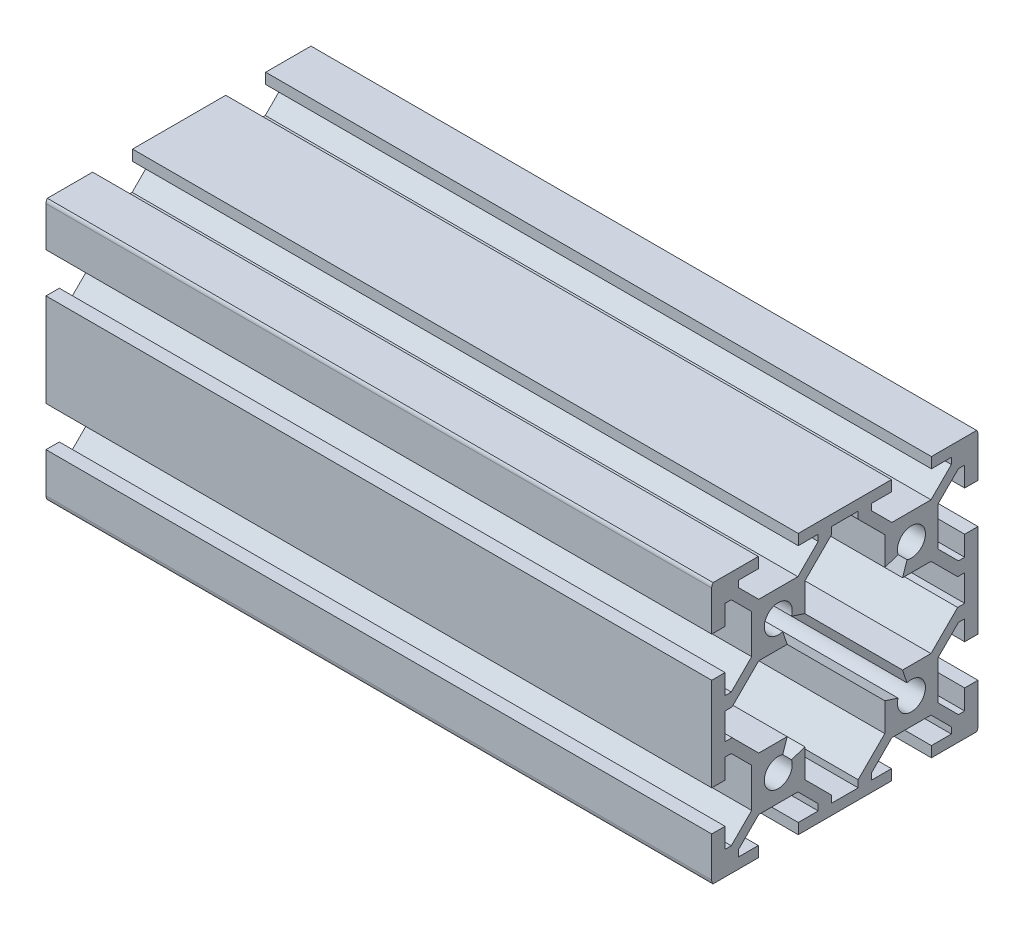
ISO-10303-21;
HEADER;
FILE_DESCRIPTION(('STEP AP214'),'2;1');
FILE_NAME('part.step','',(''),(''),'','','');
FILE_SCHEMA(('AUTOMOTIVE_DESIGN { 1 0 10303 214 1 1 1 1 }'));
ENDSEC;
DATA;
#1=APPLICATION_CONTEXT('core data for automotive mechanical design processes');
#2=APPLICATION_PROTOCOL_DEFINITION('international standard','automotive_design',2000,#1);
#3=PRODUCT_CONTEXT('',#1,'mechanical');
#4=PRODUCT('Part','Part','',(#3));
#5=PRODUCT_RELATED_PRODUCT_CATEGORY('part','',(#4));
#6=PRODUCT_DEFINITION_FORMATION('','',#4);
#7=PRODUCT_DEFINITION_CONTEXT('part definition',#1,'design');
#8=PRODUCT_DEFINITION('design','',#6,#7);
#9=PRODUCT_DEFINITION_SHAPE('','',#8);
#10=(LENGTH_UNIT() NAMED_UNIT(*) SI_UNIT(.MILLI.,.METRE.));
#11=(NAMED_UNIT(*) PLANE_ANGLE_UNIT() SI_UNIT($,.RADIAN.));
#12=(NAMED_UNIT(*) SI_UNIT($,.STERADIAN.) SOLID_ANGLE_UNIT());
#13=UNCERTAINTY_MEASURE_WITH_UNIT(LENGTH_MEASURE(1.E-05),#10,'distance_accuracy_value','');
#14=(GEOMETRIC_REPRESENTATION_CONTEXT(3) GLOBAL_UNCERTAINTY_ASSIGNED_CONTEXT((#13)) GLOBAL_UNIT_ASSIGNED_CONTEXT((#10,
#11,#12)) REPRESENTATION_CONTEXT('',''));
#15=CARTESIAN_POINT('',(0.,0.,0.));
#16=DIRECTION('',(0.,0.,1.));
#17=DIRECTION('',(1.,0.,0.));
#18=AXIS2_PLACEMENT_3D('',#15,#16,#17);
#19=CARTESIAN_POINT('',(100.,19.,19.));
#20=DIRECTION('',(1.,0.,0.));
#21=DIRECTION('',(0.,0.,-1.));
#22=AXIS2_PLACEMENT_3D('',#19,#20,#21);
#23=PLANE('',#22);
#24=CARTESIAN_POINT('',(100.,19.,19.));
#25=DIRECTION('',(1.,0.,0.));
#26=DIRECTION('',(0.,0.,-1.));
#27=AXIS2_PLACEMENT_3D('',#24,#25,#26);
#28=CIRCLE('',#27,0.999999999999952);
#29=CARTESIAN_POINT('',(100.,19.6,19.8));
#30=VERTEX_POINT('',#29);
#31=CARTESIAN_POINT('',(100.,19.,20.));
#32=VERTEX_POINT('',#31);
#33=EDGE_CURVE('E1111',#30,#32,#28,.T.);
#34=ORIENTED_EDGE('',*,*,#33,.T.);
#35=DIRECTION('',(0.,-1.,0.));
#36=VECTOR('',#35,1.);
#37=CARTESIAN_POINT('',(100.,19.,20.));
#38=LINE('',#37,#36);
#39=CARTESIAN_POINT('',(100.,13.,20.));
#40=VERTEX_POINT('',#39);
#41=EDGE_CURVE('E1114',#32,#40,#38,.T.);
#42=ORIENTED_EDGE('',*,*,#41,.T.);
#43=DIRECTION('',(0.,0.,-1.));
#44=VECTOR('',#43,1.);
#45=CARTESIAN_POINT('',(100.,13.,20.));
#46=LINE('',#45,#44);
#47=CARTESIAN_POINT('',(100.,13.,18.));
#48=VERTEX_POINT('',#47);
#49=EDGE_CURVE('E1117',#40,#48,#46,.T.);
#50=ORIENTED_EDGE('',*,*,#49,.T.);
#51=DIRECTION('',(0.,1.,0.));
#52=VECTOR('',#51,1.);
#53=CARTESIAN_POINT('',(100.,13.,18.));
#54=LINE('',#53,#52);
#55=CARTESIAN_POINT('',(100.,16.,18.));
#56=VERTEX_POINT('',#55);
#57=EDGE_CURVE('E1119',#48,#56,#54,.T.);
#58=ORIENTED_EDGE('',*,*,#57,.T.);
#59=DIRECTION('',(0.,0.,-1.));
#60=VECTOR('',#59,1.);
#61=CARTESIAN_POINT('',(100.,16.,18.));
#62=LINE('',#61,#60);
#63=CARTESIAN_POINT('',(100.,16.,17.0606601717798));
#64=VERTEX_POINT('',#63);
#65=EDGE_CURVE('E1121',#56,#64,#62,.T.);
#66=ORIENTED_EDGE('',*,*,#65,.T.);
#67=DIRECTION('',(0.,-0.707106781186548,-0.707106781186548));
#68=VECTOR('',#67,1.);
#69=CARTESIAN_POINT('',(100.,16.,17.0606601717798));
#70=LINE('',#69,#68);
#71=CARTESIAN_POINT('',(100.,12.9393398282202,14.));
#72=VERTEX_POINT('',#71);
#73=EDGE_CURVE('E1123',#64,#72,#70,.T.);
#74=ORIENTED_EDGE('',*,*,#73,.T.);
#75=DIRECTION('',(0.,-1.,0.));
#76=VECTOR('',#75,1.);
#77=CARTESIAN_POINT('',(100.,12.9393398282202,14.));
#78=LINE('',#77,#76);
#79=CARTESIAN_POINT('',(100.,7.06066017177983,14.));
#80=VERTEX_POINT('',#79);
#81=EDGE_CURVE('E1125',#72,#80,#78,.T.);
#82=ORIENTED_EDGE('',*,*,#81,.T.);
#83=DIRECTION('',(0.,-0.707106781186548,0.707106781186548));
#84=VECTOR('',#83,1.);
#85=CARTESIAN_POINT('',(100.,7.06066017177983,14.));
#86=LINE('',#85,#84);
#87=CARTESIAN_POINT('',(100.,4.,17.0606601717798));
#88=VERTEX_POINT('',#87);
#89=EDGE_CURVE('E1127',#80,#88,#86,.T.);
#90=ORIENTED_EDGE('',*,*,#89,.T.);
#91=DIRECTION('',(0.,0.,1.));
#92=VECTOR('',#91,1.);
#93=CARTESIAN_POINT('',(100.,4.,17.0606601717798));
#94=LINE('',#93,#92);
#95=CARTESIAN_POINT('',(100.,4.,18.));
#96=VERTEX_POINT('',#95);
#97=EDGE_CURVE('E1129',#88,#96,#94,.T.);
#98=ORIENTED_EDGE('',*,*,#97,.T.);
#99=DIRECTION('',(0.,1.,0.));
#100=VECTOR('',#99,1.);
#101=CARTESIAN_POINT('',(100.,4.,18.));
#102=LINE('',#101,#100);
#103=CARTESIAN_POINT('',(100.,7.,18.));
#104=VERTEX_POINT('',#103);
#105=EDGE_CURVE('E1131',#96,#104,#102,.T.);
#106=ORIENTED_EDGE('',*,*,#105,.T.);
#107=DIRECTION('',(0.,0.,1.));
#108=VECTOR('',#107,1.);
#109=CARTESIAN_POINT('',(100.,7.,18.));
#110=LINE('',#109,#108);
#111=CARTESIAN_POINT('',(100.,7.,20.));
#112=VERTEX_POINT('',#111);
#113=EDGE_CURVE('E1133',#104,#112,#110,.T.);
#114=ORIENTED_EDGE('',*,*,#113,.T.);
#115=DIRECTION('',(0.,-1.,0.));
#116=VECTOR('',#115,1.);
#117=CARTESIAN_POINT('',(100.,7.,20.));
#118=LINE('',#117,#116);
#119=CARTESIAN_POINT('',(100.,-6.99999999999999,20.));
#120=VERTEX_POINT('',#119);
#121=EDGE_CURVE('E1135',#112,#120,#118,.T.);
#122=ORIENTED_EDGE('',*,*,#121,.T.);
#123=DIRECTION('',(0.,0.,-1.));
#124=VECTOR('',#123,1.);
#125=CARTESIAN_POINT('',(100.,-6.99999999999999,20.));
#126=LINE('',#125,#124);
#127=CARTESIAN_POINT('',(100.,-6.99999999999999,18.));
#128=VERTEX_POINT('',#127);
#129=EDGE_CURVE('E1137',#120,#128,#126,.T.);
#130=ORIENTED_EDGE('',*,*,#129,.T.);
#131=DIRECTION('',(0.,1.,0.));
#132=VECTOR('',#131,1.);
#133=CARTESIAN_POINT('',(100.,-6.99999999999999,18.));
#134=LINE('',#133,#132);
#135=CARTESIAN_POINT('',(100.,-4.,18.));
#136=VERTEX_POINT('',#135);
#137=EDGE_CURVE('E1139',#128,#136,#134,.T.);
#138=ORIENTED_EDGE('',*,*,#137,.T.);
#139=DIRECTION('',(0.,0.,-1.));
#140=VECTOR('',#139,1.);
#141=CARTESIAN_POINT('',(100.,-4.,18.));
#142=LINE('',#141,#140);
#143=CARTESIAN_POINT('',(100.,-4.,17.0606601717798));
#144=VERTEX_POINT('',#143);
#145=EDGE_CURVE('E1141',#136,#144,#142,.T.);
#146=ORIENTED_EDGE('',*,*,#145,.T.);
#147=DIRECTION('',(0.,-0.707106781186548,-0.707106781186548));
#148=VECTOR('',#147,1.);
#149=CARTESIAN_POINT('',(100.,-4.,17.0606601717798));
#150=LINE('',#149,#148);
#151=CARTESIAN_POINT('',(100.,-7.06066017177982,14.));
#152=VERTEX_POINT('',#151);
#153=EDGE_CURVE('E1143',#144,#152,#150,.T.);
#154=ORIENTED_EDGE('',*,*,#153,.T.);
#155=DIRECTION('',(0.,-1.,0.));
#156=VECTOR('',#155,1.);
#157=CARTESIAN_POINT('',(100.,-7.06066017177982,14.));
#158=LINE('',#157,#156);
#159=CARTESIAN_POINT('',(100.,-12.9393398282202,14.));
#160=VERTEX_POINT('',#159);
#161=EDGE_CURVE('E1145',#152,#160,#158,.T.);
#162=ORIENTED_EDGE('',*,*,#161,.T.);
#163=DIRECTION('',(0.,-0.707106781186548,0.707106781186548));
#164=VECTOR('',#163,1.);
#165=CARTESIAN_POINT('',(100.,-12.9393398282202,14.));
#166=LINE('',#165,#164);
#167=CARTESIAN_POINT('',(100.,-16.,17.0606601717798));
#168=VERTEX_POINT('',#167);
#169=EDGE_CURVE('E1147',#160,#168,#166,.T.);
#170=ORIENTED_EDGE('',*,*,#169,.T.);
#171=DIRECTION('',(0.,0.,1.));
#172=VECTOR('',#171,1.);
#173=CARTESIAN_POINT('',(100.,-16.,17.0606601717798));
#174=LINE('',#173,#172);
#175=CARTESIAN_POINT('',(100.,-16.,18.));
#176=VERTEX_POINT('',#175);
#177=EDGE_CURVE('E1149',#168,#176,#174,.T.);
#178=ORIENTED_EDGE('',*,*,#177,.T.);
#179=DIRECTION('',(0.,1.,0.));
#180=VECTOR('',#179,1.);
#181=CARTESIAN_POINT('',(100.,-16.,18.));
#182=LINE('',#181,#180);
#183=CARTESIAN_POINT('',(100.,-13.,18.));
#184=VERTEX_POINT('',#183);
#185=EDGE_CURVE('E1151',#176,#184,#182,.T.);
#186=ORIENTED_EDGE('',*,*,#185,.T.);
#187=DIRECTION('',(0.,0.,1.));
#188=VECTOR('',#187,1.);
#189=CARTESIAN_POINT('',(100.,-13.,18.));
#190=LINE('',#189,#188);
#191=CARTESIAN_POINT('',(100.,-13.,20.));
#192=VERTEX_POINT('',#191);
#193=EDGE_CURVE('E1153',#184,#192,#190,.T.);
#194=ORIENTED_EDGE('',*,*,#193,.T.);
#195=DIRECTION('',(0.,-1.,0.));
#196=VECTOR('',#195,1.);
#197=CARTESIAN_POINT('',(100.,-13.,20.));
#198=LINE('',#197,#196);
#199=CARTESIAN_POINT('',(100.,-19.,20.));
#200=VERTEX_POINT('',#199);
#201=EDGE_CURVE('E1155',#192,#200,#198,.T.);
#202=ORIENTED_EDGE('',*,*,#201,.T.);
#203=CARTESIAN_POINT('',(100.,-19.,19.));
#204=DIRECTION('',(1.,0.,0.));
#205=DIRECTION('',(0.,0.,-1.));
#206=AXIS2_PLACEMENT_3D('',#203,#204,#205);
#207=CIRCLE('',#206,0.999999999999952);
#208=CARTESIAN_POINT('',(100.,-19.6,19.8));
#209=VERTEX_POINT('',#208);
#210=EDGE_CURVE('E1157',#200,#209,#207,.T.);
#211=ORIENTED_EDGE('',*,*,#210,.T.);
#212=DIRECTION('',(0.,0.,-1.));
#213=VECTOR('',#212,1.);
#214=CARTESIAN_POINT('',(100.,-19.6,19.8));
#215=LINE('',#214,#213);
#216=CARTESIAN_POINT('',(100.,-19.6,13.));
#217=VERTEX_POINT('',#216);
#218=EDGE_CURVE('E1159',#209,#217,#215,.T.);
#219=ORIENTED_EDGE('',*,*,#218,.T.);
#220=DIRECTION('',(0.,1.,0.));
#221=VECTOR('',#220,1.);
#222=CARTESIAN_POINT('',(100.,-19.6,13.));
#223=LINE('',#222,#221);
#224=CARTESIAN_POINT('',(100.,-18.,13.));
#225=VERTEX_POINT('',#224);
#226=EDGE_CURVE('E1161',#217,#225,#223,.T.);
#227=ORIENTED_EDGE('',*,*,#226,.T.);
#228=DIRECTION('',(0.,0.,1.));
#229=VECTOR('',#228,1.);
#230=CARTESIAN_POINT('',(100.,-18.,13.));
#231=LINE('',#230,#229);
#232=CARTESIAN_POINT('',(100.,-18.,16.));
#233=VERTEX_POINT('',#232);
#234=EDGE_CURVE('E1163',#225,#233,#231,.T.);
#235=ORIENTED_EDGE('',*,*,#234,.T.);
#236=DIRECTION('',(0.,1.,0.));
#237=VECTOR('',#236,1.);
#238=CARTESIAN_POINT('',(100.,-18.,16.));
#239=LINE('',#238,#237);
#240=CARTESIAN_POINT('',(100.,-17.0606601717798,16.));
#241=VERTEX_POINT('',#240);
#242=EDGE_CURVE('E1165',#233,#241,#239,.T.);
#243=ORIENTED_EDGE('',*,*,#242,.T.);
#244=DIRECTION('',(0.,0.707106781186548,-0.707106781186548));
#245=VECTOR('',#244,1.);
#246=CARTESIAN_POINT('',(100.,-17.0606601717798,16.));
#247=LINE('',#246,#245);
#248=CARTESIAN_POINT('',(100.,-14.,12.9393398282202));
#249=VERTEX_POINT('',#248);
#250=EDGE_CURVE('E1167',#241,#249,#247,.T.);
#251=ORIENTED_EDGE('',*,*,#250,.T.);
#252=DIRECTION('',(0.,0.,-1.));
#253=VECTOR('',#252,1.);
#254=CARTESIAN_POINT('',(100.,-14.,12.9393398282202));
#255=LINE('',#254,#253);
#256=CARTESIAN_POINT('',(100.,-14.,7.06066017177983));
#257=VERTEX_POINT('',#256);
#258=EDGE_CURVE('E1169',#249,#257,#255,.T.);
#259=ORIENTED_EDGE('',*,*,#258,.T.);
#260=DIRECTION('',(0.,-0.707106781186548,-0.707106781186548));
#261=VECTOR('',#260,1.);
#262=CARTESIAN_POINT('',(100.,-14.,7.06066017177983));
#263=LINE('',#262,#261);
#264=CARTESIAN_POINT('',(100.,-17.0606601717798,4.));
#265=VERTEX_POINT('',#264);
#266=EDGE_CURVE('E1171',#257,#265,#263,.T.);
#267=ORIENTED_EDGE('',*,*,#266,.T.);
#268=DIRECTION('',(0.,-1.,0.));
#269=VECTOR('',#268,1.);
#270=CARTESIAN_POINT('',(100.,-17.0606601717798,4.));
#271=LINE('',#270,#269);
#272=CARTESIAN_POINT('',(100.,-18.,4.));
#273=VERTEX_POINT('',#272);
#274=EDGE_CURVE('E1173',#265,#273,#271,.T.);
#275=ORIENTED_EDGE('',*,*,#274,.T.);
#276=DIRECTION('',(0.,0.,1.));
#277=VECTOR('',#276,1.);
#278=CARTESIAN_POINT('',(100.,-18.,4.));
#279=LINE('',#278,#277);
#280=CARTESIAN_POINT('',(100.,-18.,7.));
#281=VERTEX_POINT('',#280);
#282=EDGE_CURVE('E1175',#273,#281,#279,.T.);
#283=ORIENTED_EDGE('',*,*,#282,.T.);
#284=DIRECTION('',(0.,-1.,0.));
#285=VECTOR('',#284,1.);
#286=CARTESIAN_POINT('',(100.,-18.,7.));
#287=LINE('',#286,#285);
#288=CARTESIAN_POINT('',(100.,-19.6,7.));
#289=VERTEX_POINT('',#288);
#290=EDGE_CURVE('E1177',#281,#289,#287,.T.);
#291=ORIENTED_EDGE('',*,*,#290,.T.);
#292=DIRECTION('',(0.,0.,-1.));
#293=VECTOR('',#292,1.);
#294=CARTESIAN_POINT('',(100.,-19.6,7.));
#295=LINE('',#294,#293);
#296=CARTESIAN_POINT('',(100.,-19.6,-7.));
#297=VERTEX_POINT('',#296);
#298=EDGE_CURVE('E1179',#289,#297,#295,.T.);
#299=ORIENTED_EDGE('',*,*,#298,.T.);
#300=DIRECTION('',(0.,1.,0.));
#301=VECTOR('',#300,1.);
#302=CARTESIAN_POINT('',(100.,-19.6,-7.));
#303=LINE('',#302,#301);
#304=CARTESIAN_POINT('',(100.,-18.,-7.));
#305=VERTEX_POINT('',#304);
#306=EDGE_CURVE('E1181',#297,#305,#303,.T.);
#307=ORIENTED_EDGE('',*,*,#306,.T.);
#308=DIRECTION('',(0.,0.,1.));
#309=VECTOR('',#308,1.);
#310=CARTESIAN_POINT('',(100.,-18.,-7.));
#311=LINE('',#310,#309);
#312=CARTESIAN_POINT('',(100.,-18.,-4.));
#313=VERTEX_POINT('',#312);
#314=EDGE_CURVE('E1183',#305,#313,#311,.T.);
#315=ORIENTED_EDGE('',*,*,#314,.T.);
#316=DIRECTION('',(0.,1.,0.));
#317=VECTOR('',#316,1.);
#318=CARTESIAN_POINT('',(100.,-18.,-4.));
#319=LINE('',#318,#317);
#320=CARTESIAN_POINT('',(100.,-17.0606601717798,-4.));
#321=VERTEX_POINT('',#320);
#322=EDGE_CURVE('E1185',#313,#321,#319,.T.);
#323=ORIENTED_EDGE('',*,*,#322,.T.);
#324=DIRECTION('',(0.,0.707106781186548,-0.707106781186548));
#325=VECTOR('',#324,1.);
#326=CARTESIAN_POINT('',(100.,-17.0606601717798,-4.));
#327=LINE('',#326,#325);
#328=CARTESIAN_POINT('',(100.,-14.,-7.06066017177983));
#329=VERTEX_POINT('',#328);
#330=EDGE_CURVE('E1187',#321,#329,#327,.T.);
#331=ORIENTED_EDGE('',*,*,#330,.T.);
#332=DIRECTION('',(0.,0.,-1.));
#333=VECTOR('',#332,1.);
#334=CARTESIAN_POINT('',(100.,-14.,-7.06066017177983));
#335=LINE('',#334,#333);
#336=CARTESIAN_POINT('',(100.,-14.,-12.9393398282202));
#337=VERTEX_POINT('',#336);
#338=EDGE_CURVE('E1189',#329,#337,#335,.T.);
#339=ORIENTED_EDGE('',*,*,#338,.T.);
#340=DIRECTION('',(0.,-0.707106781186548,-0.707106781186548));
#341=VECTOR('',#340,1.);
#342=CARTESIAN_POINT('',(100.,-14.,-12.9393398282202));
#343=LINE('',#342,#341);
#344=CARTESIAN_POINT('',(100.,-17.0606601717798,-16.));
#345=VERTEX_POINT('',#344);
#346=EDGE_CURVE('E1191',#337,#345,#343,.T.);
#347=ORIENTED_EDGE('',*,*,#346,.T.);
#348=DIRECTION('',(0.,-1.,0.));
#349=VECTOR('',#348,1.);
#350=CARTESIAN_POINT('',(100.,-17.0606601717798,-16.));
#351=LINE('',#350,#349);
#352=CARTESIAN_POINT('',(100.,-18.,-16.));
#353=VERTEX_POINT('',#352);
#354=EDGE_CURVE('E1193',#345,#353,#351,.T.);
#355=ORIENTED_EDGE('',*,*,#354,.T.);
#356=DIRECTION('',(0.,0.,1.));
#357=VECTOR('',#356,1.);
#358=CARTESIAN_POINT('',(100.,-18.,-16.));
#359=LINE('',#358,#357);
#360=CARTESIAN_POINT('',(100.,-18.,-13.));
#361=VERTEX_POINT('',#360);
#362=EDGE_CURVE('E1195',#353,#361,#359,.T.);
#363=ORIENTED_EDGE('',*,*,#362,.T.);
#364=DIRECTION('',(0.,-1.,0.));
#365=VECTOR('',#364,1.);
#366=CARTESIAN_POINT('',(100.,-18.,-13.));
#367=LINE('',#366,#365);
#368=CARTESIAN_POINT('',(100.,-19.6,-13.));
#369=VERTEX_POINT('',#368);
#370=EDGE_CURVE('E1197',#361,#369,#367,.T.);
#371=ORIENTED_EDGE('',*,*,#370,.T.);
#372=DIRECTION('',(0.,0.,-1.));
#373=VECTOR('',#372,1.);
#374=CARTESIAN_POINT('',(100.,-19.6,-13.));
#375=LINE('',#374,#373);
#376=CARTESIAN_POINT('',(100.,-19.6,-19.8));
#377=VERTEX_POINT('',#376);
#378=EDGE_CURVE('E1199',#369,#377,#375,.T.);
#379=ORIENTED_EDGE('',*,*,#378,.T.);
#380=CARTESIAN_POINT('',(100.,-19.,-19.));
#381=DIRECTION('',(1.,0.,0.));
#382=DIRECTION('',(0.,0.,-1.));
#383=AXIS2_PLACEMENT_3D('',#380,#381,#382);
#384=CIRCLE('',#383,0.999999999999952);
#385=CARTESIAN_POINT('',(100.,-19.,-20.));
#386=VERTEX_POINT('',#385);
#387=EDGE_CURVE('E1201',#377,#386,#384,.T.);
#388=ORIENTED_EDGE('',*,*,#387,.T.);
#389=DIRECTION('',(0.,1.,0.));
#390=VECTOR('',#389,1.);
#391=CARTESIAN_POINT('',(100.,-19.,-20.));
#392=LINE('',#391,#390);
#393=CARTESIAN_POINT('',(100.,-13.,-20.));
#394=VERTEX_POINT('',#393);
#395=EDGE_CURVE('E1203',#386,#394,#392,.T.);
#396=ORIENTED_EDGE('',*,*,#395,.T.);
#397=DIRECTION('',(0.,0.,1.));
#398=VECTOR('',#397,1.);
#399=CARTESIAN_POINT('',(100.,-13.,-20.));
#400=LINE('',#399,#398);
#401=CARTESIAN_POINT('',(100.,-13.,-18.));
#402=VERTEX_POINT('',#401);
#403=EDGE_CURVE('E1205',#394,#402,#400,.T.);
#404=ORIENTED_EDGE('',*,*,#403,.T.);
#405=DIRECTION('',(0.,-1.,0.));
#406=VECTOR('',#405,1.);
#407=CARTESIAN_POINT('',(100.,-13.,-18.));
#408=LINE('',#407,#406);
#409=CARTESIAN_POINT('',(100.,-16.,-18.));
#410=VERTEX_POINT('',#409);
#411=EDGE_CURVE('E1207',#402,#410,#408,.T.);
#412=ORIENTED_EDGE('',*,*,#411,.T.);
#413=DIRECTION('',(0.,0.,1.));
#414=VECTOR('',#413,1.);
#415=CARTESIAN_POINT('',(100.,-16.,-18.));
#416=LINE('',#415,#414);
#417=CARTESIAN_POINT('',(100.,-16.,-17.0606601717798));
#418=VERTEX_POINT('',#417);
#419=EDGE_CURVE('E1209',#410,#418,#416,.T.);
#420=ORIENTED_EDGE('',*,*,#419,.T.);
#421=DIRECTION('',(0.,0.707106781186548,0.707106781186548));
#422=VECTOR('',#421,1.);
#423=CARTESIAN_POINT('',(100.,-16.,-17.0606601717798));
#424=LINE('',#423,#422);
#425=CARTESIAN_POINT('',(100.,-12.9393398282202,-14.));
#426=VERTEX_POINT('',#425);
#427=EDGE_CURVE('E1211',#418,#426,#424,.T.);
#428=ORIENTED_EDGE('',*,*,#427,.T.);
#429=DIRECTION('',(0.,1.,0.));
#430=VECTOR('',#429,1.);
#431=CARTESIAN_POINT('',(100.,-12.9393398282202,-14.));
#432=LINE('',#431,#430);
#433=CARTESIAN_POINT('',(100.,-7.06066017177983,-14.));
#434=VERTEX_POINT('',#433);
#435=EDGE_CURVE('E1213',#426,#434,#432,.T.);
#436=ORIENTED_EDGE('',*,*,#435,.T.);
#437=DIRECTION('',(0.,0.707106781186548,-0.707106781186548));
#438=VECTOR('',#437,1.);
#439=CARTESIAN_POINT('',(100.,-7.06066017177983,-14.));
#440=LINE('',#439,#438);
#441=CARTESIAN_POINT('',(100.,-4.,-17.0606601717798));
#442=VERTEX_POINT('',#441);
#443=EDGE_CURVE('E1215',#434,#442,#440,.T.);
#444=ORIENTED_EDGE('',*,*,#443,.T.);
#445=DIRECTION('',(0.,0.,-1.));
#446=VECTOR('',#445,1.);
#447=CARTESIAN_POINT('',(100.,-4.,-17.0606601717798));
#448=LINE('',#447,#446);
#449=CARTESIAN_POINT('',(100.,-4.,-18.));
#450=VERTEX_POINT('',#449);
#451=EDGE_CURVE('E1217',#442,#450,#448,.T.);
#452=ORIENTED_EDGE('',*,*,#451,.T.);
#453=DIRECTION('',(0.,-1.,0.));
#454=VECTOR('',#453,1.);
#455=CARTESIAN_POINT('',(100.,-4.,-18.));
#456=LINE('',#455,#454);
#457=CARTESIAN_POINT('',(100.,-7.,-18.));
#458=VERTEX_POINT('',#457);
#459=EDGE_CURVE('E1219',#450,#458,#456,.T.);
#460=ORIENTED_EDGE('',*,*,#459,.T.);
#461=DIRECTION('',(0.,0.,-1.));
#462=VECTOR('',#461,1.);
#463=CARTESIAN_POINT('',(100.,-7.,-18.));
#464=LINE('',#463,#462);
#465=CARTESIAN_POINT('',(100.,-7.,-20.));
#466=VERTEX_POINT('',#465);
#467=EDGE_CURVE('E1221',#458,#466,#464,.T.);
#468=ORIENTED_EDGE('',*,*,#467,.T.);
#469=DIRECTION('',(0.,1.,0.));
#470=VECTOR('',#469,1.);
#471=CARTESIAN_POINT('',(100.,-7.,-20.));
#472=LINE('',#471,#470);
#473=CARTESIAN_POINT('',(100.,7.00000000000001,-20.));
#474=VERTEX_POINT('',#473);
#475=EDGE_CURVE('E1223',#466,#474,#472,.T.);
#476=ORIENTED_EDGE('',*,*,#475,.T.);
#477=DIRECTION('',(0.,0.,1.));
#478=VECTOR('',#477,1.);
#479=CARTESIAN_POINT('',(100.,7.00000000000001,-20.));
#480=LINE('',#479,#478);
#481=CARTESIAN_POINT('',(100.,7.00000000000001,-18.));
#482=VERTEX_POINT('',#481);
#483=EDGE_CURVE('E1225',#474,#482,#480,.T.);
#484=ORIENTED_EDGE('',*,*,#483,.T.);
#485=DIRECTION('',(0.,-1.,0.));
#486=VECTOR('',#485,1.);
#487=CARTESIAN_POINT('',(100.,7.00000000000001,-18.));
#488=LINE('',#487,#486);
#489=CARTESIAN_POINT('',(100.,4.,-18.));
#490=VERTEX_POINT('',#489);
#491=EDGE_CURVE('E1227',#482,#490,#488,.T.);
#492=ORIENTED_EDGE('',*,*,#491,.T.);
#493=DIRECTION('',(0.,0.,1.));
#494=VECTOR('',#493,1.);
#495=CARTESIAN_POINT('',(100.,4.,-18.));
#496=LINE('',#495,#494);
#497=CARTESIAN_POINT('',(100.,4.,-17.0606601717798));
#498=VERTEX_POINT('',#497);
#499=EDGE_CURVE('E1229',#490,#498,#496,.T.);
#500=ORIENTED_EDGE('',*,*,#499,.T.);
#501=DIRECTION('',(0.,0.707106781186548,0.707106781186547));
#502=VECTOR('',#501,1.);
#503=CARTESIAN_POINT('',(100.,4.,-17.0606601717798));
#504=LINE('',#503,#502);
#505=CARTESIAN_POINT('',(100.,7.06066017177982,-14.));
#506=VERTEX_POINT('',#505);
#507=EDGE_CURVE('E1231',#498,#506,#504,.T.);
#508=ORIENTED_EDGE('',*,*,#507,.T.);
#509=DIRECTION('',(0.,1.,0.));
#510=VECTOR('',#509,1.);
#511=CARTESIAN_POINT('',(100.,7.06066017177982,-14.));
#512=LINE('',#511,#510);
#513=CARTESIAN_POINT('',(100.,12.9393398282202,-14.));
#514=VERTEX_POINT('',#513);
#515=EDGE_CURVE('E1233',#506,#514,#512,.T.);
#516=ORIENTED_EDGE('',*,*,#515,.T.);
#517=DIRECTION('',(0.,0.707106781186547,-0.707106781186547));
#518=VECTOR('',#517,1.);
#519=CARTESIAN_POINT('',(100.,12.9393398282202,-14.));
#520=LINE('',#519,#518);
#521=CARTESIAN_POINT('',(100.,16.,-17.0606601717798));
#522=VERTEX_POINT('',#521);
#523=EDGE_CURVE('E1235',#514,#522,#520,.T.);
#524=ORIENTED_EDGE('',*,*,#523,.T.);
#525=DIRECTION('',(0.,0.,-1.));
#526=VECTOR('',#525,1.);
#527=CARTESIAN_POINT('',(100.,16.,-17.0606601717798));
#528=LINE('',#527,#526);
#529=CARTESIAN_POINT('',(100.,16.,-18.));
#530=VERTEX_POINT('',#529);
#531=EDGE_CURVE('E1237',#522,#530,#528,.T.);
#532=ORIENTED_EDGE('',*,*,#531,.T.);
#533=DIRECTION('',(0.,-1.,0.));
#534=VECTOR('',#533,1.);
#535=CARTESIAN_POINT('',(100.,16.,-18.));
#536=LINE('',#535,#534);
#537=CARTESIAN_POINT('',(100.,13.,-18.));
#538=VERTEX_POINT('',#537);
#539=EDGE_CURVE('E1239',#530,#538,#536,.T.);
#540=ORIENTED_EDGE('',*,*,#539,.T.);
#541=DIRECTION('',(0.,0.,-1.));
#542=VECTOR('',#541,1.);
#543=CARTESIAN_POINT('',(100.,13.,-18.));
#544=LINE('',#543,#542);
#545=CARTESIAN_POINT('',(100.,13.,-20.));
#546=VERTEX_POINT('',#545);
#547=EDGE_CURVE('E1241',#538,#546,#544,.T.);
#548=ORIENTED_EDGE('',*,*,#547,.T.);
#549=DIRECTION('',(0.,1.,0.));
#550=VECTOR('',#549,1.);
#551=CARTESIAN_POINT('',(100.,13.,-20.));
#552=LINE('',#551,#550);
#553=CARTESIAN_POINT('',(100.,19.,-20.));
#554=VERTEX_POINT('',#553);
#555=EDGE_CURVE('E1243',#546,#554,#552,.T.);
#556=ORIENTED_EDGE('',*,*,#555,.T.);
#557=CARTESIAN_POINT('',(100.,19.,-19.));
#558=DIRECTION('',(1.,0.,0.));
#559=DIRECTION('',(0.,0.,-1.));
#560=AXIS2_PLACEMENT_3D('',#557,#558,#559);
#561=CIRCLE('',#560,0.999999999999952);
#562=CARTESIAN_POINT('',(100.,19.6,-19.8));
#563=VERTEX_POINT('',#562);
#564=EDGE_CURVE('E1245',#554,#563,#561,.T.);
#565=ORIENTED_EDGE('',*,*,#564,.T.);
#566=DIRECTION('',(0.,0.,1.));
#567=VECTOR('',#566,1.);
#568=CARTESIAN_POINT('',(100.,19.6,-19.8));
#569=LINE('',#568,#567);
#570=CARTESIAN_POINT('',(100.,19.6,-13.));
#571=VERTEX_POINT('',#570);
#572=EDGE_CURVE('E1247',#563,#571,#569,.T.);
#573=ORIENTED_EDGE('',*,*,#572,.T.);
#574=DIRECTION('',(0.,-1.,0.));
#575=VECTOR('',#574,1.);
#576=CARTESIAN_POINT('',(100.,19.6,-13.));
#577=LINE('',#576,#575);
#578=CARTESIAN_POINT('',(100.,18.,-13.));
#579=VERTEX_POINT('',#578);
#580=EDGE_CURVE('E1249',#571,#579,#577,.T.);
#581=ORIENTED_EDGE('',*,*,#580,.T.);
#582=DIRECTION('',(0.,0.,-1.));
#583=VECTOR('',#582,1.);
#584=CARTESIAN_POINT('',(100.,18.,-13.));
#585=LINE('',#584,#583);
#586=CARTESIAN_POINT('',(100.,18.,-16.));
#587=VERTEX_POINT('',#586);
#588=EDGE_CURVE('E1251',#579,#587,#585,.T.);
#589=ORIENTED_EDGE('',*,*,#588,.T.);
#590=DIRECTION('',(0.,-1.,0.));
#591=VECTOR('',#590,1.);
#592=CARTESIAN_POINT('',(100.,18.,-16.));
#593=LINE('',#592,#591);
#594=CARTESIAN_POINT('',(100.,17.0606601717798,-16.));
#595=VERTEX_POINT('',#594);
#596=EDGE_CURVE('E1253',#587,#595,#593,.T.);
#597=ORIENTED_EDGE('',*,*,#596,.T.);
#598=DIRECTION('',(0.,-0.707106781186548,0.707106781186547));
#599=VECTOR('',#598,1.);
#600=CARTESIAN_POINT('',(100.,17.0606601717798,-16.));
#601=LINE('',#600,#599);
#602=CARTESIAN_POINT('',(100.,14.,-12.9393398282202));
#603=VERTEX_POINT('',#602);
#604=EDGE_CURVE('E1255',#595,#603,#601,.T.);
#605=ORIENTED_EDGE('',*,*,#604,.T.);
#606=DIRECTION('',(0.,0.,1.));
#607=VECTOR('',#606,1.);
#608=CARTESIAN_POINT('',(100.,14.,-12.9393398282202));
#609=LINE('',#608,#607);
#610=CARTESIAN_POINT('',(100.,14.,-7.06066017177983));
#611=VERTEX_POINT('',#610);
#612=EDGE_CURVE('E1257',#603,#611,#609,.T.);
#613=ORIENTED_EDGE('',*,*,#612,.T.);
#614=DIRECTION('',(0.,0.707106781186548,0.707106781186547));
#615=VECTOR('',#614,1.);
#616=CARTESIAN_POINT('',(100.,14.,-7.06066017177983));
#617=LINE('',#616,#615);
#618=CARTESIAN_POINT('',(100.,17.0606601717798,-4.));
#619=VERTEX_POINT('',#618);
#620=EDGE_CURVE('E1259',#611,#619,#617,.T.);
#621=ORIENTED_EDGE('',*,*,#620,.T.);
#622=DIRECTION('',(0.,1.,0.));
#623=VECTOR('',#622,1.);
#624=CARTESIAN_POINT('',(100.,17.0606601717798,-4.));
#625=LINE('',#624,#623);
#626=CARTESIAN_POINT('',(100.,18.,-4.));
#627=VERTEX_POINT('',#626);
#628=EDGE_CURVE('E1261',#619,#627,#625,.T.);
#629=ORIENTED_EDGE('',*,*,#628,.T.);
#630=DIRECTION('',(0.,0.,-1.));
#631=VECTOR('',#630,1.);
#632=CARTESIAN_POINT('',(100.,18.,-4.));
#633=LINE('',#632,#631);
#634=CARTESIAN_POINT('',(100.,18.,-7.));
#635=VERTEX_POINT('',#634);
#636=EDGE_CURVE('E1263',#627,#635,#633,.T.);
#637=ORIENTED_EDGE('',*,*,#636,.T.);
#638=DIRECTION('',(0.,1.,0.));
#639=VECTOR('',#638,1.);
#640=CARTESIAN_POINT('',(100.,18.,-7.));
#641=LINE('',#640,#639);
#642=CARTESIAN_POINT('',(100.,19.6,-7.));
#643=VERTEX_POINT('',#642);
#644=EDGE_CURVE('E1265',#635,#643,#641,.T.);
#645=ORIENTED_EDGE('',*,*,#644,.T.);
#646=DIRECTION('',(0.,0.,1.));
#647=VECTOR('',#646,1.);
#648=CARTESIAN_POINT('',(100.,19.6,-7.));
#649=LINE('',#648,#647);
#650=CARTESIAN_POINT('',(100.,19.6,7.));
#651=VERTEX_POINT('',#650);
#652=EDGE_CURVE('E1267',#643,#651,#649,.T.);
#653=ORIENTED_EDGE('',*,*,#652,.T.);
#654=DIRECTION('',(0.,-1.,0.));
#655=VECTOR('',#654,1.);
#656=CARTESIAN_POINT('',(100.,19.6,7.));
#657=LINE('',#656,#655);
#658=CARTESIAN_POINT('',(100.,18.,7.));
#659=VERTEX_POINT('',#658);
#660=EDGE_CURVE('E1269',#651,#659,#657,.T.);
#661=ORIENTED_EDGE('',*,*,#660,.T.);
#662=DIRECTION('',(0.,0.,-1.));
#663=VECTOR('',#662,1.);
#664=CARTESIAN_POINT('',(100.,18.,7.));
#665=LINE('',#664,#663);
#666=CARTESIAN_POINT('',(100.,18.,4.));
#667=VERTEX_POINT('',#666);
#668=EDGE_CURVE('E1271',#659,#667,#665,.T.);
#669=ORIENTED_EDGE('',*,*,#668,.T.);
#670=DIRECTION('',(0.,-1.,0.));
#671=VECTOR('',#670,1.);
#672=CARTESIAN_POINT('',(100.,18.,4.));
#673=LINE('',#672,#671);
#674=CARTESIAN_POINT('',(100.,17.0606601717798,4.));
#675=VERTEX_POINT('',#674);
#676=EDGE_CURVE('E1273',#667,#675,#673,.T.);
#677=ORIENTED_EDGE('',*,*,#676,.T.);
#678=DIRECTION('',(0.,-0.707106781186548,0.707106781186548));
#679=VECTOR('',#678,1.);
#680=CARTESIAN_POINT('',(100.,17.0606601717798,4.));
#681=LINE('',#680,#679);
#682=CARTESIAN_POINT('',(100.,14.,7.06066017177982));
#683=VERTEX_POINT('',#682);
#684=EDGE_CURVE('E1275',#675,#683,#681,.T.);
#685=ORIENTED_EDGE('',*,*,#684,.T.);
#686=DIRECTION('',(0.,0.,1.));
#687=VECTOR('',#686,1.);
#688=CARTESIAN_POINT('',(100.,14.,7.06066017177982));
#689=LINE('',#688,#687);
#690=CARTESIAN_POINT('',(100.,14.,12.9393398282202));
#691=VERTEX_POINT('',#690);
#692=EDGE_CURVE('E1277',#683,#691,#689,.T.);
#693=ORIENTED_EDGE('',*,*,#692,.T.);
#694=DIRECTION('',(0.,0.707106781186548,0.707106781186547));
#695=VECTOR('',#694,1.);
#696=CARTESIAN_POINT('',(100.,14.,12.9393398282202));
#697=LINE('',#696,#695);
#698=CARTESIAN_POINT('',(100.,17.0606601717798,16.));
#699=VERTEX_POINT('',#698);
#700=EDGE_CURVE('E1279',#691,#699,#697,.T.);
#701=ORIENTED_EDGE('',*,*,#700,.T.);
#702=DIRECTION('',(0.,1.,0.));
#703=VECTOR('',#702,1.);
#704=CARTESIAN_POINT('',(100.,17.0606601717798,16.));
#705=LINE('',#704,#703);
#706=CARTESIAN_POINT('',(100.,18.,16.));
#707=VERTEX_POINT('',#706);
#708=EDGE_CURVE('E1281',#699,#707,#705,.T.);
#709=ORIENTED_EDGE('',*,*,#708,.T.);
#710=DIRECTION('',(0.,0.,-1.));
#711=VECTOR('',#710,1.);
#712=CARTESIAN_POINT('',(100.,18.,16.));
#713=LINE('',#712,#711);
#714=CARTESIAN_POINT('',(100.,18.,13.));
#715=VERTEX_POINT('',#714);
#716=EDGE_CURVE('E1283',#707,#715,#713,.T.);
#717=ORIENTED_EDGE('',*,*,#716,.T.);
#718=DIRECTION('',(0.,1.,0.));
#719=VECTOR('',#718,1.);
#720=CARTESIAN_POINT('',(100.,18.,13.));
#721=LINE('',#720,#719);
#722=CARTESIAN_POINT('',(100.,19.6,13.));
#723=VERTEX_POINT('',#722);
#724=EDGE_CURVE('E1285',#715,#723,#721,.T.);
#725=ORIENTED_EDGE('',*,*,#724,.T.);
#726=DIRECTION('',(0.,0.,1.));
#727=VECTOR('',#726,1.);
#728=CARTESIAN_POINT('',(100.,19.6,13.));
#729=LINE('',#728,#727);
#730=EDGE_CURVE('E1287',#723,#30,#729,.T.);
#731=ORIENTED_EDGE('',*,*,#730,.T.);
#732=EDGE_LOOP('',(#34,#42,#50,#58,#66,#74,#82,#90,#98,#106,#114,#122,#130,#138,#146,#154,#162,
#170,#178,#186,#194,#202,#211,#219,#227,#235,#243,#251,#259,#267,#275,#283,#291,#299,#307,#315,
#323,#331,#339,#347,#355,#363,#371,#379,#388,#396,#404,#412,#420,#428,#436,#444,#452,#460,#468,
#476,#484,#492,#500,#508,#516,#524,#532,#540,#548,#556,#565,#573,#581,#589,#597,#605,#613,#621,
#629,#637,#645,#653,#661,#669,#677,#685,#693,#701,#709,#717,#725,#731));
#733=FACE_BOUND('',#732,.T.);
#734=DIRECTION('',(0.,0.,-1.));
#735=VECTOR('',#734,1.);
#736=CARTESIAN_POINT('',(100.,-2.,18.));
#737=LINE('',#736,#735);
#738=CARTESIAN_POINT('',(100.,-2.,18.));
#739=VERTEX_POINT('',#738);
#740=CARTESIAN_POINT('',(100.,-2.,16.9393398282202));
#741=VERTEX_POINT('',#740);
#742=EDGE_CURVE('E830',#739,#741,#737,.T.);
#743=ORIENTED_EDGE('',*,*,#742,.F.);
#744=DIRECTION('',(0.,-1.,0.));
#745=VECTOR('',#744,1.);
#746=CARTESIAN_POINT('',(100.,2.00000000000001,18.));
#747=LINE('',#746,#745);
#748=CARTESIAN_POINT('',(100.,2.00000000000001,18.));
#749=VERTEX_POINT('',#748);
#750=EDGE_CURVE('E822',#749,#739,#747,.T.);
#751=ORIENTED_EDGE('',*,*,#750,.F.);
#752=DIRECTION('',(0.,0.,1.));
#753=VECTOR('',#752,1.);
#754=CARTESIAN_POINT('',(100.,2.00000000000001,16.9393398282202));
#755=LINE('',#754,#753);
#756=CARTESIAN_POINT('',(100.,2.00000000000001,16.9393398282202));
#757=VERTEX_POINT('',#756);
#758=EDGE_CURVE('E919',#757,#749,#755,.T.);
#759=ORIENTED_EDGE('',*,*,#758,.F.);
#760=DIRECTION('',(0.,-0.707106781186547,0.707106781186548));
#761=VECTOR('',#760,1.);
#762=CARTESIAN_POINT('',(100.,6.,12.9393398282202));
#763=LINE('',#762,#761);
#764=CARTESIAN_POINT('',(100.,6.,12.9393398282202));
#765=VERTEX_POINT('',#764);
#766=EDGE_CURVE('E917',#765,#757,#763,.T.);
#767=ORIENTED_EDGE('',*,*,#766,.F.);
#768=DIRECTION('',(0.,0.,1.));
#769=VECTOR('',#768,1.);
#770=CARTESIAN_POINT('',(100.,6.,8.66666269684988));
#771=LINE('',#770,#769);
#772=CARTESIAN_POINT('',(100.,6.,8.66666269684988));
#773=VERTEX_POINT('',#772);
#774=EDGE_CURVE('E915',#773,#765,#771,.T.);
#775=ORIENTED_EDGE('',*,*,#774,.F.);
#776=DIRECTION('',(0.,-0.948683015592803,-0.316228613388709));
#777=VECTOR('',#776,1.);
#778=CARTESIAN_POINT('',(100.,8.00776566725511,9.33591991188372));
#779=LINE('',#778,#777);
#780=CARTESIAN_POINT('',(100.,8.00776566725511,9.33591991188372));
#781=VERTEX_POINT('',#780);
#782=EDGE_CURVE('E913',#781,#773,#779,.T.);
#783=ORIENTED_EDGE('',*,*,#782,.F.);
#784=CARTESIAN_POINT('',(100.,10.,10.));
#785=DIRECTION('',(1.,0.,0.));
#786=DIRECTION('',(0.,0.,-1.));
#787=AXIS2_PLACEMENT_3D('',#784,#785,#786);
#788=CIRCLE('',#787,2.1);
#789=CARTESIAN_POINT('',(100.,9.3359199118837,8.00776566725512));
#790=VERTEX_POINT('',#789);
#791=EDGE_CURVE('E911',#790,#781,#788,.T.);
#792=ORIENTED_EDGE('',*,*,#791,.F.);
#793=DIRECTION('',(0.,0.31622861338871,0.948683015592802));
#794=VECTOR('',#793,1.);
#795=CARTESIAN_POINT('',(100.,8.66666269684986,6.));
#796=LINE('',#795,#794);
#797=CARTESIAN_POINT('',(100.,8.66666269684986,6.));
#798=VERTEX_POINT('',#797);
#799=EDGE_CURVE('E909',#798,#790,#796,.T.);
#800=ORIENTED_EDGE('',*,*,#799,.F.);
#801=DIRECTION('',(0.,-1.,0.));
#802=VECTOR('',#801,1.);
#803=CARTESIAN_POINT('',(100.,12.9393398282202,6.));
#804=LINE('',#803,#802);
#805=CARTESIAN_POINT('',(100.,12.9393398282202,6.));
#806=VERTEX_POINT('',#805);
#807=EDGE_CURVE('E907',#806,#798,#804,.T.);
#808=ORIENTED_EDGE('',*,*,#807,.F.);
#809=DIRECTION('',(0.,-0.707106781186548,0.707106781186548));
#810=VECTOR('',#809,1.);
#811=CARTESIAN_POINT('',(100.,16.9393398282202,2.));
#812=LINE('',#811,#810);
#813=CARTESIAN_POINT('',(100.,16.9393398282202,2.));
#814=VERTEX_POINT('',#813);
#815=EDGE_CURVE('E905',#814,#806,#812,.T.);
#816=ORIENTED_EDGE('',*,*,#815,.F.);
#817=DIRECTION('',(0.,-1.,0.));
#818=VECTOR('',#817,1.);
#819=CARTESIAN_POINT('',(100.,18.,2.));
#820=LINE('',#819,#818);
#821=CARTESIAN_POINT('',(100.,18.,2.));
#822=VERTEX_POINT('',#821);
#823=EDGE_CURVE('E903',#822,#814,#820,.T.);
#824=ORIENTED_EDGE('',*,*,#823,.F.);
#825=DIRECTION('',(0.,0.,1.));
#826=VECTOR('',#825,1.);
#827=CARTESIAN_POINT('',(100.,18.,-2.00000000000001));
#828=LINE('',#827,#826);
#829=CARTESIAN_POINT('',(100.,18.,-2.00000000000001));
#830=VERTEX_POINT('',#829);
#831=EDGE_CURVE('E901',#830,#822,#828,.T.);
#832=ORIENTED_EDGE('',*,*,#831,.F.);
#833=DIRECTION('',(0.,1.,0.));
#834=VECTOR('',#833,1.);
#835=CARTESIAN_POINT('',(100.,16.9393398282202,-2.00000000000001));
#836=LINE('',#835,#834);
#837=CARTESIAN_POINT('',(100.,16.9393398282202,-2.00000000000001));
#838=VERTEX_POINT('',#837);
#839=EDGE_CURVE('E899',#838,#830,#836,.T.);
#840=ORIENTED_EDGE('',*,*,#839,.F.);
#841=DIRECTION('',(0.,0.707106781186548,0.707106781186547));
#842=VECTOR('',#841,1.);
#843=CARTESIAN_POINT('',(100.,12.9393398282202,-6.));
#844=LINE('',#843,#842);
#845=CARTESIAN_POINT('',(100.,12.9393398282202,-6.));
#846=VERTEX_POINT('',#845);
#847=EDGE_CURVE('E897',#846,#838,#844,.T.);
#848=ORIENTED_EDGE('',*,*,#847,.F.);
#849=DIRECTION('',(0.,1.,0.));
#850=VECTOR('',#849,1.);
#851=CARTESIAN_POINT('',(100.,8.66666269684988,-6.));
#852=LINE('',#851,#850);
#853=CARTESIAN_POINT('',(100.,8.66666269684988,-6.));
#854=VERTEX_POINT('',#853);
#855=EDGE_CURVE('E895',#854,#846,#852,.T.);
#856=ORIENTED_EDGE('',*,*,#855,.F.);
#857=DIRECTION('',(0.,-0.316228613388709,0.948683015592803));
#858=VECTOR('',#857,1.);
#859=CARTESIAN_POINT('',(100.,9.33591991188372,-8.00776566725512));
#860=LINE('',#859,#858);
#861=CARTESIAN_POINT('',(100.,9.33591991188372,-8.00776566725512));
#862=VERTEX_POINT('',#861);
#863=EDGE_CURVE('E893',#862,#854,#860,.T.);
#864=ORIENTED_EDGE('',*,*,#863,.F.);
#865=CARTESIAN_POINT('',(100.,10.,-10.));
#866=DIRECTION('',(1.,0.,0.));
#867=DIRECTION('',(0.,0.,-1.));
#868=AXIS2_PLACEMENT_3D('',#865,#866,#867);
#869=CIRCLE('',#868,2.1);
#870=CARTESIAN_POINT('',(100.,8.00776566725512,-9.3359199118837));
#871=VERTEX_POINT('',#870);
#872=EDGE_CURVE('E891',#871,#862,#869,.T.);
#873=ORIENTED_EDGE('',*,*,#872,.F.);
#874=DIRECTION('',(0.,0.948683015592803,-0.31622861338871));
#875=VECTOR('',#874,1.);
#876=CARTESIAN_POINT('',(100.,6.,-8.66666269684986));
#877=LINE('',#876,#875);
#878=CARTESIAN_POINT('',(100.,6.,-8.66666269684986));
#879=VERTEX_POINT('',#878);
#880=EDGE_CURVE('E889',#879,#871,#877,.T.);
#881=ORIENTED_EDGE('',*,*,#880,.F.);
#882=DIRECTION('',(0.,0.,1.));
#883=VECTOR('',#882,1.);
#884=CARTESIAN_POINT('',(100.,6.,-12.9393398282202));
#885=LINE('',#884,#883);
#886=CARTESIAN_POINT('',(100.,6.,-12.9393398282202));
#887=VERTEX_POINT('',#886);
#888=EDGE_CURVE('E887',#887,#879,#885,.T.);
#889=ORIENTED_EDGE('',*,*,#888,.F.);
#890=DIRECTION('',(0.,0.707106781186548,0.707106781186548));
#891=VECTOR('',#890,1.);
#892=CARTESIAN_POINT('',(100.,2.,-16.9393398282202));
#893=LINE('',#892,#891);
#894=CARTESIAN_POINT('',(100.,2.,-16.9393398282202));
#895=VERTEX_POINT('',#894);
#896=EDGE_CURVE('E885',#895,#887,#893,.T.);
#897=ORIENTED_EDGE('',*,*,#896,.F.);
#898=DIRECTION('',(0.,0.,1.));
#899=VECTOR('',#898,1.);
#900=CARTESIAN_POINT('',(100.,2.,-18.));
#901=LINE('',#900,#899);
#902=CARTESIAN_POINT('',(100.,2.,-18.));
#903=VERTEX_POINT('',#902);
#904=EDGE_CURVE('E883',#903,#895,#901,.T.);
#905=ORIENTED_EDGE('',*,*,#904,.F.);
#906=DIRECTION('',(0.,1.,0.));
#907=VECTOR('',#906,1.);
#908=CARTESIAN_POINT('',(100.,-2.00000000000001,-18.));
#909=LINE('',#908,#907);
#910=CARTESIAN_POINT('',(100.,-2.00000000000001,-18.));
#911=VERTEX_POINT('',#910);
#912=EDGE_CURVE('E881',#911,#903,#909,.T.);
#913=ORIENTED_EDGE('',*,*,#912,.F.);
#914=DIRECTION('',(0.,0.,-1.));
#915=VECTOR('',#914,1.);
#916=CARTESIAN_POINT('',(100.,-2.00000000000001,-16.9393398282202));
#917=LINE('',#916,#915);
#918=CARTESIAN_POINT('',(100.,-2.00000000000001,-16.9393398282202));
#919=VERTEX_POINT('',#918);
#920=EDGE_CURVE('E879',#919,#911,#917,.T.);
#921=ORIENTED_EDGE('',*,*,#920,.F.);
#922=DIRECTION('',(0.,0.707106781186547,-0.707106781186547));
#923=VECTOR('',#922,1.);
#924=CARTESIAN_POINT('',(100.,-6.,-12.9393398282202));
#925=LINE('',#924,#923);
#926=CARTESIAN_POINT('',(100.,-6.,-12.9393398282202));
#927=VERTEX_POINT('',#926);
#928=EDGE_CURVE('E877',#927,#919,#925,.T.);
#929=ORIENTED_EDGE('',*,*,#928,.F.);
#930=DIRECTION('',(0.,0.,-1.));
#931=VECTOR('',#930,1.);
#932=CARTESIAN_POINT('',(100.,-6.,-8.66666269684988));
#933=LINE('',#932,#931);
#934=CARTESIAN_POINT('',(100.,-6.,-8.66666269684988));
#935=VERTEX_POINT('',#934);
#936=EDGE_CURVE('E875',#935,#927,#933,.T.);
#937=ORIENTED_EDGE('',*,*,#936,.F.);
#938=DIRECTION('',(0.,0.948683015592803,0.316228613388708));
#939=VECTOR('',#938,1.);
#940=CARTESIAN_POINT('',(100.,-8.00776566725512,-9.33591991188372));
#941=LINE('',#940,#939);
#942=CARTESIAN_POINT('',(100.,-8.00776566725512,-9.33591991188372));
#943=VERTEX_POINT('',#942);
#944=EDGE_CURVE('E873',#943,#935,#941,.T.);
#945=ORIENTED_EDGE('',*,*,#944,.F.);
#946=CARTESIAN_POINT('',(100.,-10.,-9.99999999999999));
#947=DIRECTION('',(1.,0.,0.));
#948=DIRECTION('',(0.,0.,-1.));
#949=AXIS2_PLACEMENT_3D('',#946,#947,#948);
#950=CIRCLE('',#949,2.1);
#951=CARTESIAN_POINT('',(100.,-9.3359199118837,-8.00776566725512));
#952=VERTEX_POINT('',#951);
#953=EDGE_CURVE('E871',#952,#943,#950,.T.);
#954=ORIENTED_EDGE('',*,*,#953,.F.);
#955=DIRECTION('',(0.,-0.316228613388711,-0.948683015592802));
#956=VECTOR('',#955,1.);
#957=CARTESIAN_POINT('',(100.,-8.66666269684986,-6.));
#958=LINE('',#957,#956);
#959=CARTESIAN_POINT('',(100.,-8.66666269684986,-6.));
#960=VERTEX_POINT('',#959);
#961=EDGE_CURVE('E869',#960,#952,#958,.T.);
#962=ORIENTED_EDGE('',*,*,#961,.F.);
#963=DIRECTION('',(0.,1.,0.));
#964=VECTOR('',#963,1.);
#965=CARTESIAN_POINT('',(100.,-12.9393398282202,-6.));
#966=LINE('',#965,#964);
#967=CARTESIAN_POINT('',(100.,-12.9393398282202,-6.));
#968=VERTEX_POINT('',#967);
#969=EDGE_CURVE('E867',#968,#960,#966,.T.);
#970=ORIENTED_EDGE('',*,*,#969,.F.);
#971=DIRECTION('',(0.,0.707106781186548,-0.707106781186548));
#972=VECTOR('',#971,1.);
#973=CARTESIAN_POINT('',(100.,-16.9393398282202,-2.));
#974=LINE('',#973,#972);
#975=CARTESIAN_POINT('',(100.,-16.9393398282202,-2.));
#976=VERTEX_POINT('',#975);
#977=EDGE_CURVE('E865',#976,#968,#974,.T.);
#978=ORIENTED_EDGE('',*,*,#977,.F.);
#979=DIRECTION('',(0.,1.,0.));
#980=VECTOR('',#979,1.);
#981=CARTESIAN_POINT('',(100.,-18.,-2.));
#982=LINE('',#981,#980);
#983=CARTESIAN_POINT('',(100.,-18.,-2.));
#984=VERTEX_POINT('',#983);
#985=EDGE_CURVE('E863',#984,#976,#982,.T.);
#986=ORIENTED_EDGE('',*,*,#985,.F.);
#987=DIRECTION('',(0.,0.,-1.));
#988=VECTOR('',#987,1.);
#989=CARTESIAN_POINT('',(100.,-18.,2.00000000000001));
#990=LINE('',#989,#988);
#991=CARTESIAN_POINT('',(100.,-18.,2.00000000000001));
#992=VERTEX_POINT('',#991);
#993=EDGE_CURVE('E861',#992,#984,#990,.T.);
#994=ORIENTED_EDGE('',*,*,#993,.F.);
#995=DIRECTION('',(0.,-1.,0.));
#996=VECTOR('',#995,1.);
#997=CARTESIAN_POINT('',(100.,-16.9393398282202,2.00000000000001));
#998=LINE('',#997,#996);
#999=CARTESIAN_POINT('',(100.,-16.9393398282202,2.00000000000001));
#1000=VERTEX_POINT('',#999);
#1001=EDGE_CURVE('E859',#1000,#992,#998,.T.);
#1002=ORIENTED_EDGE('',*,*,#1001,.F.);
#1003=DIRECTION('',(0.,-0.707106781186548,-0.707106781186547));
#1004=VECTOR('',#1003,1.);
#1005=CARTESIAN_POINT('',(100.,-12.9393398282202,6.));
#1006=LINE('',#1005,#1004);
#1007=CARTESIAN_POINT('',(100.,-12.9393398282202,6.));
#1008=VERTEX_POINT('',#1007);
#1009=EDGE_CURVE('E857',#1008,#1000,#1006,.T.);
#1010=ORIENTED_EDGE('',*,*,#1009,.F.);
#1011=DIRECTION('',(0.,-1.,0.));
#1012=VECTOR('',#1011,1.);
#1013=CARTESIAN_POINT('',(100.,-8.66666269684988,6.));
#1014=LINE('',#1013,#1012);
#1015=CARTESIAN_POINT('',(100.,-8.66666269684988,6.));
#1016=VERTEX_POINT('',#1015);
#1017=EDGE_CURVE('E855',#1016,#1008,#1014,.T.);
#1018=ORIENTED_EDGE('',*,*,#1017,.F.);
#1019=DIRECTION('',(0.,0.316228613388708,-0.948683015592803));
#1020=VECTOR('',#1019,1.);
#1021=CARTESIAN_POINT('',(100.,-9.33591991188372,8.00776566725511));
#1022=LINE('',#1021,#1020);
#1023=CARTESIAN_POINT('',(100.,-9.33591991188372,8.00776566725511));
#1024=VERTEX_POINT('',#1023);
#1025=EDGE_CURVE('E853',#1024,#1016,#1022,.T.);
#1026=ORIENTED_EDGE('',*,*,#1025,.F.);
#1027=CARTESIAN_POINT('',(100.,-10.,10.));
#1028=DIRECTION('',(1.,0.,0.));
#1029=DIRECTION('',(0.,0.,-1.));
#1030=AXIS2_PLACEMENT_3D('',#1027,#1028,#1029);
#1031=CIRCLE('',#1030,2.1);
#1032=CARTESIAN_POINT('',(100.,-8.00776566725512,9.3359199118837));
#1033=VERTEX_POINT('',#1032);
#1034=EDGE_CURVE('E851',#1033,#1024,#1031,.T.);
#1035=ORIENTED_EDGE('',*,*,#1034,.F.);
#1036=DIRECTION('',(0.,-0.948683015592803,0.31622861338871));
#1037=VECTOR('',#1036,1.);
#1038=CARTESIAN_POINT('',(100.,-6.,8.66666269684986));
#1039=LINE('',#1038,#1037);
#1040=CARTESIAN_POINT('',(100.,-6.,8.66666269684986));
#1041=VERTEX_POINT('',#1040);
#1042=EDGE_CURVE('E849',#1041,#1033,#1039,.T.);
#1043=ORIENTED_EDGE('',*,*,#1042,.F.);
#1044=DIRECTION('',(0.,0.,-1.));
#1045=VECTOR('',#1044,1.);
#1046=CARTESIAN_POINT('',(100.,-6.,12.9393398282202));
#1047=LINE('',#1046,#1045);
#1048=CARTESIAN_POINT('',(100.,-6.,12.9393398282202));
#1049=VERTEX_POINT('',#1048);
#1050=EDGE_CURVE('E845',#1049,#1041,#1047,.T.);
#1051=ORIENTED_EDGE('',*,*,#1050,.F.);
#1052=DIRECTION('',(0.,-0.707106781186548,-0.707106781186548));
#1053=VECTOR('',#1052,1.);
#1054=CARTESIAN_POINT('',(100.,-2.,16.9393398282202));
#1055=LINE('',#1054,#1053);
#1056=EDGE_CURVE('E843',#741,#1049,#1055,.T.);
#1057=ORIENTED_EDGE('',*,*,#1056,.F.);
#1058=EDGE_LOOP('',(#743,#751,#759,#767,#775,#783,#792,#800,#808,#816,#824,#832,#840,#848,#856,
#864,#873,#881,#889,#897,#905,#913,#921,#929,#937,#945,#954,#962,#970,#978,#986,#994,#1002,
#1010,#1018,#1026,#1035,#1043,#1051,#1057));
#1059=FACE_BOUND('',#1058,.T.);
#1060=ADVANCED_FACE('F37',(#733,#1059),#23,.T.);
#1061=CARTESIAN_POINT('',(0.,19.,19.));
#1062=DIRECTION('',(1.,0.,0.));
#1063=DIRECTION('',(0.,0.,-1.));
#1064=AXIS2_PLACEMENT_3D('',#1061,#1062,#1063);
#1065=PLANE('',#1064);
#1066=CARTESIAN_POINT('',(0.,19.,19.));
#1067=DIRECTION('',(1.,0.,0.));
#1068=DIRECTION('',(0.,0.,-1.));
#1069=AXIS2_PLACEMENT_3D('',#1066,#1067,#1068);
#1070=CIRCLE('',#1069,0.999999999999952);
#1071=CARTESIAN_POINT('',(0.,19.6,19.8));
#1072=VERTEX_POINT('',#1071);
#1073=CARTESIAN_POINT('',(0.,19.,20.));
#1074=VERTEX_POINT('',#1073);
#1075=EDGE_CURVE('E838',#1072,#1074,#1070,.T.);
#1076=ORIENTED_EDGE('',*,*,#1075,.F.);
#1077=DIRECTION('',(0.,0.,1.));
#1078=VECTOR('',#1077,1.);
#1079=CARTESIAN_POINT('',(0.,19.6,13.));
#1080=LINE('',#1079,#1078);
#1081=CARTESIAN_POINT('',(0.,19.6,13.));
#1082=VERTEX_POINT('',#1081);
#1083=EDGE_CURVE('E1115',#1082,#1072,#1080,.T.);
#1084=ORIENTED_EDGE('',*,*,#1083,.F.);
#1085=DIRECTION('',(0.,1.,0.));
#1086=VECTOR('',#1085,1.);
#1087=CARTESIAN_POINT('',(0.,18.,13.));
#1088=LINE('',#1087,#1086);
#1089=CARTESIAN_POINT('',(0.,18.,13.));
#1090=VERTEX_POINT('',#1089);
#1091=EDGE_CURVE('E1462',#1090,#1082,#1088,.T.);
#1092=ORIENTED_EDGE('',*,*,#1091,.F.);
#1093=DIRECTION('',(0.,0.,-1.));
#1094=VECTOR('',#1093,1.);
#1095=CARTESIAN_POINT('',(0.,18.,16.));
#1096=LINE('',#1095,#1094);
#1097=CARTESIAN_POINT('',(0.,18.,16.));
#1098=VERTEX_POINT('',#1097);
#1099=EDGE_CURVE('E1460',#1098,#1090,#1096,.T.);
#1100=ORIENTED_EDGE('',*,*,#1099,.F.);
#1101=DIRECTION('',(0.,1.,0.));
#1102=VECTOR('',#1101,1.);
#1103=CARTESIAN_POINT('',(0.,17.0606601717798,16.));
#1104=LINE('',#1103,#1102);
#1105=CARTESIAN_POINT('',(0.,17.0606601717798,16.));
#1106=VERTEX_POINT('',#1105);
#1107=EDGE_CURVE('E1458',#1106,#1098,#1104,.T.);
#1108=ORIENTED_EDGE('',*,*,#1107,.F.);
#1109=DIRECTION('',(0.,0.707106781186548,0.707106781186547));
#1110=VECTOR('',#1109,1.);
#1111=CARTESIAN_POINT('',(0.,14.,12.9393398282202));
#1112=LINE('',#1111,#1110);
#1113=CARTESIAN_POINT('',(0.,14.,12.9393398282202));
#1114=VERTEX_POINT('',#1113);
#1115=EDGE_CURVE('E1456',#1114,#1106,#1112,.T.);
#1116=ORIENTED_EDGE('',*,*,#1115,.F.);
#1117=DIRECTION('',(0.,0.,1.));
#1118=VECTOR('',#1117,1.);
#1119=CARTESIAN_POINT('',(0.,14.,7.06066017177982));
#1120=LINE('',#1119,#1118);
#1121=CARTESIAN_POINT('',(0.,14.,7.06066017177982));
#1122=VERTEX_POINT('',#1121);
#1123=EDGE_CURVE('E1454',#1122,#1114,#1120,.T.);
#1124=ORIENTED_EDGE('',*,*,#1123,.F.);
#1125=DIRECTION('',(0.,-0.707106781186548,0.707106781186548));
#1126=VECTOR('',#1125,1.);
#1127=CARTESIAN_POINT('',(0.,17.0606601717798,4.));
#1128=LINE('',#1127,#1126);
#1129=CARTESIAN_POINT('',(0.,17.0606601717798,4.));
#1130=VERTEX_POINT('',#1129);
#1131=EDGE_CURVE('E1452',#1130,#1122,#1128,.T.);
#1132=ORIENTED_EDGE('',*,*,#1131,.F.);
#1133=DIRECTION('',(0.,-1.,0.));
#1134=VECTOR('',#1133,1.);
#1135=CARTESIAN_POINT('',(0.,18.,4.));
#1136=LINE('',#1135,#1134);
#1137=CARTESIAN_POINT('',(0.,18.,4.));
#1138=VERTEX_POINT('',#1137);
#1139=EDGE_CURVE('E1450',#1138,#1130,#1136,.T.);
#1140=ORIENTED_EDGE('',*,*,#1139,.F.);
#1141=DIRECTION('',(0.,0.,-1.));
#1142=VECTOR('',#1141,1.);
#1143=CARTESIAN_POINT('',(0.,18.,7.));
#1144=LINE('',#1143,#1142);
#1145=CARTESIAN_POINT('',(0.,18.,7.));
#1146=VERTEX_POINT('',#1145);
#1147=EDGE_CURVE('E1448',#1146,#1138,#1144,.T.);
#1148=ORIENTED_EDGE('',*,*,#1147,.F.);
#1149=DIRECTION('',(0.,-1.,0.));
#1150=VECTOR('',#1149,1.);
#1151=CARTESIAN_POINT('',(0.,19.6,7.));
#1152=LINE('',#1151,#1150);
#1153=CARTESIAN_POINT('',(0.,19.6,7.));
#1154=VERTEX_POINT('',#1153);
#1155=EDGE_CURVE('E1446',#1154,#1146,#1152,.T.);
#1156=ORIENTED_EDGE('',*,*,#1155,.F.);
#1157=DIRECTION('',(0.,0.,1.));
#1158=VECTOR('',#1157,1.);
#1159=CARTESIAN_POINT('',(0.,19.6,-7.));
#1160=LINE('',#1159,#1158);
#1161=CARTESIAN_POINT('',(0.,19.6,-7.));
#1162=VERTEX_POINT('',#1161);
#1163=EDGE_CURVE('E1444',#1162,#1154,#1160,.T.);
#1164=ORIENTED_EDGE('',*,*,#1163,.F.);
#1165=DIRECTION('',(0.,1.,0.));
#1166=VECTOR('',#1165,1.);
#1167=CARTESIAN_POINT('',(0.,18.,-7.));
#1168=LINE('',#1167,#1166);
#1169=CARTESIAN_POINT('',(0.,18.,-7.));
#1170=VERTEX_POINT('',#1169);
#1171=EDGE_CURVE('E1442',#1170,#1162,#1168,.T.);
#1172=ORIENTED_EDGE('',*,*,#1171,.F.);
#1173=DIRECTION('',(0.,0.,-1.));
#1174=VECTOR('',#1173,1.);
#1175=CARTESIAN_POINT('',(0.,18.,-4.));
#1176=LINE('',#1175,#1174);
#1177=CARTESIAN_POINT('',(0.,18.,-4.));
#1178=VERTEX_POINT('',#1177);
#1179=EDGE_CURVE('E1440',#1178,#1170,#1176,.T.);
#1180=ORIENTED_EDGE('',*,*,#1179,.F.);
#1181=DIRECTION('',(0.,1.,0.));
#1182=VECTOR('',#1181,1.);
#1183=CARTESIAN_POINT('',(0.,17.0606601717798,-4.));
#1184=LINE('',#1183,#1182);
#1185=CARTESIAN_POINT('',(0.,17.0606601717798,-4.));
#1186=VERTEX_POINT('',#1185);
#1187=EDGE_CURVE('E1438',#1186,#1178,#1184,.T.);
#1188=ORIENTED_EDGE('',*,*,#1187,.F.);
#1189=DIRECTION('',(0.,0.707106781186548,0.707106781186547));
#1190=VECTOR('',#1189,1.);
#1191=CARTESIAN_POINT('',(0.,14.,-7.06066017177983));
#1192=LINE('',#1191,#1190);
#1193=CARTESIAN_POINT('',(0.,14.,-7.06066017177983));
#1194=VERTEX_POINT('',#1193);
#1195=EDGE_CURVE('E1436',#1194,#1186,#1192,.T.);
#1196=ORIENTED_EDGE('',*,*,#1195,.F.);
#1197=DIRECTION('',(0.,0.,1.));
#1198=VECTOR('',#1197,1.);
#1199=CARTESIAN_POINT('',(0.,14.,-12.9393398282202));
#1200=LINE('',#1199,#1198);
#1201=CARTESIAN_POINT('',(0.,14.,-12.9393398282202));
#1202=VERTEX_POINT('',#1201);
#1203=EDGE_CURVE('E1434',#1202,#1194,#1200,.T.);
#1204=ORIENTED_EDGE('',*,*,#1203,.F.);
#1205=DIRECTION('',(0.,-0.707106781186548,0.707106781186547));
#1206=VECTOR('',#1205,1.);
#1207=CARTESIAN_POINT('',(0.,17.0606601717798,-16.));
#1208=LINE('',#1207,#1206);
#1209=CARTESIAN_POINT('',(0.,17.0606601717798,-16.));
#1210=VERTEX_POINT('',#1209);
#1211=EDGE_CURVE('E1432',#1210,#1202,#1208,.T.);
#1212=ORIENTED_EDGE('',*,*,#1211,.F.);
#1213=DIRECTION('',(0.,-1.,0.));
#1214=VECTOR('',#1213,1.);
#1215=CARTESIAN_POINT('',(0.,18.,-16.));
#1216=LINE('',#1215,#1214);
#1217=CARTESIAN_POINT('',(0.,18.,-16.));
#1218=VERTEX_POINT('',#1217);
#1219=EDGE_CURVE('E1430',#1218,#1210,#1216,.T.);
#1220=ORIENTED_EDGE('',*,*,#1219,.F.);
#1221=DIRECTION('',(0.,0.,-1.));
#1222=VECTOR('',#1221,1.);
#1223=CARTESIAN_POINT('',(0.,18.,-13.));
#1224=LINE('',#1223,#1222);
#1225=CARTESIAN_POINT('',(0.,18.,-13.));
#1226=VERTEX_POINT('',#1225);
#1227=EDGE_CURVE('E1428',#1226,#1218,#1224,.T.);
#1228=ORIENTED_EDGE('',*,*,#1227,.F.);
#1229=DIRECTION('',(0.,-1.,0.));
#1230=VECTOR('',#1229,1.);
#1231=CARTESIAN_POINT('',(0.,19.6,-13.));
#1232=LINE('',#1231,#1230);
#1233=CARTESIAN_POINT('',(0.,19.6,-13.));
#1234=VERTEX_POINT('',#1233);
#1235=EDGE_CURVE('E1426',#1234,#1226,#1232,.T.);
#1236=ORIENTED_EDGE('',*,*,#1235,.F.);
#1237=DIRECTION('',(0.,0.,1.));
#1238=VECTOR('',#1237,1.);
#1239=CARTESIAN_POINT('',(0.,19.6,-19.8));
#1240=LINE('',#1239,#1238);
#1241=CARTESIAN_POINT('',(0.,19.6,-19.8));
#1242=VERTEX_POINT('',#1241);
#1243=EDGE_CURVE('E1424',#1242,#1234,#1240,.T.);
#1244=ORIENTED_EDGE('',*,*,#1243,.F.);
#1245=CARTESIAN_POINT('',(0.,19.,-19.));
#1246=DIRECTION('',(1.,0.,0.));
#1247=DIRECTION('',(0.,0.,-1.));
#1248=AXIS2_PLACEMENT_3D('',#1245,#1246,#1247);
#1249=CIRCLE('',#1248,0.999999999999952);
#1250=CARTESIAN_POINT('',(0.,19.,-20.));
#1251=VERTEX_POINT('',#1250);
#1252=EDGE_CURVE('E1422',#1251,#1242,#1249,.T.);
#1253=ORIENTED_EDGE('',*,*,#1252,.F.);
#1254=DIRECTION('',(0.,1.,0.));
#1255=VECTOR('',#1254,1.);
#1256=CARTESIAN_POINT('',(0.,13.,-20.));
#1257=LINE('',#1256,#1255);
#1258=CARTESIAN_POINT('',(0.,13.,-20.));
#1259=VERTEX_POINT('',#1258);
#1260=EDGE_CURVE('E1420',#1259,#1251,#1257,.T.);
#1261=ORIENTED_EDGE('',*,*,#1260,.F.);
#1262=DIRECTION('',(0.,0.,-1.));
#1263=VECTOR('',#1262,1.);
#1264=CARTESIAN_POINT('',(0.,13.,-18.));
#1265=LINE('',#1264,#1263);
#1266=CARTESIAN_POINT('',(0.,13.,-18.));
#1267=VERTEX_POINT('',#1266);
#1268=EDGE_CURVE('E1418',#1267,#1259,#1265,.T.);
#1269=ORIENTED_EDGE('',*,*,#1268,.F.);
#1270=DIRECTION('',(0.,-1.,0.));
#1271=VECTOR('',#1270,1.);
#1272=CARTESIAN_POINT('',(0.,16.,-18.));
#1273=LINE('',#1272,#1271);
#1274=CARTESIAN_POINT('',(0.,16.,-18.));
#1275=VERTEX_POINT('',#1274);
#1276=EDGE_CURVE('E1416',#1275,#1267,#1273,.T.);
#1277=ORIENTED_EDGE('',*,*,#1276,.F.);
#1278=DIRECTION('',(0.,0.,-1.));
#1279=VECTOR('',#1278,1.);
#1280=CARTESIAN_POINT('',(0.,16.,-17.0606601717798));
#1281=LINE('',#1280,#1279);
#1282=CARTESIAN_POINT('',(0.,16.,-17.0606601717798));
#1283=VERTEX_POINT('',#1282);
#1284=EDGE_CURVE('E1414',#1283,#1275,#1281,.T.);
#1285=ORIENTED_EDGE('',*,*,#1284,.F.);
#1286=DIRECTION('',(0.,0.707106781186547,-0.707106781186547));
#1287=VECTOR('',#1286,1.);
#1288=CARTESIAN_POINT('',(0.,12.9393398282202,-14.));
#1289=LINE('',#1288,#1287);
#1290=CARTESIAN_POINT('',(0.,12.9393398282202,-14.));
#1291=VERTEX_POINT('',#1290);
#1292=EDGE_CURVE('E1412',#1291,#1283,#1289,.T.);
#1293=ORIENTED_EDGE('',*,*,#1292,.F.);
#1294=DIRECTION('',(0.,1.,0.));
#1295=VECTOR('',#1294,1.);
#1296=CARTESIAN_POINT('',(0.,7.06066017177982,-14.));
#1297=LINE('',#1296,#1295);
#1298=CARTESIAN_POINT('',(0.,7.06066017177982,-14.));
#1299=VERTEX_POINT('',#1298);
#1300=EDGE_CURVE('E1410',#1299,#1291,#1297,.T.);
#1301=ORIENTED_EDGE('',*,*,#1300,.F.);
#1302=DIRECTION('',(0.,0.707106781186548,0.707106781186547));
#1303=VECTOR('',#1302,1.);
#1304=CARTESIAN_POINT('',(0.,4.,-17.0606601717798));
#1305=LINE('',#1304,#1303);
#1306=CARTESIAN_POINT('',(0.,4.,-17.0606601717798));
#1307=VERTEX_POINT('',#1306);
#1308=EDGE_CURVE('E1408',#1307,#1299,#1305,.T.);
#1309=ORIENTED_EDGE('',*,*,#1308,.F.);
#1310=DIRECTION('',(0.,0.,1.));
#1311=VECTOR('',#1310,1.);
#1312=CARTESIAN_POINT('',(0.,4.,-18.));
#1313=LINE('',#1312,#1311);
#1314=CARTESIAN_POINT('',(0.,4.,-18.));
#1315=VERTEX_POINT('',#1314);
#1316=EDGE_CURVE('E1406',#1315,#1307,#1313,.T.);
#1317=ORIENTED_EDGE('',*,*,#1316,.F.);
#1318=DIRECTION('',(0.,-1.,0.));
#1319=VECTOR('',#1318,1.);
#1320=CARTESIAN_POINT('',(0.,7.00000000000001,-18.));
#1321=LINE('',#1320,#1319);
#1322=CARTESIAN_POINT('',(0.,7.00000000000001,-18.));
#1323=VERTEX_POINT('',#1322);
#1324=EDGE_CURVE('E1404',#1323,#1315,#1321,.T.);
#1325=ORIENTED_EDGE('',*,*,#1324,.F.);
#1326=DIRECTION('',(0.,0.,1.));
#1327=VECTOR('',#1326,1.);
#1328=CARTESIAN_POINT('',(0.,7.00000000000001,-20.));
#1329=LINE('',#1328,#1327);
#1330=CARTESIAN_POINT('',(0.,7.00000000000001,-20.));
#1331=VERTEX_POINT('',#1330);
#1332=EDGE_CURVE('E1402',#1331,#1323,#1329,.T.);
#1333=ORIENTED_EDGE('',*,*,#1332,.F.);
#1334=DIRECTION('',(0.,1.,0.));
#1335=VECTOR('',#1334,1.);
#1336=CARTESIAN_POINT('',(0.,-7.,-20.));
#1337=LINE('',#1336,#1335);
#1338=CARTESIAN_POINT('',(0.,-7.,-20.));
#1339=VERTEX_POINT('',#1338);
#1340=EDGE_CURVE('E1400',#1339,#1331,#1337,.T.);
#1341=ORIENTED_EDGE('',*,*,#1340,.F.);
#1342=DIRECTION('',(0.,0.,-1.));
#1343=VECTOR('',#1342,1.);
#1344=CARTESIAN_POINT('',(0.,-7.,-18.));
#1345=LINE('',#1344,#1343);
#1346=CARTESIAN_POINT('',(0.,-7.,-18.));
#1347=VERTEX_POINT('',#1346);
#1348=EDGE_CURVE('E1398',#1347,#1339,#1345,.T.);
#1349=ORIENTED_EDGE('',*,*,#1348,.F.);
#1350=DIRECTION('',(0.,-1.,0.));
#1351=VECTOR('',#1350,1.);
#1352=CARTESIAN_POINT('',(0.,-4.,-18.));
#1353=LINE('',#1352,#1351);
#1354=CARTESIAN_POINT('',(0.,-4.,-18.));
#1355=VERTEX_POINT('',#1354);
#1356=EDGE_CURVE('E1396',#1355,#1347,#1353,.T.);
#1357=ORIENTED_EDGE('',*,*,#1356,.F.);
#1358=DIRECTION('',(0.,0.,-1.));
#1359=VECTOR('',#1358,1.);
#1360=CARTESIAN_POINT('',(0.,-4.,-17.0606601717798));
#1361=LINE('',#1360,#1359);
#1362=CARTESIAN_POINT('',(0.,-4.,-17.0606601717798));
#1363=VERTEX_POINT('',#1362);
#1364=EDGE_CURVE('E1394',#1363,#1355,#1361,.T.);
#1365=ORIENTED_EDGE('',*,*,#1364,.F.);
#1366=DIRECTION('',(0.,0.707106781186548,-0.707106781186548));
#1367=VECTOR('',#1366,1.);
#1368=CARTESIAN_POINT('',(0.,-7.06066017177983,-14.));
#1369=LINE('',#1368,#1367);
#1370=CARTESIAN_POINT('',(0.,-7.06066017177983,-14.));
#1371=VERTEX_POINT('',#1370);
#1372=EDGE_CURVE('E1392',#1371,#1363,#1369,.T.);
#1373=ORIENTED_EDGE('',*,*,#1372,.F.);
#1374=DIRECTION('',(0.,1.,0.));
#1375=VECTOR('',#1374,1.);
#1376=CARTESIAN_POINT('',(0.,-12.9393398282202,-14.));
#1377=LINE('',#1376,#1375);
#1378=CARTESIAN_POINT('',(0.,-12.9393398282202,-14.));
#1379=VERTEX_POINT('',#1378);
#1380=EDGE_CURVE('E1390',#1379,#1371,#1377,.T.);
#1381=ORIENTED_EDGE('',*,*,#1380,.F.);
#1382=DIRECTION('',(0.,0.707106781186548,0.707106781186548));
#1383=VECTOR('',#1382,1.);
#1384=CARTESIAN_POINT('',(0.,-16.,-17.0606601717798));
#1385=LINE('',#1384,#1383);
#1386=CARTESIAN_POINT('',(0.,-16.,-17.0606601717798));
#1387=VERTEX_POINT('',#1386);
#1388=EDGE_CURVE('E1388',#1387,#1379,#1385,.T.);
#1389=ORIENTED_EDGE('',*,*,#1388,.F.);
#1390=DIRECTION('',(0.,0.,1.));
#1391=VECTOR('',#1390,1.);
#1392=CARTESIAN_POINT('',(0.,-16.,-18.));
#1393=LINE('',#1392,#1391);
#1394=CARTESIAN_POINT('',(0.,-16.,-18.));
#1395=VERTEX_POINT('',#1394);
#1396=EDGE_CURVE('E1386',#1395,#1387,#1393,.T.);
#1397=ORIENTED_EDGE('',*,*,#1396,.F.);
#1398=DIRECTION('',(0.,-1.,0.));
#1399=VECTOR('',#1398,1.);
#1400=CARTESIAN_POINT('',(0.,-13.,-18.));
#1401=LINE('',#1400,#1399);
#1402=CARTESIAN_POINT('',(0.,-13.,-18.));
#1403=VERTEX_POINT('',#1402);
#1404=EDGE_CURVE('E1384',#1403,#1395,#1401,.T.);
#1405=ORIENTED_EDGE('',*,*,#1404,.F.);
#1406=DIRECTION('',(0.,0.,1.));
#1407=VECTOR('',#1406,1.);
#1408=CARTESIAN_POINT('',(0.,-13.,-20.));
#1409=LINE('',#1408,#1407);
#1410=CARTESIAN_POINT('',(0.,-13.,-20.));
#1411=VERTEX_POINT('',#1410);
#1412=EDGE_CURVE('E1382',#1411,#1403,#1409,.T.);
#1413=ORIENTED_EDGE('',*,*,#1412,.F.);
#1414=DIRECTION('',(0.,1.,0.));
#1415=VECTOR('',#1414,1.);
#1416=CARTESIAN_POINT('',(0.,-19.,-20.));
#1417=LINE('',#1416,#1415);
#1418=CARTESIAN_POINT('',(0.,-19.,-20.));
#1419=VERTEX_POINT('',#1418);
#1420=EDGE_CURVE('E1380',#1419,#1411,#1417,.T.);
#1421=ORIENTED_EDGE('',*,*,#1420,.F.);
#1422=CARTESIAN_POINT('',(0.,-19.,-19.));
#1423=DIRECTION('',(1.,0.,0.));
#1424=DIRECTION('',(0.,0.,-1.));
#1425=AXIS2_PLACEMENT_3D('',#1422,#1423,#1424);
#1426=CIRCLE('',#1425,0.999999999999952);
#1427=CARTESIAN_POINT('',(0.,-19.6,-19.8));
#1428=VERTEX_POINT('',#1427);
#1429=EDGE_CURVE('E1378',#1428,#1419,#1426,.T.);
#1430=ORIENTED_EDGE('',*,*,#1429,.F.);
#1431=DIRECTION('',(0.,0.,-1.));
#1432=VECTOR('',#1431,1.);
#1433=CARTESIAN_POINT('',(0.,-19.6,-13.));
#1434=LINE('',#1433,#1432);
#1435=CARTESIAN_POINT('',(0.,-19.6,-13.));
#1436=VERTEX_POINT('',#1435);
#1437=EDGE_CURVE('E1376',#1436,#1428,#1434,.T.);
#1438=ORIENTED_EDGE('',*,*,#1437,.F.);
#1439=DIRECTION('',(0.,-1.,0.));
#1440=VECTOR('',#1439,1.);
#1441=CARTESIAN_POINT('',(0.,-18.,-13.));
#1442=LINE('',#1441,#1440);
#1443=CARTESIAN_POINT('',(0.,-18.,-13.));
#1444=VERTEX_POINT('',#1443);
#1445=EDGE_CURVE('E1374',#1444,#1436,#1442,.T.);
#1446=ORIENTED_EDGE('',*,*,#1445,.F.);
#1447=DIRECTION('',(0.,0.,1.));
#1448=VECTOR('',#1447,1.);
#1449=CARTESIAN_POINT('',(0.,-18.,-16.));
#1450=LINE('',#1449,#1448);
#1451=CARTESIAN_POINT('',(0.,-18.,-16.));
#1452=VERTEX_POINT('',#1451);
#1453=EDGE_CURVE('E1372',#1452,#1444,#1450,.T.);
#1454=ORIENTED_EDGE('',*,*,#1453,.F.);
#1455=DIRECTION('',(0.,-1.,0.));
#1456=VECTOR('',#1455,1.);
#1457=CARTESIAN_POINT('',(0.,-17.0606601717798,-16.));
#1458=LINE('',#1457,#1456);
#1459=CARTESIAN_POINT('',(0.,-17.0606601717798,-16.));
#1460=VERTEX_POINT('',#1459);
#1461=EDGE_CURVE('E1370',#1460,#1452,#1458,.T.);
#1462=ORIENTED_EDGE('',*,*,#1461,.F.);
#1463=DIRECTION('',(0.,-0.707106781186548,-0.707106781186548));
#1464=VECTOR('',#1463,1.);
#1465=CARTESIAN_POINT('',(0.,-14.,-12.9393398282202));
#1466=LINE('',#1465,#1464);
#1467=CARTESIAN_POINT('',(0.,-14.,-12.9393398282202));
#1468=VERTEX_POINT('',#1467);
#1469=EDGE_CURVE('E1368',#1468,#1460,#1466,.T.);
#1470=ORIENTED_EDGE('',*,*,#1469,.F.);
#1471=DIRECTION('',(0.,0.,-1.));
#1472=VECTOR('',#1471,1.);
#1473=CARTESIAN_POINT('',(0.,-14.,-7.06066017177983));
#1474=LINE('',#1473,#1472);
#1475=CARTESIAN_POINT('',(0.,-14.,-7.06066017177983));
#1476=VERTEX_POINT('',#1475);
#1477=EDGE_CURVE('E1366',#1476,#1468,#1474,.T.);
#1478=ORIENTED_EDGE('',*,*,#1477,.F.);
#1479=DIRECTION('',(0.,0.707106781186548,-0.707106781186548));
#1480=VECTOR('',#1479,1.);
#1481=CARTESIAN_POINT('',(0.,-17.0606601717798,-4.));
#1482=LINE('',#1481,#1480);
#1483=CARTESIAN_POINT('',(0.,-17.0606601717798,-4.));
#1484=VERTEX_POINT('',#1483);
#1485=EDGE_CURVE('E1364',#1484,#1476,#1482,.T.);
#1486=ORIENTED_EDGE('',*,*,#1485,.F.);
#1487=DIRECTION('',(0.,1.,0.));
#1488=VECTOR('',#1487,1.);
#1489=CARTESIAN_POINT('',(0.,-18.,-4.));
#1490=LINE('',#1489,#1488);
#1491=CARTESIAN_POINT('',(0.,-18.,-4.));
#1492=VERTEX_POINT('',#1491);
#1493=EDGE_CURVE('E1362',#1492,#1484,#1490,.T.);
#1494=ORIENTED_EDGE('',*,*,#1493,.F.);
#1495=DIRECTION('',(0.,0.,1.));
#1496=VECTOR('',#1495,1.);
#1497=CARTESIAN_POINT('',(0.,-18.,-7.));
#1498=LINE('',#1497,#1496);
#1499=CARTESIAN_POINT('',(0.,-18.,-7.));
#1500=VERTEX_POINT('',#1499);
#1501=EDGE_CURVE('E1360',#1500,#1492,#1498,.T.);
#1502=ORIENTED_EDGE('',*,*,#1501,.F.);
#1503=DIRECTION('',(0.,1.,0.));
#1504=VECTOR('',#1503,1.);
#1505=CARTESIAN_POINT('',(0.,-19.6,-7.));
#1506=LINE('',#1505,#1504);
#1507=CARTESIAN_POINT('',(0.,-19.6,-7.));
#1508=VERTEX_POINT('',#1507);
#1509=EDGE_CURVE('E1358',#1508,#1500,#1506,.T.);
#1510=ORIENTED_EDGE('',*,*,#1509,.F.);
#1511=DIRECTION('',(0.,0.,-1.));
#1512=VECTOR('',#1511,1.);
#1513=CARTESIAN_POINT('',(0.,-19.6,7.));
#1514=LINE('',#1513,#1512);
#1515=CARTESIAN_POINT('',(0.,-19.6,7.));
#1516=VERTEX_POINT('',#1515);
#1517=EDGE_CURVE('E1356',#1516,#1508,#1514,.T.);
#1518=ORIENTED_EDGE('',*,*,#1517,.F.);
#1519=DIRECTION('',(0.,-1.,0.));
#1520=VECTOR('',#1519,1.);
#1521=CARTESIAN_POINT('',(0.,-18.,7.));
#1522=LINE('',#1521,#1520);
#1523=CARTESIAN_POINT('',(0.,-18.,7.));
#1524=VERTEX_POINT('',#1523);
#1525=EDGE_CURVE('E1354',#1524,#1516,#1522,.T.);
#1526=ORIENTED_EDGE('',*,*,#1525,.F.);
#1527=DIRECTION('',(0.,0.,1.));
#1528=VECTOR('',#1527,1.);
#1529=CARTESIAN_POINT('',(0.,-18.,4.));
#1530=LINE('',#1529,#1528);
#1531=CARTESIAN_POINT('',(0.,-18.,4.));
#1532=VERTEX_POINT('',#1531);
#1533=EDGE_CURVE('E1352',#1532,#1524,#1530,.T.);
#1534=ORIENTED_EDGE('',*,*,#1533,.F.);
#1535=DIRECTION('',(0.,-1.,0.));
#1536=VECTOR('',#1535,1.);
#1537=CARTESIAN_POINT('',(0.,-17.0606601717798,4.));
#1538=LINE('',#1537,#1536);
#1539=CARTESIAN_POINT('',(0.,-17.0606601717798,4.));
#1540=VERTEX_POINT('',#1539);
#1541=EDGE_CURVE('E1350',#1540,#1532,#1538,.T.);
#1542=ORIENTED_EDGE('',*,*,#1541,.F.);
#1543=DIRECTION('',(0.,-0.707106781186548,-0.707106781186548));
#1544=VECTOR('',#1543,1.);
#1545=CARTESIAN_POINT('',(0.,-14.,7.06066017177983));
#1546=LINE('',#1545,#1544);
#1547=CARTESIAN_POINT('',(0.,-14.,7.06066017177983));
#1548=VERTEX_POINT('',#1547);
#1549=EDGE_CURVE('E1348',#1548,#1540,#1546,.T.);
#1550=ORIENTED_EDGE('',*,*,#1549,.F.);
#1551=DIRECTION('',(0.,0.,-1.));
#1552=VECTOR('',#1551,1.);
#1553=CARTESIAN_POINT('',(0.,-14.,12.9393398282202));
#1554=LINE('',#1553,#1552);
#1555=CARTESIAN_POINT('',(0.,-14.,12.9393398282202));
#1556=VERTEX_POINT('',#1555);
#1557=EDGE_CURVE('E1346',#1556,#1548,#1554,.T.);
#1558=ORIENTED_EDGE('',*,*,#1557,.F.);
#1559=DIRECTION('',(0.,0.707106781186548,-0.707106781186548));
#1560=VECTOR('',#1559,1.);
#1561=CARTESIAN_POINT('',(0.,-17.0606601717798,16.));
#1562=LINE('',#1561,#1560);
#1563=CARTESIAN_POINT('',(0.,-17.0606601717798,16.));
#1564=VERTEX_POINT('',#1563);
#1565=EDGE_CURVE('E1344',#1564,#1556,#1562,.T.);
#1566=ORIENTED_EDGE('',*,*,#1565,.F.);
#1567=DIRECTION('',(0.,1.,0.));
#1568=VECTOR('',#1567,1.);
#1569=CARTESIAN_POINT('',(0.,-18.,16.));
#1570=LINE('',#1569,#1568);
#1571=CARTESIAN_POINT('',(0.,-18.,16.));
#1572=VERTEX_POINT('',#1571);
#1573=EDGE_CURVE('E1342',#1572,#1564,#1570,.T.);
#1574=ORIENTED_EDGE('',*,*,#1573,.F.);
#1575=DIRECTION('',(0.,0.,1.));
#1576=VECTOR('',#1575,1.);
#1577=CARTESIAN_POINT('',(0.,-18.,13.));
#1578=LINE('',#1577,#1576);
#1579=CARTESIAN_POINT('',(0.,-18.,13.));
#1580=VERTEX_POINT('',#1579);
#1581=EDGE_CURVE('E1340',#1580,#1572,#1578,.T.);
#1582=ORIENTED_EDGE('',*,*,#1581,.F.);
#1583=DIRECTION('',(0.,1.,0.));
#1584=VECTOR('',#1583,1.);
#1585=CARTESIAN_POINT('',(0.,-19.6,13.));
#1586=LINE('',#1585,#1584);
#1587=CARTESIAN_POINT('',(0.,-19.6,13.));
#1588=VERTEX_POINT('',#1587);
#1589=EDGE_CURVE('E1338',#1588,#1580,#1586,.T.);
#1590=ORIENTED_EDGE('',*,*,#1589,.F.);
#1591=DIRECTION('',(0.,0.,-1.));
#1592=VECTOR('',#1591,1.);
#1593=CARTESIAN_POINT('',(0.,-19.6,19.8));
#1594=LINE('',#1593,#1592);
#1595=CARTESIAN_POINT('',(0.,-19.6,19.8));
#1596=VERTEX_POINT('',#1595);
#1597=EDGE_CURVE('E1336',#1596,#1588,#1594,.T.);
#1598=ORIENTED_EDGE('',*,*,#1597,.F.);
#1599=CARTESIAN_POINT('',(0.,-19.,19.));
#1600=DIRECTION('',(1.,0.,0.));
#1601=DIRECTION('',(0.,0.,-1.));
#1602=AXIS2_PLACEMENT_3D('',#1599,#1600,#1601);
#1603=CIRCLE('',#1602,0.999999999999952);
#1604=CARTESIAN_POINT('',(0.,-19.,20.));
#1605=VERTEX_POINT('',#1604);
#1606=EDGE_CURVE('E1334',#1605,#1596,#1603,.T.);
#1607=ORIENTED_EDGE('',*,*,#1606,.F.);
#1608=DIRECTION('',(0.,-1.,0.));
#1609=VECTOR('',#1608,1.);
#1610=CARTESIAN_POINT('',(0.,-13.,20.));
#1611=LINE('',#1610,#1609);
#1612=CARTESIAN_POINT('',(0.,-13.,20.));
#1613=VERTEX_POINT('',#1612);
#1614=EDGE_CURVE('E1332',#1613,#1605,#1611,.T.);
#1615=ORIENTED_EDGE('',*,*,#1614,.F.);
#1616=DIRECTION('',(0.,0.,1.));
#1617=VECTOR('',#1616,1.);
#1618=CARTESIAN_POINT('',(0.,-13.,18.));
#1619=LINE('',#1618,#1617);
#1620=CARTESIAN_POINT('',(0.,-13.,18.));
#1621=VERTEX_POINT('',#1620);
#1622=EDGE_CURVE('E1330',#1621,#1613,#1619,.T.);
#1623=ORIENTED_EDGE('',*,*,#1622,.F.);
#1624=DIRECTION('',(0.,1.,0.));
#1625=VECTOR('',#1624,1.);
#1626=CARTESIAN_POINT('',(0.,-16.,18.));
#1627=LINE('',#1626,#1625);
#1628=CARTESIAN_POINT('',(0.,-16.,18.));
#1629=VERTEX_POINT('',#1628);
#1630=EDGE_CURVE('E1328',#1629,#1621,#1627,.T.);
#1631=ORIENTED_EDGE('',*,*,#1630,.F.);
#1632=DIRECTION('',(0.,0.,1.));
#1633=VECTOR('',#1632,1.);
#1634=CARTESIAN_POINT('',(0.,-16.,17.0606601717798));
#1635=LINE('',#1634,#1633);
#1636=CARTESIAN_POINT('',(0.,-16.,17.0606601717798));
#1637=VERTEX_POINT('',#1636);
#1638=EDGE_CURVE('E1326',#1637,#1629,#1635,.T.);
#1639=ORIENTED_EDGE('',*,*,#1638,.F.);
#1640=DIRECTION('',(0.,-0.707106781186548,0.707106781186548));
#1641=VECTOR('',#1640,1.);
#1642=CARTESIAN_POINT('',(0.,-12.9393398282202,14.));
#1643=LINE('',#1642,#1641);
#1644=CARTESIAN_POINT('',(0.,-12.9393398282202,14.));
#1645=VERTEX_POINT('',#1644);
#1646=EDGE_CURVE('E1324',#1645,#1637,#1643,.T.);
#1647=ORIENTED_EDGE('',*,*,#1646,.F.);
#1648=DIRECTION('',(0.,-1.,0.));
#1649=VECTOR('',#1648,1.);
#1650=CARTESIAN_POINT('',(0.,-7.06066017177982,14.));
#1651=LINE('',#1650,#1649);
#1652=CARTESIAN_POINT('',(0.,-7.06066017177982,14.));
#1653=VERTEX_POINT('',#1652);
#1654=EDGE_CURVE('E1322',#1653,#1645,#1651,.T.);
#1655=ORIENTED_EDGE('',*,*,#1654,.F.);
#1656=DIRECTION('',(0.,-0.707106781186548,-0.707106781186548));
#1657=VECTOR('',#1656,1.);
#1658=CARTESIAN_POINT('',(0.,-4.,17.0606601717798));
#1659=LINE('',#1658,#1657);
#1660=CARTESIAN_POINT('',(0.,-4.,17.0606601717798));
#1661=VERTEX_POINT('',#1660);
#1662=EDGE_CURVE('E1320',#1661,#1653,#1659,.T.);
#1663=ORIENTED_EDGE('',*,*,#1662,.F.);
#1664=DIRECTION('',(0.,0.,-1.));
#1665=VECTOR('',#1664,1.);
#1666=CARTESIAN_POINT('',(0.,-4.,18.));
#1667=LINE('',#1666,#1665);
#1668=CARTESIAN_POINT('',(0.,-4.,18.));
#1669=VERTEX_POINT('',#1668);
#1670=EDGE_CURVE('E1318',#1669,#1661,#1667,.T.);
#1671=ORIENTED_EDGE('',*,*,#1670,.F.);
#1672=DIRECTION('',(0.,1.,0.));
#1673=VECTOR('',#1672,1.);
#1674=CARTESIAN_POINT('',(0.,-6.99999999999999,18.));
#1675=LINE('',#1674,#1673);
#1676=CARTESIAN_POINT('',(0.,-6.99999999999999,18.));
#1677=VERTEX_POINT('',#1676);
#1678=EDGE_CURVE('E1316',#1677,#1669,#1675,.T.);
#1679=ORIENTED_EDGE('',*,*,#1678,.F.);
#1680=DIRECTION('',(0.,0.,-1.));
#1681=VECTOR('',#1680,1.);
#1682=CARTESIAN_POINT('',(0.,-6.99999999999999,20.));
#1683=LINE('',#1682,#1681);
#1684=CARTESIAN_POINT('',(0.,-6.99999999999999,20.));
#1685=VERTEX_POINT('',#1684);
#1686=EDGE_CURVE('E1314',#1685,#1677,#1683,.T.);
#1687=ORIENTED_EDGE('',*,*,#1686,.F.);
#1688=DIRECTION('',(0.,-1.,0.));
#1689=VECTOR('',#1688,1.);
#1690=CARTESIAN_POINT('',(0.,7.,20.));
#1691=LINE('',#1690,#1689);
#1692=CARTESIAN_POINT('',(0.,7.,20.));
#1693=VERTEX_POINT('',#1692);
#1694=EDGE_CURVE('E1312',#1693,#1685,#1691,.T.);
#1695=ORIENTED_EDGE('',*,*,#1694,.F.);
#1696=DIRECTION('',(0.,0.,1.));
#1697=VECTOR('',#1696,1.);
#1698=CARTESIAN_POINT('',(0.,7.,18.));
#1699=LINE('',#1698,#1697);
#1700=CARTESIAN_POINT('',(0.,7.,18.));
#1701=VERTEX_POINT('',#1700);
#1702=EDGE_CURVE('E1310',#1701,#1693,#1699,.T.);
#1703=ORIENTED_EDGE('',*,*,#1702,.F.);
#1704=DIRECTION('',(0.,1.,0.));
#1705=VECTOR('',#1704,1.);
#1706=CARTESIAN_POINT('',(0.,4.,18.));
#1707=LINE('',#1706,#1705);
#1708=CARTESIAN_POINT('',(0.,4.,18.));
#1709=VERTEX_POINT('',#1708);
#1710=EDGE_CURVE('E1308',#1709,#1701,#1707,.T.);
#1711=ORIENTED_EDGE('',*,*,#1710,.F.);
#1712=DIRECTION('',(0.,0.,1.));
#1713=VECTOR('',#1712,1.);
#1714=CARTESIAN_POINT('',(0.,4.,17.0606601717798));
#1715=LINE('',#1714,#1713);
#1716=CARTESIAN_POINT('',(0.,4.,17.0606601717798));
#1717=VERTEX_POINT('',#1716);
#1718=EDGE_CURVE('E1306',#1717,#1709,#1715,.T.);
#1719=ORIENTED_EDGE('',*,*,#1718,.F.);
#1720=DIRECTION('',(0.,-0.707106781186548,0.707106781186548));
#1721=VECTOR('',#1720,1.);
#1722=CARTESIAN_POINT('',(0.,7.06066017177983,14.));
#1723=LINE('',#1722,#1721);
#1724=CARTESIAN_POINT('',(0.,7.06066017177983,14.));
#1725=VERTEX_POINT('',#1724);
#1726=EDGE_CURVE('E1304',#1725,#1717,#1723,.T.);
#1727=ORIENTED_EDGE('',*,*,#1726,.F.);
#1728=DIRECTION('',(0.,-1.,0.));
#1729=VECTOR('',#1728,1.);
#1730=CARTESIAN_POINT('',(0.,12.9393398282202,14.));
#1731=LINE('',#1730,#1729);
#1732=CARTESIAN_POINT('',(0.,12.9393398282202,14.));
#1733=VERTEX_POINT('',#1732);
#1734=EDGE_CURVE('E1302',#1733,#1725,#1731,.T.);
#1735=ORIENTED_EDGE('',*,*,#1734,.F.);
#1736=DIRECTION('',(0.,-0.707106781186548,-0.707106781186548));
#1737=VECTOR('',#1736,1.);
#1738=CARTESIAN_POINT('',(0.,16.,17.0606601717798));
#1739=LINE('',#1738,#1737);
#1740=CARTESIAN_POINT('',(0.,16.,17.0606601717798));
#1741=VERTEX_POINT('',#1740);
#1742=EDGE_CURVE('E1300',#1741,#1733,#1739,.T.);
#1743=ORIENTED_EDGE('',*,*,#1742,.F.);
#1744=DIRECTION('',(0.,0.,-1.));
#1745=VECTOR('',#1744,1.);
#1746=CARTESIAN_POINT('',(0.,16.,18.));
#1747=LINE('',#1746,#1745);
#1748=CARTESIAN_POINT('',(0.,16.,18.));
#1749=VERTEX_POINT('',#1748);
#1750=EDGE_CURVE('E1298',#1749,#1741,#1747,.T.);
#1751=ORIENTED_EDGE('',*,*,#1750,.F.);
#1752=DIRECTION('',(0.,1.,0.));
#1753=VECTOR('',#1752,1.);
#1754=CARTESIAN_POINT('',(0.,13.,18.));
#1755=LINE('',#1754,#1753);
#1756=CARTESIAN_POINT('',(0.,13.,18.));
#1757=VERTEX_POINT('',#1756);
#1758=EDGE_CURVE('E1296',#1757,#1749,#1755,.T.);
#1759=ORIENTED_EDGE('',*,*,#1758,.F.);
#1760=DIRECTION('',(0.,0.,-1.));
#1761=VECTOR('',#1760,1.);
#1762=CARTESIAN_POINT('',(0.,13.,20.));
#1763=LINE('',#1762,#1761);
#1764=CARTESIAN_POINT('',(0.,13.,20.));
#1765=VERTEX_POINT('',#1764);
#1766=EDGE_CURVE('E1294',#1765,#1757,#1763,.T.);
#1767=ORIENTED_EDGE('',*,*,#1766,.F.);
#1768=DIRECTION('',(0.,-1.,0.));
#1769=VECTOR('',#1768,1.);
#1770=CARTESIAN_POINT('',(0.,19.,20.));
#1771=LINE('',#1770,#1769);
#1772=EDGE_CURVE('E1292',#1074,#1765,#1771,.T.);
#1773=ORIENTED_EDGE('',*,*,#1772,.F.);
#1774=EDGE_LOOP('',(#1076,#1084,#1092,#1100,#1108,#1116,#1124,#1132,#1140,#1148,#1156,#1164,
#1172,#1180,#1188,#1196,#1204,#1212,#1220,#1228,#1236,#1244,#1253,#1261,#1269,#1277,#1285,#1293,
#1301,#1309,#1317,#1325,#1333,#1341,#1349,#1357,#1365,#1373,#1381,#1389,#1397,#1405,#1413,#1421,
#1430,#1438,#1446,#1454,#1462,#1470,#1478,#1486,#1494,#1502,#1510,#1518,#1526,#1534,#1542,#1550,
#1558,#1566,#1574,#1582,#1590,#1598,#1607,#1615,#1623,#1631,#1639,#1647,#1655,#1663,#1671,#1679,
#1687,#1695,#1703,#1711,#1719,#1727,#1735,#1743,#1751,#1759,#1767,#1773));
#1775=FACE_BOUND('',#1774,.T.);
#1776=DIRECTION('',(0.,-1.,0.));
#1777=VECTOR('',#1776,1.);
#1778=CARTESIAN_POINT('',(0.,2.00000000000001,18.));
#1779=LINE('',#1778,#1777);
#1780=CARTESIAN_POINT('',(0.,2.00000000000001,18.));
#1781=VERTEX_POINT('',#1780);
#1782=CARTESIAN_POINT('',(0.,-2.,18.));
#1783=VERTEX_POINT('',#1782);
#1784=EDGE_CURVE('E60',#1781,#1783,#1779,.T.);
#1785=ORIENTED_EDGE('',*,*,#1784,.T.);
#1786=DIRECTION('',(0.,0.,-1.));
#1787=VECTOR('',#1786,1.);
#1788=CARTESIAN_POINT('',(0.,-2.,18.));
#1789=LINE('',#1788,#1787);
#1790=CARTESIAN_POINT('',(0.,-2.,16.9393398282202));
#1791=VERTEX_POINT('',#1790);
#1792=EDGE_CURVE('E837',#1783,#1791,#1789,.T.);
#1793=ORIENTED_EDGE('',*,*,#1792,.T.);
#1794=DIRECTION('',(0.,-0.707106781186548,-0.707106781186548));
#1795=VECTOR('',#1794,1.);
#1796=CARTESIAN_POINT('',(0.,-2.,16.9393398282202));
#1797=LINE('',#1796,#1795);
#1798=CARTESIAN_POINT('',(0.,-6.,12.9393398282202));
#1799=VERTEX_POINT('',#1798);
#1800=EDGE_CURVE('E923',#1791,#1799,#1797,.T.);
#1801=ORIENTED_EDGE('',*,*,#1800,.T.);
#1802=DIRECTION('',(0.,0.,-1.));
#1803=VECTOR('',#1802,1.);
#1804=CARTESIAN_POINT('',(0.,-6.,12.9393398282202));
#1805=LINE('',#1804,#1803);
#1806=CARTESIAN_POINT('',(0.,-6.,8.66666269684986));
#1807=VERTEX_POINT('',#1806);
#1808=EDGE_CURVE('E926',#1799,#1807,#1805,.T.);
#1809=ORIENTED_EDGE('',*,*,#1808,.T.);
#1810=DIRECTION('',(0.,-0.948683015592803,0.31622861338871));
#1811=VECTOR('',#1810,1.);
#1812=CARTESIAN_POINT('',(0.,-6.,8.66666269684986));
#1813=LINE('',#1812,#1811);
#1814=CARTESIAN_POINT('',(0.,-8.00776566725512,9.3359199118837));
#1815=VERTEX_POINT('',#1814);
#1816=EDGE_CURVE('E929',#1807,#1815,#1813,.T.);
#1817=ORIENTED_EDGE('',*,*,#1816,.T.);
#1818=CARTESIAN_POINT('',(0.,-10.,10.));
#1819=DIRECTION('',(1.,0.,0.));
#1820=DIRECTION('',(0.,0.,-1.));
#1821=AXIS2_PLACEMENT_3D('',#1818,#1819,#1820);
#1822=CIRCLE('',#1821,2.1);
#1823=CARTESIAN_POINT('',(0.,-9.33591991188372,8.00776566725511));
#1824=VERTEX_POINT('',#1823);
#1825=EDGE_CURVE('E932',#1815,#1824,#1822,.T.);
#1826=ORIENTED_EDGE('',*,*,#1825,.T.);
#1827=DIRECTION('',(0.,0.316228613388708,-0.948683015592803));
#1828=VECTOR('',#1827,1.);
#1829=CARTESIAN_POINT('',(0.,-9.33591991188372,8.00776566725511));
#1830=LINE('',#1829,#1828);
#1831=CARTESIAN_POINT('',(0.,-8.66666269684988,6.));
#1832=VERTEX_POINT('',#1831);
#1833=EDGE_CURVE('E935',#1824,#1832,#1830,.T.);
#1834=ORIENTED_EDGE('',*,*,#1833,.T.);
#1835=DIRECTION('',(0.,-1.,0.));
#1836=VECTOR('',#1835,1.);
#1837=CARTESIAN_POINT('',(0.,-8.66666269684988,6.));
#1838=LINE('',#1837,#1836);
#1839=CARTESIAN_POINT('',(0.,-12.9393398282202,6.));
#1840=VERTEX_POINT('',#1839);
#1841=EDGE_CURVE('E938',#1832,#1840,#1838,.T.);
#1842=ORIENTED_EDGE('',*,*,#1841,.T.);
#1843=DIRECTION('',(0.,-0.707106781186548,-0.707106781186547));
#1844=VECTOR('',#1843,1.);
#1845=CARTESIAN_POINT('',(0.,-12.9393398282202,6.));
#1846=LINE('',#1845,#1844);
#1847=CARTESIAN_POINT('',(0.,-16.9393398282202,2.00000000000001));
#1848=VERTEX_POINT('',#1847);
#1849=EDGE_CURVE('E941',#1840,#1848,#1846,.T.);
#1850=ORIENTED_EDGE('',*,*,#1849,.T.);
#1851=DIRECTION('',(0.,-1.,0.));
#1852=VECTOR('',#1851,1.);
#1853=CARTESIAN_POINT('',(0.,-16.9393398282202,2.00000000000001));
#1854=LINE('',#1853,#1852);
#1855=CARTESIAN_POINT('',(0.,-18.,2.00000000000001));
#1856=VERTEX_POINT('',#1855);
#1857=EDGE_CURVE('E944',#1848,#1856,#1854,.T.);
#1858=ORIENTED_EDGE('',*,*,#1857,.T.);
#1859=DIRECTION('',(0.,0.,-1.));
#1860=VECTOR('',#1859,1.);
#1861=CARTESIAN_POINT('',(0.,-18.,2.00000000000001));
#1862=LINE('',#1861,#1860);
#1863=CARTESIAN_POINT('',(0.,-18.,-2.));
#1864=VERTEX_POINT('',#1863);
#1865=EDGE_CURVE('E947',#1856,#1864,#1862,.T.);
#1866=ORIENTED_EDGE('',*,*,#1865,.T.);
#1867=DIRECTION('',(0.,1.,0.));
#1868=VECTOR('',#1867,1.);
#1869=CARTESIAN_POINT('',(0.,-18.,-2.));
#1870=LINE('',#1869,#1868);
#1871=CARTESIAN_POINT('',(0.,-16.9393398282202,-2.));
#1872=VERTEX_POINT('',#1871);
#1873=EDGE_CURVE('E950',#1864,#1872,#1870,.T.);
#1874=ORIENTED_EDGE('',*,*,#1873,.T.);
#1875=DIRECTION('',(0.,0.707106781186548,-0.707106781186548));
#1876=VECTOR('',#1875,1.);
#1877=CARTESIAN_POINT('',(0.,-16.9393398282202,-2.));
#1878=LINE('',#1877,#1876);
#1879=CARTESIAN_POINT('',(0.,-12.9393398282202,-6.));
#1880=VERTEX_POINT('',#1879);
#1881=EDGE_CURVE('E953',#1872,#1880,#1878,.T.);
#1882=ORIENTED_EDGE('',*,*,#1881,.T.);
#1883=DIRECTION('',(0.,1.,0.));
#1884=VECTOR('',#1883,1.);
#1885=CARTESIAN_POINT('',(0.,-12.9393398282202,-6.));
#1886=LINE('',#1885,#1884);
#1887=CARTESIAN_POINT('',(0.,-8.66666269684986,-6.));
#1888=VERTEX_POINT('',#1887);
#1889=EDGE_CURVE('E956',#1880,#1888,#1886,.T.);
#1890=ORIENTED_EDGE('',*,*,#1889,.T.);
#1891=DIRECTION('',(0.,-0.316228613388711,-0.948683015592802));
#1892=VECTOR('',#1891,1.);
#1893=CARTESIAN_POINT('',(0.,-8.66666269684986,-6.));
#1894=LINE('',#1893,#1892);
#1895=CARTESIAN_POINT('',(0.,-9.3359199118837,-8.00776566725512));
#1896=VERTEX_POINT('',#1895);
#1897=EDGE_CURVE('E959',#1888,#1896,#1894,.T.);
#1898=ORIENTED_EDGE('',*,*,#1897,.T.);
#1899=CARTESIAN_POINT('',(0.,-10.,-9.99999999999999));
#1900=DIRECTION('',(1.,0.,0.));
#1901=DIRECTION('',(0.,0.,-1.));
#1902=AXIS2_PLACEMENT_3D('',#1899,#1900,#1901);
#1903=CIRCLE('',#1902,2.1);
#1904=CARTESIAN_POINT('',(0.,-8.00776566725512,-9.33591991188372));
#1905=VERTEX_POINT('',#1904);
#1906=EDGE_CURVE('E962',#1896,#1905,#1903,.T.);
#1907=ORIENTED_EDGE('',*,*,#1906,.T.);
#1908=DIRECTION('',(0.,0.948683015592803,0.316228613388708));
#1909=VECTOR('',#1908,1.);
#1910=CARTESIAN_POINT('',(0.,-8.00776566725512,-9.33591991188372));
#1911=LINE('',#1910,#1909);
#1912=CARTESIAN_POINT('',(0.,-6.,-8.66666269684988));
#1913=VERTEX_POINT('',#1912);
#1914=EDGE_CURVE('E965',#1905,#1913,#1911,.T.);
#1915=ORIENTED_EDGE('',*,*,#1914,.T.);
#1916=DIRECTION('',(0.,0.,-1.));
#1917=VECTOR('',#1916,1.);
#1918=CARTESIAN_POINT('',(0.,-6.,-8.66666269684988));
#1919=LINE('',#1918,#1917);
#1920=CARTESIAN_POINT('',(0.,-6.,-12.9393398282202));
#1921=VERTEX_POINT('',#1920);
#1922=EDGE_CURVE('E968',#1913,#1921,#1919,.T.);
#1923=ORIENTED_EDGE('',*,*,#1922,.T.);
#1924=DIRECTION('',(0.,0.707106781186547,-0.707106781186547));
#1925=VECTOR('',#1924,1.);
#1926=CARTESIAN_POINT('',(0.,-6.,-12.9393398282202));
#1927=LINE('',#1926,#1925);
#1928=CARTESIAN_POINT('',(0.,-2.00000000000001,-16.9393398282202));
#1929=VERTEX_POINT('',#1928);
#1930=EDGE_CURVE('E971',#1921,#1929,#1927,.T.);
#1931=ORIENTED_EDGE('',*,*,#1930,.T.);
#1932=DIRECTION('',(0.,0.,-1.));
#1933=VECTOR('',#1932,1.);
#1934=CARTESIAN_POINT('',(0.,-2.00000000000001,-16.9393398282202));
#1935=LINE('',#1934,#1933);
#1936=CARTESIAN_POINT('',(0.,-2.00000000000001,-18.));
#1937=VERTEX_POINT('',#1936);
#1938=EDGE_CURVE('E974',#1929,#1937,#1935,.T.);
#1939=ORIENTED_EDGE('',*,*,#1938,.T.);
#1940=DIRECTION('',(0.,1.,0.));
#1941=VECTOR('',#1940,1.);
#1942=CARTESIAN_POINT('',(0.,-2.00000000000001,-18.));
#1943=LINE('',#1942,#1941);
#1944=CARTESIAN_POINT('',(0.,2.,-18.));
#1945=VERTEX_POINT('',#1944);
#1946=EDGE_CURVE('E977',#1937,#1945,#1943,.T.);
#1947=ORIENTED_EDGE('',*,*,#1946,.T.);
#1948=DIRECTION('',(0.,0.,1.));
#1949=VECTOR('',#1948,1.);
#1950=CARTESIAN_POINT('',(0.,2.,-18.));
#1951=LINE('',#1950,#1949);
#1952=CARTESIAN_POINT('',(0.,2.,-16.9393398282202));
#1953=VERTEX_POINT('',#1952);
#1954=EDGE_CURVE('E980',#1945,#1953,#1951,.T.);
#1955=ORIENTED_EDGE('',*,*,#1954,.T.);
#1956=DIRECTION('',(0.,0.707106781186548,0.707106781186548));
#1957=VECTOR('',#1956,1.);
#1958=CARTESIAN_POINT('',(0.,2.,-16.9393398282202));
#1959=LINE('',#1958,#1957);
#1960=CARTESIAN_POINT('',(0.,6.,-12.9393398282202));
#1961=VERTEX_POINT('',#1960);
#1962=EDGE_CURVE('E983',#1953,#1961,#1959,.T.);
#1963=ORIENTED_EDGE('',*,*,#1962,.T.);
#1964=DIRECTION('',(0.,0.,1.));
#1965=VECTOR('',#1964,1.);
#1966=CARTESIAN_POINT('',(0.,6.,-12.9393398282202));
#1967=LINE('',#1966,#1965);
#1968=CARTESIAN_POINT('',(0.,6.,-8.66666269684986));
#1969=VERTEX_POINT('',#1968);
#1970=EDGE_CURVE('E986',#1961,#1969,#1967,.T.);
#1971=ORIENTED_EDGE('',*,*,#1970,.T.);
#1972=DIRECTION('',(0.,0.948683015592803,-0.31622861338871));
#1973=VECTOR('',#1972,1.);
#1974=CARTESIAN_POINT('',(0.,6.,-8.66666269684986));
#1975=LINE('',#1974,#1973);
#1976=CARTESIAN_POINT('',(0.,8.00776566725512,-9.3359199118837));
#1977=VERTEX_POINT('',#1976);
#1978=EDGE_CURVE('E989',#1969,#1977,#1975,.T.);
#1979=ORIENTED_EDGE('',*,*,#1978,.T.);
#1980=CARTESIAN_POINT('',(0.,10.,-10.));
#1981=DIRECTION('',(1.,0.,0.));
#1982=DIRECTION('',(0.,0.,-1.));
#1983=AXIS2_PLACEMENT_3D('',#1980,#1981,#1982);
#1984=CIRCLE('',#1983,2.1);
#1985=CARTESIAN_POINT('',(0.,9.33591991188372,-8.00776566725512));
#1986=VERTEX_POINT('',#1985);
#1987=EDGE_CURVE('E992',#1977,#1986,#1984,.T.);
#1988=ORIENTED_EDGE('',*,*,#1987,.T.);
#1989=DIRECTION('',(0.,-0.316228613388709,0.948683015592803));
#1990=VECTOR('',#1989,1.);
#1991=CARTESIAN_POINT('',(0.,9.33591991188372,-8.00776566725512));
#1992=LINE('',#1991,#1990);
#1993=CARTESIAN_POINT('',(0.,8.66666269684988,-6.));
#1994=VERTEX_POINT('',#1993);
#1995=EDGE_CURVE('E995',#1986,#1994,#1992,.T.);
#1996=ORIENTED_EDGE('',*,*,#1995,.T.);
#1997=DIRECTION('',(0.,1.,0.));
#1998=VECTOR('',#1997,1.);
#1999=CARTESIAN_POINT('',(0.,8.66666269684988,-6.));
#2000=LINE('',#1999,#1998);
#2001=CARTESIAN_POINT('',(0.,12.9393398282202,-6.));
#2002=VERTEX_POINT('',#2001);
#2003=EDGE_CURVE('E998',#1994,#2002,#2000,.T.);
#2004=ORIENTED_EDGE('',*,*,#2003,.T.);
#2005=DIRECTION('',(0.,0.707106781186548,0.707106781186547));
#2006=VECTOR('',#2005,1.);
#2007=CARTESIAN_POINT('',(0.,12.9393398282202,-6.));
#2008=LINE('',#2007,#2006);
#2009=CARTESIAN_POINT('',(0.,16.9393398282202,-2.00000000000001));
#2010=VERTEX_POINT('',#2009);
#2011=EDGE_CURVE('E1001',#2002,#2010,#2008,.T.);
#2012=ORIENTED_EDGE('',*,*,#2011,.T.);
#2013=DIRECTION('',(0.,1.,0.));
#2014=VECTOR('',#2013,1.);
#2015=CARTESIAN_POINT('',(0.,16.9393398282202,-2.00000000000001));
#2016=LINE('',#2015,#2014);
#2017=CARTESIAN_POINT('',(0.,18.,-2.00000000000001));
#2018=VERTEX_POINT('',#2017);
#2019=EDGE_CURVE('E1004',#2010,#2018,#2016,.T.);
#2020=ORIENTED_EDGE('',*,*,#2019,.T.);
#2021=DIRECTION('',(0.,0.,1.));
#2022=VECTOR('',#2021,1.);
#2023=CARTESIAN_POINT('',(0.,18.,-2.00000000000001));
#2024=LINE('',#2023,#2022);
#2025=CARTESIAN_POINT('',(0.,18.,2.));
#2026=VERTEX_POINT('',#2025);
#2027=EDGE_CURVE('E1007',#2018,#2026,#2024,.T.);
#2028=ORIENTED_EDGE('',*,*,#2027,.T.);
#2029=DIRECTION('',(0.,-1.,0.));
#2030=VECTOR('',#2029,1.);
#2031=CARTESIAN_POINT('',(0.,18.,2.));
#2032=LINE('',#2031,#2030);
#2033=CARTESIAN_POINT('',(0.,16.9393398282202,2.));
#2034=VERTEX_POINT('',#2033);
#2035=EDGE_CURVE('E1010',#2026,#2034,#2032,.T.);
#2036=ORIENTED_EDGE('',*,*,#2035,.T.);
#2037=DIRECTION('',(0.,-0.707106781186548,0.707106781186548));
#2038=VECTOR('',#2037,1.);
#2039=CARTESIAN_POINT('',(0.,16.9393398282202,2.));
#2040=LINE('',#2039,#2038);
#2041=CARTESIAN_POINT('',(0.,12.9393398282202,6.));
#2042=VERTEX_POINT('',#2041);
#2043=EDGE_CURVE('E1013',#2034,#2042,#2040,.T.);
#2044=ORIENTED_EDGE('',*,*,#2043,.T.);
#2045=DIRECTION('',(0.,-1.,0.));
#2046=VECTOR('',#2045,1.);
#2047=CARTESIAN_POINT('',(0.,12.9393398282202,6.));
#2048=LINE('',#2047,#2046);
#2049=CARTESIAN_POINT('',(0.,8.66666269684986,6.));
#2050=VERTEX_POINT('',#2049);
#2051=EDGE_CURVE('E1016',#2042,#2050,#2048,.T.);
#2052=ORIENTED_EDGE('',*,*,#2051,.T.);
#2053=DIRECTION('',(0.,0.31622861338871,0.948683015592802));
#2054=VECTOR('',#2053,1.);
#2055=CARTESIAN_POINT('',(0.,8.66666269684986,6.));
#2056=LINE('',#2055,#2054);
#2057=CARTESIAN_POINT('',(0.,9.3359199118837,8.00776566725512));
#2058=VERTEX_POINT('',#2057);
#2059=EDGE_CURVE('E1019',#2050,#2058,#2056,.T.);
#2060=ORIENTED_EDGE('',*,*,#2059,.T.);
#2061=CARTESIAN_POINT('',(0.,10.,10.));
#2062=DIRECTION('',(1.,0.,0.));
#2063=DIRECTION('',(0.,0.,-1.));
#2064=AXIS2_PLACEMENT_3D('',#2061,#2062,#2063);
#2065=CIRCLE('',#2064,2.1);
#2066=CARTESIAN_POINT('',(0.,8.00776566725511,9.33591991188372));
#2067=VERTEX_POINT('',#2066);
#2068=EDGE_CURVE('E1022',#2058,#2067,#2065,.T.);
#2069=ORIENTED_EDGE('',*,*,#2068,.T.);
#2070=DIRECTION('',(0.,-0.948683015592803,-0.316228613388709));
#2071=VECTOR('',#2070,1.);
#2072=CARTESIAN_POINT('',(0.,8.00776566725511,9.33591991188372));
#2073=LINE('',#2072,#2071);
#2074=CARTESIAN_POINT('',(0.,6.,8.66666269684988));
#2075=VERTEX_POINT('',#2074);
#2076=EDGE_CURVE('E1025',#2067,#2075,#2073,.T.);
#2077=ORIENTED_EDGE('',*,*,#2076,.T.);
#2078=DIRECTION('',(0.,0.,1.));
#2079=VECTOR('',#2078,1.);
#2080=CARTESIAN_POINT('',(0.,6.,8.66666269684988));
#2081=LINE('',#2080,#2079);
#2082=CARTESIAN_POINT('',(0.,6.,12.9393398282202));
#2083=VERTEX_POINT('',#2082);
#2084=EDGE_CURVE('E1028',#2075,#2083,#2081,.T.);
#2085=ORIENTED_EDGE('',*,*,#2084,.T.);
#2086=DIRECTION('',(0.,-0.707106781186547,0.707106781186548));
#2087=VECTOR('',#2086,1.);
#2088=CARTESIAN_POINT('',(0.,6.,12.9393398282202));
#2089=LINE('',#2088,#2087);
#2090=CARTESIAN_POINT('',(0.,2.00000000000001,16.9393398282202));
#2091=VERTEX_POINT('',#2090);
#2092=EDGE_CURVE('E1031',#2083,#2091,#2089,.T.);
#2093=ORIENTED_EDGE('',*,*,#2092,.T.);
#2094=DIRECTION('',(0.,0.,1.));
#2095=VECTOR('',#2094,1.);
#2096=CARTESIAN_POINT('',(0.,2.00000000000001,16.9393398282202));
#2097=LINE('',#2096,#2095);
#2098=EDGE_CURVE('E831',#2091,#1781,#2097,.T.);
#2099=ORIENTED_EDGE('',*,*,#2098,.T.);
#2100=EDGE_LOOP('',(#1785,#1793,#1801,#1809,#1817,#1826,#1834,#1842,#1850,#1858,#1866,#1874,
#1882,#1890,#1898,#1907,#1915,#1923,#1931,#1939,#1947,#1955,#1963,#1971,#1979,#1988,#1996,#2004,
#2012,#2020,#2028,#2036,#2044,#2052,#2060,#2069,#2077,#2085,#2093,#2099));
#2101=FACE_BOUND('',#2100,.T.);
#2102=ADVANCED_FACE('F1732',(#1775,#2101),#1065,.F.);
#2103=CARTESIAN_POINT('',(100.,19.,19.));
#2104=DIRECTION('',(-1.,0.,0.));
#2105=DIRECTION('',(0.,0.,1.));
#2106=AXIS2_PLACEMENT_3D('',#2103,#2104,#2105);
#2107=CYLINDRICAL_SURFACE('',#2106,0.999999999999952);
#2108=ORIENTED_EDGE('',*,*,#1075,.T.);
#2109=DIRECTION('',(-1.,0.,0.));
#2110=VECTOR('',#2109,1.);
#2111=CARTESIAN_POINT('',(100.,19.,20.));
#2112=LINE('',#2111,#2110);
#2113=EDGE_CURVE('E11',#32,#1074,#2112,.T.);
#2114=ORIENTED_EDGE('',*,*,#2113,.F.);
#2115=ORIENTED_EDGE('',*,*,#33,.F.);
#2116=DIRECTION('',(-1.,0.,0.));
#2117=VECTOR('',#2116,1.);
#2118=CARTESIAN_POINT('',(100.,19.6,19.8));
#2119=LINE('',#2118,#2117);
#2120=EDGE_CURVE('E1289',#30,#1072,#2119,.T.);
#2121=ORIENTED_EDGE('',*,*,#2120,.T.);
#2122=EDGE_LOOP('',(#2108,#2114,#2115,#2121));
#2123=FACE_BOUND('',#2122,.T.);
#2124=ADVANCED_FACE('F39',(#2123),#2107,.T.);
#2125=CARTESIAN_POINT('',(100.,19.,20.));
#2126=DIRECTION('',(0.,0.,-1.));
#2127=DIRECTION('',(-1.,0.,0.));
#2128=AXIS2_PLACEMENT_3D('',#2125,#2126,#2127);
#2129=PLANE('',#2128);
#2130=ORIENTED_EDGE('',*,*,#1772,.T.);
#2131=DIRECTION('',(-1.,0.,0.));
#2132=VECTOR('',#2131,1.);
#2133=CARTESIAN_POINT('',(100.,13.,20.));
#2134=LINE('',#2133,#2132);
#2135=EDGE_CURVE('E45',#40,#1765,#2134,.T.);
#2136=ORIENTED_EDGE('',*,*,#2135,.F.);
#2137=ORIENTED_EDGE('',*,*,#41,.F.);
#2138=ORIENTED_EDGE('',*,*,#2113,.T.);
#2139=EDGE_LOOP('',(#2130,#2136,#2137,#2138));
#2140=FACE_BOUND('',#2139,.T.);
#2141=ADVANCED_FACE('F1749',(#2140),#2129,.F.);
#2142=CARTESIAN_POINT('',(100.,13.,20.));
#2143=DIRECTION('',(0.,1.,0.));
#2144=DIRECTION('',(0.,0.,1.));
#2145=AXIS2_PLACEMENT_3D('',#2142,#2143,#2144);
#2146=PLANE('',#2145);
#2147=ORIENTED_EDGE('',*,*,#1766,.T.);
#2148=DIRECTION('',(-1.,0.,0.));
#2149=VECTOR('',#2148,1.);
#2150=CARTESIAN_POINT('',(100.,13.,18.));
#2151=LINE('',#2150,#2149);
#2152=EDGE_CURVE('E1719',#48,#1757,#2151,.T.);
#2153=ORIENTED_EDGE('',*,*,#2152,.F.);
#2154=ORIENTED_EDGE('',*,*,#49,.F.);
#2155=ORIENTED_EDGE('',*,*,#2135,.T.);
#2156=EDGE_LOOP('',(#2147,#2153,#2154,#2155));
#2157=FACE_BOUND('',#2156,.T.);
#2158=ADVANCED_FACE('F1726',(#2157),#2146,.F.);
#2159=CARTESIAN_POINT('',(100.,13.,18.));
#2160=DIRECTION('',(0.,0.,1.));
#2161=DIRECTION('',(1.,0.,0.));
#2162=AXIS2_PLACEMENT_3D('',#2159,#2160,#2161);
#2163=PLANE('',#2162);
#2164=ORIENTED_EDGE('',*,*,#1758,.T.);
#2165=DIRECTION('',(-1.,0.,0.));
#2166=VECTOR('',#2165,1.);
#2167=CARTESIAN_POINT('',(100.,16.,18.));
#2168=LINE('',#2167,#2166);
#2169=EDGE_CURVE('E1716',#56,#1749,#2168,.T.);
#2170=ORIENTED_EDGE('',*,*,#2169,.F.);
#2171=ORIENTED_EDGE('',*,*,#57,.F.);
#2172=ORIENTED_EDGE('',*,*,#2152,.T.);
#2173=EDGE_LOOP('',(#2164,#2170,#2171,#2172));
#2174=FACE_BOUND('',#2173,.T.);
#2175=ADVANCED_FACE('F1738',(#2174),#2163,.F.);
#2176=CARTESIAN_POINT('',(100.,16.,18.));
#2177=DIRECTION('',(0.,1.,0.));
#2178=DIRECTION('',(0.,0.,1.));
#2179=AXIS2_PLACEMENT_3D('',#2176,#2177,#2178);
#2180=PLANE('',#2179);
#2181=ORIENTED_EDGE('',*,*,#1750,.T.);
#2182=DIRECTION('',(-1.,0.,0.));
#2183=VECTOR('',#2182,1.);
#2184=CARTESIAN_POINT('',(100.,16.,17.0606601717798));
#2185=LINE('',#2184,#2183);
#2186=EDGE_CURVE('E1713',#64,#1741,#2185,.T.);
#2187=ORIENTED_EDGE('',*,*,#2186,.F.);
#2188=ORIENTED_EDGE('',*,*,#65,.F.);
#2189=ORIENTED_EDGE('',*,*,#2169,.T.);
#2190=EDGE_LOOP('',(#2181,#2187,#2188,#2189));
#2191=FACE_BOUND('',#2190,.T.);
#2192=ADVANCED_FACE('F1742',(#2191),#2180,.F.);
#2193=CARTESIAN_POINT('',(100.,16.,17.0606601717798));
#2194=DIRECTION('',(0.,0.707106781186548,-0.707106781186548));
#2195=DIRECTION('',(0.,0.707106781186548,0.707106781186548));
#2196=AXIS2_PLACEMENT_3D('',#2193,#2194,#2195);
#2197=PLANE('',#2196);
#2198=ORIENTED_EDGE('',*,*,#1742,.T.);
#2199=DIRECTION('',(-1.,0.,0.));
#2200=VECTOR('',#2199,1.);
#2201=CARTESIAN_POINT('',(100.,12.9393398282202,14.));
#2202=LINE('',#2201,#2200);
#2203=EDGE_CURVE('E1710',#72,#1733,#2202,.T.);
#2204=ORIENTED_EDGE('',*,*,#2203,.F.);
#2205=ORIENTED_EDGE('',*,*,#73,.F.);
#2206=ORIENTED_EDGE('',*,*,#2186,.T.);
#2207=EDGE_LOOP('',(#2198,#2204,#2205,#2206));
#2208=FACE_BOUND('',#2207,.T.);
#2209=ADVANCED_FACE('F2162',(#2208),#2197,.F.);
#2210=CARTESIAN_POINT('',(100.,12.9393398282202,14.));
#2211=DIRECTION('',(0.,0.,-1.));
#2212=DIRECTION('',(-1.,0.,0.));
#2213=AXIS2_PLACEMENT_3D('',#2210,#2211,#2212);
#2214=PLANE('',#2213);
#2215=ORIENTED_EDGE('',*,*,#1734,.T.);
#2216=DIRECTION('',(-1.,0.,0.));
#2217=VECTOR('',#2216,1.);
#2218=CARTESIAN_POINT('',(100.,7.06066017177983,14.));
#2219=LINE('',#2218,#2217);
#2220=EDGE_CURVE('E1707',#80,#1725,#2219,.T.);
#2221=ORIENTED_EDGE('',*,*,#2220,.F.);
#2222=ORIENTED_EDGE('',*,*,#81,.F.);
#2223=ORIENTED_EDGE('',*,*,#2203,.T.);
#2224=EDGE_LOOP('',(#2215,#2221,#2222,#2223));
#2225=FACE_BOUND('',#2224,.T.);
#2226=ADVANCED_FACE('F2159',(#2225),#2214,.F.);
#2227=CARTESIAN_POINT('',(100.,7.06066017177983,14.));
#2228=DIRECTION('',(0.,-0.707106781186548,-0.707106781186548));
#2229=DIRECTION('',(0.,0.707106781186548,-0.707106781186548));
#2230=AXIS2_PLACEMENT_3D('',#2227,#2228,#2229);
#2231=PLANE('',#2230);
#2232=ORIENTED_EDGE('',*,*,#1726,.T.);
#2233=DIRECTION('',(-1.,0.,0.));
#2234=VECTOR('',#2233,1.);
#2235=CARTESIAN_POINT('',(100.,4.,17.0606601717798));
#2236=LINE('',#2235,#2234);
#2237=EDGE_CURVE('E1704',#88,#1717,#2236,.T.);
#2238=ORIENTED_EDGE('',*,*,#2237,.F.);
#2239=ORIENTED_EDGE('',*,*,#89,.F.);
#2240=ORIENTED_EDGE('',*,*,#2220,.T.);
#2241=EDGE_LOOP('',(#2232,#2238,#2239,#2240));
#2242=FACE_BOUND('',#2241,.T.);
#2243=ADVANCED_FACE('F2155',(#2242),#2231,.F.);
#2244=CARTESIAN_POINT('',(100.,4.,17.0606601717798));
#2245=DIRECTION('',(0.,-1.,0.));
#2246=DIRECTION('',(0.,0.,-1.));
#2247=AXIS2_PLACEMENT_3D('',#2244,#2245,#2246);
#2248=PLANE('',#2247);
#2249=ORIENTED_EDGE('',*,*,#1718,.T.);
#2250=DIRECTION('',(-1.,0.,0.));
#2251=VECTOR('',#2250,1.);
#2252=CARTESIAN_POINT('',(100.,4.,18.));
#2253=LINE('',#2252,#2251);
#2254=EDGE_CURVE('E1701',#96,#1709,#2253,.T.);
#2255=ORIENTED_EDGE('',*,*,#2254,.F.);
#2256=ORIENTED_EDGE('',*,*,#97,.F.);
#2257=ORIENTED_EDGE('',*,*,#2237,.T.);
#2258=EDGE_LOOP('',(#2249,#2255,#2256,#2257));
#2259=FACE_BOUND('',#2258,.T.);
#2260=ADVANCED_FACE('F2151',(#2259),#2248,.F.);
#2261=CARTESIAN_POINT('',(100.,4.,18.));
#2262=DIRECTION('',(0.,0.,1.));
#2263=DIRECTION('',(1.,0.,0.));
#2264=AXIS2_PLACEMENT_3D('',#2261,#2262,#2263);
#2265=PLANE('',#2264);
#2266=ORIENTED_EDGE('',*,*,#1710,.T.);
#2267=DIRECTION('',(-1.,0.,0.));
#2268=VECTOR('',#2267,1.);
#2269=CARTESIAN_POINT('',(100.,7.,18.));
#2270=LINE('',#2269,#2268);
#2271=EDGE_CURVE('E1698',#104,#1701,#2270,.T.);
#2272=ORIENTED_EDGE('',*,*,#2271,.F.);
#2273=ORIENTED_EDGE('',*,*,#105,.F.);
#2274=ORIENTED_EDGE('',*,*,#2254,.T.);
#2275=EDGE_LOOP('',(#2266,#2272,#2273,#2274));
#2276=FACE_BOUND('',#2275,.T.);
#2277=ADVANCED_FACE('F2146',(#2276),#2265,.F.);
#2278=CARTESIAN_POINT('',(100.,7.,18.));
#2279=DIRECTION('',(0.,-1.,0.));
#2280=DIRECTION('',(0.,0.,-1.));
#2281=AXIS2_PLACEMENT_3D('',#2278,#2279,#2280);
#2282=PLANE('',#2281);
#2283=ORIENTED_EDGE('',*,*,#1702,.T.);
#2284=DIRECTION('',(-1.,0.,0.));
#2285=VECTOR('',#2284,1.);
#2286=CARTESIAN_POINT('',(100.,7.,20.));
#2287=LINE('',#2286,#2285);
#2288=EDGE_CURVE('E1695',#112,#1693,#2287,.T.);
#2289=ORIENTED_EDGE('',*,*,#2288,.F.);
#2290=ORIENTED_EDGE('',*,*,#113,.F.);
#2291=ORIENTED_EDGE('',*,*,#2271,.T.);
#2292=EDGE_LOOP('',(#2283,#2289,#2290,#2291));
#2293=FACE_BOUND('',#2292,.T.);
#2294=ADVANCED_FACE('F2140',(#2293),#2282,.F.);
#2295=CARTESIAN_POINT('',(100.,7.,20.));
#2296=DIRECTION('',(0.,0.,-1.));
#2297=DIRECTION('',(0.,1.,0.));
#2298=AXIS2_PLACEMENT_3D('',#2295,#2296,#2297);
#2299=PLANE('',#2298);
#2300=ORIENTED_EDGE('',*,*,#1694,.T.);
#2301=DIRECTION('',(-1.,0.,0.));
#2302=VECTOR('',#2301,1.);
#2303=CARTESIAN_POINT('',(100.,-6.99999999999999,20.));
#2304=LINE('',#2303,#2302);
#2305=EDGE_CURVE('E1692',#120,#1685,#2304,.T.);
#2306=ORIENTED_EDGE('',*,*,#2305,.F.);
#2307=ORIENTED_EDGE('',*,*,#121,.F.);
#2308=ORIENTED_EDGE('',*,*,#2288,.T.);
#2309=EDGE_LOOP('',(#2300,#2306,#2307,#2308));
#2310=FACE_BOUND('',#2309,.T.);
#2311=ADVANCED_FACE('F2136',(#2310),#2299,.F.);
#2312=CARTESIAN_POINT('',(100.,-6.99999999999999,20.));
#2313=DIRECTION('',(0.,1.,0.));
#2314=DIRECTION('',(0.,0.,1.));
#2315=AXIS2_PLACEMENT_3D('',#2312,#2313,#2314);
#2316=PLANE('',#2315);
#2317=ORIENTED_EDGE('',*,*,#1686,.T.);
#2318=DIRECTION('',(-1.,0.,0.));
#2319=VECTOR('',#2318,1.);
#2320=CARTESIAN_POINT('',(100.,-6.99999999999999,18.));
#2321=LINE('',#2320,#2319);
#2322=EDGE_CURVE('E1689',#128,#1677,#2321,.T.);
#2323=ORIENTED_EDGE('',*,*,#2322,.F.);
#2324=ORIENTED_EDGE('',*,*,#129,.F.);
#2325=ORIENTED_EDGE('',*,*,#2305,.T.);
#2326=EDGE_LOOP('',(#2317,#2323,#2324,#2325));
#2327=FACE_BOUND('',#2326,.T.);
#2328=ADVANCED_FACE('F2131',(#2327),#2316,.F.);
#2329=CARTESIAN_POINT('',(100.,-6.99999999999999,18.));
#2330=DIRECTION('',(0.,0.,1.));
#2331=DIRECTION('',(1.,0.,0.));
#2332=AXIS2_PLACEMENT_3D('',#2329,#2330,#2331);
#2333=PLANE('',#2332);
#2334=ORIENTED_EDGE('',*,*,#1678,.T.);
#2335=DIRECTION('',(-1.,0.,0.));
#2336=VECTOR('',#2335,1.);
#2337=CARTESIAN_POINT('',(100.,-4.,18.));
#2338=LINE('',#2337,#2336);
#2339=EDGE_CURVE('E1686',#136,#1669,#2338,.T.);
#2340=ORIENTED_EDGE('',*,*,#2339,.F.);
#2341=ORIENTED_EDGE('',*,*,#137,.F.);
#2342=ORIENTED_EDGE('',*,*,#2322,.T.);
#2343=EDGE_LOOP('',(#2334,#2340,#2341,#2342));
#2344=FACE_BOUND('',#2343,.T.);
#2345=ADVANCED_FACE('F2125',(#2344),#2333,.F.);
#2346=CARTESIAN_POINT('',(100.,-4.,18.));
#2347=DIRECTION('',(0.,1.,0.));
#2348=DIRECTION('',(0.,0.,1.));
#2349=AXIS2_PLACEMENT_3D('',#2346,#2347,#2348);
#2350=PLANE('',#2349);
#2351=ORIENTED_EDGE('',*,*,#1670,.T.);
#2352=DIRECTION('',(-1.,0.,0.));
#2353=VECTOR('',#2352,1.);
#2354=CARTESIAN_POINT('',(100.,-4.,17.0606601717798));
#2355=LINE('',#2354,#2353);
#2356=EDGE_CURVE('E1683',#144,#1661,#2355,.T.);
#2357=ORIENTED_EDGE('',*,*,#2356,.F.);
#2358=ORIENTED_EDGE('',*,*,#145,.F.);
#2359=ORIENTED_EDGE('',*,*,#2339,.T.);
#2360=EDGE_LOOP('',(#2351,#2357,#2358,#2359));
#2361=FACE_BOUND('',#2360,.T.);
#2362=ADVANCED_FACE('F2121',(#2361),#2350,.F.);
#2363=CARTESIAN_POINT('',(100.,-4.,17.0606601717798));
#2364=DIRECTION('',(0.,0.707106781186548,-0.707106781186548));
#2365=DIRECTION('',(0.,0.707106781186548,0.707106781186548));
#2366=AXIS2_PLACEMENT_3D('',#2363,#2364,#2365);
#2367=PLANE('',#2366);
#2368=ORIENTED_EDGE('',*,*,#1662,.T.);
#2369=DIRECTION('',(-1.,0.,0.));
#2370=VECTOR('',#2369,1.);
#2371=CARTESIAN_POINT('',(100.,-7.06066017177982,14.));
#2372=LINE('',#2371,#2370);
#2373=EDGE_CURVE('E1680',#152,#1653,#2372,.T.);
#2374=ORIENTED_EDGE('',*,*,#2373,.F.);
#2375=ORIENTED_EDGE('',*,*,#153,.F.);
#2376=ORIENTED_EDGE('',*,*,#2356,.T.);
#2377=EDGE_LOOP('',(#2368,#2374,#2375,#2376));
#2378=FACE_BOUND('',#2377,.T.);
#2379=ADVANCED_FACE('F2116',(#2378),#2367,.F.);
#2380=CARTESIAN_POINT('',(100.,-7.06066017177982,14.));
#2381=DIRECTION('',(0.,0.,-1.));
#2382=DIRECTION('',(-1.,0.,0.));
#2383=AXIS2_PLACEMENT_3D('',#2380,#2381,#2382);
#2384=PLANE('',#2383);
#2385=ORIENTED_EDGE('',*,*,#1654,.T.);
#2386=DIRECTION('',(-1.,0.,0.));
#2387=VECTOR('',#2386,1.);
#2388=CARTESIAN_POINT('',(100.,-12.9393398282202,14.));
#2389=LINE('',#2388,#2387);
#2390=EDGE_CURVE('E1677',#160,#1645,#2389,.T.);
#2391=ORIENTED_EDGE('',*,*,#2390,.F.);
#2392=ORIENTED_EDGE('',*,*,#161,.F.);
#2393=ORIENTED_EDGE('',*,*,#2373,.T.);
#2394=EDGE_LOOP('',(#2385,#2391,#2392,#2393));
#2395=FACE_BOUND('',#2394,.T.);
#2396=ADVANCED_FACE('F2110',(#2395),#2384,.F.);
#2397=CARTESIAN_POINT('',(100.,-12.9393398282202,14.));
#2398=DIRECTION('',(0.,-0.707106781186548,-0.707106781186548));
#2399=DIRECTION('',(0.,0.707106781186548,-0.707106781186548));
#2400=AXIS2_PLACEMENT_3D('',#2397,#2398,#2399);
#2401=PLANE('',#2400);
#2402=ORIENTED_EDGE('',*,*,#1646,.T.);
#2403=DIRECTION('',(-1.,0.,0.));
#2404=VECTOR('',#2403,1.);
#2405=CARTESIAN_POINT('',(100.,-16.,17.0606601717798));
#2406=LINE('',#2405,#2404);
#2407=EDGE_CURVE('E1674',#168,#1637,#2406,.T.);
#2408=ORIENTED_EDGE('',*,*,#2407,.F.);
#2409=ORIENTED_EDGE('',*,*,#169,.F.);
#2410=ORIENTED_EDGE('',*,*,#2390,.T.);
#2411=EDGE_LOOP('',(#2402,#2408,#2409,#2410));
#2412=FACE_BOUND('',#2411,.T.);
#2413=ADVANCED_FACE('F2106',(#2412),#2401,.F.);
#2414=CARTESIAN_POINT('',(100.,-16.,17.0606601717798));
#2415=DIRECTION('',(0.,-1.,0.));
#2416=DIRECTION('',(0.,0.,-1.));
#2417=AXIS2_PLACEMENT_3D('',#2414,#2415,#2416);
#2418=PLANE('',#2417);
#2419=ORIENTED_EDGE('',*,*,#1638,.T.);
#2420=DIRECTION('',(-1.,0.,0.));
#2421=VECTOR('',#2420,1.);
#2422=CARTESIAN_POINT('',(100.,-16.,18.));
#2423=LINE('',#2422,#2421);
#2424=EDGE_CURVE('E1671',#176,#1629,#2423,.T.);
#2425=ORIENTED_EDGE('',*,*,#2424,.F.);
#2426=ORIENTED_EDGE('',*,*,#177,.F.);
#2427=ORIENTED_EDGE('',*,*,#2407,.T.);
#2428=EDGE_LOOP('',(#2419,#2425,#2426,#2427));
#2429=FACE_BOUND('',#2428,.T.);
#2430=ADVANCED_FACE('F2101',(#2429),#2418,.F.);
#2431=CARTESIAN_POINT('',(100.,-16.,18.));
#2432=DIRECTION('',(0.,0.,1.));
#2433=DIRECTION('',(1.,0.,0.));
#2434=AXIS2_PLACEMENT_3D('',#2431,#2432,#2433);
#2435=PLANE('',#2434);
#2436=ORIENTED_EDGE('',*,*,#1630,.T.);
#2437=DIRECTION('',(-1.,0.,0.));
#2438=VECTOR('',#2437,1.);
#2439=CARTESIAN_POINT('',(100.,-13.,18.));
#2440=LINE('',#2439,#2438);
#2441=EDGE_CURVE('E1668',#184,#1621,#2440,.T.);
#2442=ORIENTED_EDGE('',*,*,#2441,.F.);
#2443=ORIENTED_EDGE('',*,*,#185,.F.);
#2444=ORIENTED_EDGE('',*,*,#2424,.T.);
#2445=EDGE_LOOP('',(#2436,#2442,#2443,#2444));
#2446=FACE_BOUND('',#2445,.T.);
#2447=ADVANCED_FACE('F2095',(#2446),#2435,.F.);
#2448=CARTESIAN_POINT('',(100.,-13.,18.));
#2449=DIRECTION('',(0.,-1.,0.));
#2450=DIRECTION('',(0.,0.,-1.));
#2451=AXIS2_PLACEMENT_3D('',#2448,#2449,#2450);
#2452=PLANE('',#2451);
#2453=ORIENTED_EDGE('',*,*,#1622,.T.);
#2454=DIRECTION('',(-1.,0.,0.));
#2455=VECTOR('',#2454,1.);
#2456=CARTESIAN_POINT('',(100.,-13.,20.));
#2457=LINE('',#2456,#2455);
#2458=EDGE_CURVE('E1665',#192,#1613,#2457,.T.);
#2459=ORIENTED_EDGE('',*,*,#2458,.F.);
#2460=ORIENTED_EDGE('',*,*,#193,.F.);
#2461=ORIENTED_EDGE('',*,*,#2441,.T.);
#2462=EDGE_LOOP('',(#2453,#2459,#2460,#2461));
#2463=FACE_BOUND('',#2462,.T.);
#2464=ADVANCED_FACE('F2091',(#2463),#2452,.F.);
#2465=CARTESIAN_POINT('',(100.,-13.,20.));
#2466=DIRECTION('',(0.,0.,-1.));
#2467=DIRECTION('',(-1.,0.,0.));
#2468=AXIS2_PLACEMENT_3D('',#2465,#2466,#2467);
#2469=PLANE('',#2468);
#2470=ORIENTED_EDGE('',*,*,#1614,.T.);
#2471=DIRECTION('',(-1.,0.,0.));
#2472=VECTOR('',#2471,1.);
#2473=CARTESIAN_POINT('',(100.,-19.,20.));
#2474=LINE('',#2473,#2472);
#2475=EDGE_CURVE('E1662',#200,#1605,#2474,.T.);
#2476=ORIENTED_EDGE('',*,*,#2475,.F.);
#2477=ORIENTED_EDGE('',*,*,#201,.F.);
#2478=ORIENTED_EDGE('',*,*,#2458,.T.);
#2479=EDGE_LOOP('',(#2470,#2476,#2477,#2478));
#2480=FACE_BOUND('',#2479,.T.);
#2481=ADVANCED_FACE('F2086',(#2480),#2469,.F.);
#2482=CARTESIAN_POINT('',(100.,-19.,19.));
#2483=DIRECTION('',(-1.,0.,0.));
#2484=DIRECTION('',(0.,0.,1.));
#2485=AXIS2_PLACEMENT_3D('',#2482,#2483,#2484);
#2486=CYLINDRICAL_SURFACE('',#2485,0.999999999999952);
#2487=ORIENTED_EDGE('',*,*,#1606,.T.);
#2488=DIRECTION('',(-1.,0.,0.));
#2489=VECTOR('',#2488,1.);
#2490=CARTESIAN_POINT('',(100.,-19.6,19.8));
#2491=LINE('',#2490,#2489);
#2492=EDGE_CURVE('E1659',#209,#1596,#2491,.T.);
#2493=ORIENTED_EDGE('',*,*,#2492,.F.);
#2494=ORIENTED_EDGE('',*,*,#210,.F.);
#2495=ORIENTED_EDGE('',*,*,#2475,.T.);
#2496=EDGE_LOOP('',(#2487,#2493,#2494,#2495));
#2497=FACE_BOUND('',#2496,.T.);
#2498=ADVANCED_FACE('F2080',(#2497),#2486,.T.);
#2499=CARTESIAN_POINT('',(100.,-19.6,19.8));
#2500=DIRECTION('',(0.,1.,0.));
#2501=DIRECTION('',(0.,0.,1.));
#2502=AXIS2_PLACEMENT_3D('',#2499,#2500,#2501);
#2503=PLANE('',#2502);
#2504=ORIENTED_EDGE('',*,*,#1597,.T.);
#2505=DIRECTION('',(-1.,0.,0.));
#2506=VECTOR('',#2505,1.);
#2507=CARTESIAN_POINT('',(100.,-19.6,13.));
#2508=LINE('',#2507,#2506);
#2509=EDGE_CURVE('E1656',#217,#1588,#2508,.T.);
#2510=ORIENTED_EDGE('',*,*,#2509,.F.);
#2511=ORIENTED_EDGE('',*,*,#218,.F.);
#2512=ORIENTED_EDGE('',*,*,#2492,.T.);
#2513=EDGE_LOOP('',(#2504,#2510,#2511,#2512));
#2514=FACE_BOUND('',#2513,.T.);
#2515=ADVANCED_FACE('F2076',(#2514),#2503,.F.);
#2516=CARTESIAN_POINT('',(100.,-19.6,13.));
#2517=DIRECTION('',(0.,0.,1.));
#2518=DIRECTION('',(1.,0.,0.));
#2519=AXIS2_PLACEMENT_3D('',#2516,#2517,#2518);
#2520=PLANE('',#2519);
#2521=ORIENTED_EDGE('',*,*,#1589,.T.);
#2522=DIRECTION('',(-1.,0.,0.));
#2523=VECTOR('',#2522,1.);
#2524=CARTESIAN_POINT('',(100.,-18.,13.));
#2525=LINE('',#2524,#2523);
#2526=EDGE_CURVE('E1653',#225,#1580,#2525,.T.);
#2527=ORIENTED_EDGE('',*,*,#2526,.F.);
#2528=ORIENTED_EDGE('',*,*,#226,.F.);
#2529=ORIENTED_EDGE('',*,*,#2509,.T.);
#2530=EDGE_LOOP('',(#2521,#2527,#2528,#2529));
#2531=FACE_BOUND('',#2530,.T.);
#2532=ADVANCED_FACE('F2071',(#2531),#2520,.F.);
#2533=CARTESIAN_POINT('',(100.,-18.,13.));
#2534=DIRECTION('',(0.,-1.,0.));
#2535=DIRECTION('',(0.,0.,-1.));
#2536=AXIS2_PLACEMENT_3D('',#2533,#2534,#2535);
#2537=PLANE('',#2536);
#2538=ORIENTED_EDGE('',*,*,#1581,.T.);
#2539=DIRECTION('',(-1.,0.,0.));
#2540=VECTOR('',#2539,1.);
#2541=CARTESIAN_POINT('',(100.,-18.,16.));
#2542=LINE('',#2541,#2540);
#2543=EDGE_CURVE('E1650',#233,#1572,#2542,.T.);
#2544=ORIENTED_EDGE('',*,*,#2543,.F.);
#2545=ORIENTED_EDGE('',*,*,#234,.F.);
#2546=ORIENTED_EDGE('',*,*,#2526,.T.);
#2547=EDGE_LOOP('',(#2538,#2544,#2545,#2546));
#2548=FACE_BOUND('',#2547,.T.);
#2549=ADVANCED_FACE('F2065',(#2548),#2537,.F.);
#2550=CARTESIAN_POINT('',(100.,-18.,16.));
#2551=DIRECTION('',(0.,0.,1.));
#2552=DIRECTION('',(1.,0.,0.));
#2553=AXIS2_PLACEMENT_3D('',#2550,#2551,#2552);
#2554=PLANE('',#2553);
#2555=ORIENTED_EDGE('',*,*,#1573,.T.);
#2556=DIRECTION('',(-1.,0.,0.));
#2557=VECTOR('',#2556,1.);
#2558=CARTESIAN_POINT('',(100.,-17.0606601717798,16.));
#2559=LINE('',#2558,#2557);
#2560=EDGE_CURVE('E1647',#241,#1564,#2559,.T.);
#2561=ORIENTED_EDGE('',*,*,#2560,.F.);
#2562=ORIENTED_EDGE('',*,*,#242,.F.);
#2563=ORIENTED_EDGE('',*,*,#2543,.T.);
#2564=EDGE_LOOP('',(#2555,#2561,#2562,#2563));
#2565=FACE_BOUND('',#2564,.T.);
#2566=ADVANCED_FACE('F2061',(#2565),#2554,.F.);
#2567=CARTESIAN_POINT('',(100.,-17.0606601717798,16.));
#2568=DIRECTION('',(0.,0.707106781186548,0.707106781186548));
#2569=DIRECTION('',(0.,-0.707106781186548,0.707106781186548));
#2570=AXIS2_PLACEMENT_3D('',#2567,#2568,#2569);
#2571=PLANE('',#2570);
#2572=ORIENTED_EDGE('',*,*,#1565,.T.);
#2573=DIRECTION('',(-1.,0.,0.));
#2574=VECTOR('',#2573,1.);
#2575=CARTESIAN_POINT('',(100.,-14.,12.9393398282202));
#2576=LINE('',#2575,#2574);
#2577=EDGE_CURVE('E1644',#249,#1556,#2576,.T.);
#2578=ORIENTED_EDGE('',*,*,#2577,.F.);
#2579=ORIENTED_EDGE('',*,*,#250,.F.);
#2580=ORIENTED_EDGE('',*,*,#2560,.T.);
#2581=EDGE_LOOP('',(#2572,#2578,#2579,#2580));
#2582=FACE_BOUND('',#2581,.T.);
#2583=ADVANCED_FACE('F2056',(#2582),#2571,.F.);
#2584=CARTESIAN_POINT('',(100.,-14.,12.9393398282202));
#2585=DIRECTION('',(0.,1.,0.));
#2586=DIRECTION('',(0.,0.,1.));
#2587=AXIS2_PLACEMENT_3D('',#2584,#2585,#2586);
#2588=PLANE('',#2587);
#2589=ORIENTED_EDGE('',*,*,#1557,.T.);
#2590=DIRECTION('',(-1.,0.,0.));
#2591=VECTOR('',#2590,1.);
#2592=CARTESIAN_POINT('',(100.,-14.,7.06066017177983));
#2593=LINE('',#2592,#2591);
#2594=EDGE_CURVE('E1641',#257,#1548,#2593,.T.);
#2595=ORIENTED_EDGE('',*,*,#2594,.F.);
#2596=ORIENTED_EDGE('',*,*,#258,.F.);
#2597=ORIENTED_EDGE('',*,*,#2577,.T.);
#2598=EDGE_LOOP('',(#2589,#2595,#2596,#2597));
#2599=FACE_BOUND('',#2598,.T.);
#2600=ADVANCED_FACE('F2050',(#2599),#2588,.F.);
#2601=CARTESIAN_POINT('',(100.,-14.,7.06066017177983));
#2602=DIRECTION('',(0.,0.707106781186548,-0.707106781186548));
#2603=DIRECTION('',(0.,0.707106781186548,0.707106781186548));
#2604=AXIS2_PLACEMENT_3D('',#2601,#2602,#2603);
#2605=PLANE('',#2604);
#2606=ORIENTED_EDGE('',*,*,#1549,.T.);
#2607=DIRECTION('',(-1.,0.,0.));
#2608=VECTOR('',#2607,1.);
#2609=CARTESIAN_POINT('',(100.,-17.0606601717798,4.));
#2610=LINE('',#2609,#2608);
#2611=EDGE_CURVE('E1638',#265,#1540,#2610,.T.);
#2612=ORIENTED_EDGE('',*,*,#2611,.F.);
#2613=ORIENTED_EDGE('',*,*,#266,.F.);
#2614=ORIENTED_EDGE('',*,*,#2594,.T.);
#2615=EDGE_LOOP('',(#2606,#2612,#2613,#2614));
#2616=FACE_BOUND('',#2615,.T.);
#2617=ADVANCED_FACE('F2046',(#2616),#2605,.F.);
#2618=CARTESIAN_POINT('',(100.,-17.0606601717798,4.));
#2619=DIRECTION('',(0.,0.,-1.));
#2620=DIRECTION('',(-1.,0.,0.));
#2621=AXIS2_PLACEMENT_3D('',#2618,#2619,#2620);
#2622=PLANE('',#2621);
#2623=ORIENTED_EDGE('',*,*,#1541,.T.);
#2624=DIRECTION('',(-1.,0.,0.));
#2625=VECTOR('',#2624,1.);
#2626=CARTESIAN_POINT('',(100.,-18.,4.));
#2627=LINE('',#2626,#2625);
#2628=EDGE_CURVE('E1635',#273,#1532,#2627,.T.);
#2629=ORIENTED_EDGE('',*,*,#2628,.F.);
#2630=ORIENTED_EDGE('',*,*,#274,.F.);
#2631=ORIENTED_EDGE('',*,*,#2611,.T.);
#2632=EDGE_LOOP('',(#2623,#2629,#2630,#2631));
#2633=FACE_BOUND('',#2632,.T.);
#2634=ADVANCED_FACE('F2041',(#2633),#2622,.F.);
#2635=CARTESIAN_POINT('',(100.,-18.,4.));
#2636=DIRECTION('',(0.,-1.,0.));
#2637=DIRECTION('',(0.,0.,-1.));
#2638=AXIS2_PLACEMENT_3D('',#2635,#2636,#2637);
#2639=PLANE('',#2638);
#2640=ORIENTED_EDGE('',*,*,#1533,.T.);
#2641=DIRECTION('',(-1.,0.,0.));
#2642=VECTOR('',#2641,1.);
#2643=CARTESIAN_POINT('',(100.,-18.,7.));
#2644=LINE('',#2643,#2642);
#2645=EDGE_CURVE('E1632',#281,#1524,#2644,.T.);
#2646=ORIENTED_EDGE('',*,*,#2645,.F.);
#2647=ORIENTED_EDGE('',*,*,#282,.F.);
#2648=ORIENTED_EDGE('',*,*,#2628,.T.);
#2649=EDGE_LOOP('',(#2640,#2646,#2647,#2648));
#2650=FACE_BOUND('',#2649,.T.);
#2651=ADVANCED_FACE('F2035',(#2650),#2639,.F.);
#2652=CARTESIAN_POINT('',(100.,-18.,7.));
#2653=DIRECTION('',(0.,0.,-1.));
#2654=DIRECTION('',(-1.,0.,0.));
#2655=AXIS2_PLACEMENT_3D('',#2652,#2653,#2654);
#2656=PLANE('',#2655);
#2657=ORIENTED_EDGE('',*,*,#1525,.T.);
#2658=DIRECTION('',(-1.,0.,0.));
#2659=VECTOR('',#2658,1.);
#2660=CARTESIAN_POINT('',(100.,-19.6,7.));
#2661=LINE('',#2660,#2659);
#2662=EDGE_CURVE('E1629',#289,#1516,#2661,.T.);
#2663=ORIENTED_EDGE('',*,*,#2662,.F.);
#2664=ORIENTED_EDGE('',*,*,#290,.F.);
#2665=ORIENTED_EDGE('',*,*,#2645,.T.);
#2666=EDGE_LOOP('',(#2657,#2663,#2664,#2665));
#2667=FACE_BOUND('',#2666,.T.);
#2668=ADVANCED_FACE('F2031',(#2667),#2656,.F.);
#2669=CARTESIAN_POINT('',(100.,-19.6,7.));
#2670=DIRECTION('',(0.,1.,0.));
#2671=DIRECTION('',(0.,0.,1.));
#2672=AXIS2_PLACEMENT_3D('',#2669,#2670,#2671);
#2673=PLANE('',#2672);
#2674=ORIENTED_EDGE('',*,*,#1517,.T.);
#2675=DIRECTION('',(-1.,0.,0.));
#2676=VECTOR('',#2675,1.);
#2677=CARTESIAN_POINT('',(100.,-19.6,-7.));
#2678=LINE('',#2677,#2676);
#2679=EDGE_CURVE('E1626',#297,#1508,#2678,.T.);
#2680=ORIENTED_EDGE('',*,*,#2679,.F.);
#2681=ORIENTED_EDGE('',*,*,#298,.F.);
#2682=ORIENTED_EDGE('',*,*,#2662,.T.);
#2683=EDGE_LOOP('',(#2674,#2680,#2681,#2682));
#2684=FACE_BOUND('',#2683,.T.);
#2685=ADVANCED_FACE('F2026',(#2684),#2673,.F.);
#2686=CARTESIAN_POINT('',(100.,-19.6,-7.));
#2687=DIRECTION('',(0.,0.,1.));
#2688=DIRECTION('',(1.,0.,0.));
#2689=AXIS2_PLACEMENT_3D('',#2686,#2687,#2688);
#2690=PLANE('',#2689);
#2691=ORIENTED_EDGE('',*,*,#1509,.T.);
#2692=DIRECTION('',(-1.,0.,0.));
#2693=VECTOR('',#2692,1.);
#2694=CARTESIAN_POINT('',(100.,-18.,-7.));
#2695=LINE('',#2694,#2693);
#2696=EDGE_CURVE('E1623',#305,#1500,#2695,.T.);
#2697=ORIENTED_EDGE('',*,*,#2696,.F.);
#2698=ORIENTED_EDGE('',*,*,#306,.F.);
#2699=ORIENTED_EDGE('',*,*,#2679,.T.);
#2700=EDGE_LOOP('',(#2691,#2697,#2698,#2699));
#2701=FACE_BOUND('',#2700,.T.);
#2702=ADVANCED_FACE('F2020',(#2701),#2690,.F.);
#2703=CARTESIAN_POINT('',(100.,-18.,-7.));
#2704=DIRECTION('',(0.,-1.,0.));
#2705=DIRECTION('',(0.,0.,-1.));
#2706=AXIS2_PLACEMENT_3D('',#2703,#2704,#2705);
#2707=PLANE('',#2706);
#2708=ORIENTED_EDGE('',*,*,#1501,.T.);
#2709=DIRECTION('',(-1.,0.,0.));
#2710=VECTOR('',#2709,1.);
#2711=CARTESIAN_POINT('',(100.,-18.,-4.));
#2712=LINE('',#2711,#2710);
#2713=EDGE_CURVE('E1620',#313,#1492,#2712,.T.);
#2714=ORIENTED_EDGE('',*,*,#2713,.F.);
#2715=ORIENTED_EDGE('',*,*,#314,.F.);
#2716=ORIENTED_EDGE('',*,*,#2696,.T.);
#2717=EDGE_LOOP('',(#2708,#2714,#2715,#2716));
#2718=FACE_BOUND('',#2717,.T.);
#2719=ADVANCED_FACE('F2016',(#2718),#2707,.F.);
#2720=CARTESIAN_POINT('',(100.,-18.,-4.));
#2721=DIRECTION('',(0.,0.,1.));
#2722=DIRECTION('',(1.,0.,0.));
#2723=AXIS2_PLACEMENT_3D('',#2720,#2721,#2722);
#2724=PLANE('',#2723);
#2725=ORIENTED_EDGE('',*,*,#1493,.T.);
#2726=DIRECTION('',(-1.,0.,0.));
#2727=VECTOR('',#2726,1.);
#2728=CARTESIAN_POINT('',(100.,-17.0606601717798,-4.));
#2729=LINE('',#2728,#2727);
#2730=EDGE_CURVE('E1617',#321,#1484,#2729,.T.);
#2731=ORIENTED_EDGE('',*,*,#2730,.F.);
#2732=ORIENTED_EDGE('',*,*,#322,.F.);
#2733=ORIENTED_EDGE('',*,*,#2713,.T.);
#2734=EDGE_LOOP('',(#2725,#2731,#2732,#2733));
#2735=FACE_BOUND('',#2734,.T.);
#2736=ADVANCED_FACE('F2011',(#2735),#2724,.F.);
#2737=CARTESIAN_POINT('',(100.,-17.0606601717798,-4.));
#2738=DIRECTION('',(0.,0.707106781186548,0.707106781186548));
#2739=DIRECTION('',(0.,-0.707106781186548,0.707106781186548));
#2740=AXIS2_PLACEMENT_3D('',#2737,#2738,#2739);
#2741=PLANE('',#2740);
#2742=ORIENTED_EDGE('',*,*,#1485,.T.);
#2743=DIRECTION('',(-1.,0.,0.));
#2744=VECTOR('',#2743,1.);
#2745=CARTESIAN_POINT('',(100.,-14.,-7.06066017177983));
#2746=LINE('',#2745,#2744);
#2747=EDGE_CURVE('E1614',#329,#1476,#2746,.T.);
#2748=ORIENTED_EDGE('',*,*,#2747,.F.);
#2749=ORIENTED_EDGE('',*,*,#330,.F.);
#2750=ORIENTED_EDGE('',*,*,#2730,.T.);
#2751=EDGE_LOOP('',(#2742,#2748,#2749,#2750));
#2752=FACE_BOUND('',#2751,.T.);
#2753=ADVANCED_FACE('F2005',(#2752),#2741,.F.);
#2754=CARTESIAN_POINT('',(100.,-14.,-7.06066017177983));
#2755=DIRECTION('',(0.,1.,0.));
#2756=DIRECTION('',(0.,0.,1.));
#2757=AXIS2_PLACEMENT_3D('',#2754,#2755,#2756);
#2758=PLANE('',#2757);
#2759=ORIENTED_EDGE('',*,*,#1477,.T.);
#2760=DIRECTION('',(-1.,0.,0.));
#2761=VECTOR('',#2760,1.);
#2762=CARTESIAN_POINT('',(100.,-14.,-12.9393398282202));
#2763=LINE('',#2762,#2761);
#2764=EDGE_CURVE('E1611',#337,#1468,#2763,.T.);
#2765=ORIENTED_EDGE('',*,*,#2764,.F.);
#2766=ORIENTED_EDGE('',*,*,#338,.F.);
#2767=ORIENTED_EDGE('',*,*,#2747,.T.);
#2768=EDGE_LOOP('',(#2759,#2765,#2766,#2767));
#2769=FACE_BOUND('',#2768,.T.);
#2770=ADVANCED_FACE('F2001',(#2769),#2758,.F.);
#2771=CARTESIAN_POINT('',(100.,-14.,-12.9393398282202));
#2772=DIRECTION('',(0.,0.707106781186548,-0.707106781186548));
#2773=DIRECTION('',(0.,0.707106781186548,0.707106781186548));
#2774=AXIS2_PLACEMENT_3D('',#2771,#2772,#2773);
#2775=PLANE('',#2774);
#2776=ORIENTED_EDGE('',*,*,#1469,.T.);
#2777=DIRECTION('',(-1.,0.,0.));
#2778=VECTOR('',#2777,1.);
#2779=CARTESIAN_POINT('',(100.,-17.0606601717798,-16.));
#2780=LINE('',#2779,#2778);
#2781=EDGE_CURVE('E1608',#345,#1460,#2780,.T.);
#2782=ORIENTED_EDGE('',*,*,#2781,.F.);
#2783=ORIENTED_EDGE('',*,*,#346,.F.);
#2784=ORIENTED_EDGE('',*,*,#2764,.T.);
#2785=EDGE_LOOP('',(#2776,#2782,#2783,#2784));
#2786=FACE_BOUND('',#2785,.T.);
#2787=ADVANCED_FACE('F1996',(#2786),#2775,.F.);
#2788=CARTESIAN_POINT('',(100.,-17.0606601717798,-16.));
#2789=DIRECTION('',(0.,0.,-1.));
#2790=DIRECTION('',(-1.,0.,0.));
#2791=AXIS2_PLACEMENT_3D('',#2788,#2789,#2790);
#2792=PLANE('',#2791);
#2793=ORIENTED_EDGE('',*,*,#1461,.T.);
#2794=DIRECTION('',(-1.,0.,0.));
#2795=VECTOR('',#2794,1.);
#2796=CARTESIAN_POINT('',(100.,-18.,-16.));
#2797=LINE('',#2796,#2795);
#2798=EDGE_CURVE('E1605',#353,#1452,#2797,.T.);
#2799=ORIENTED_EDGE('',*,*,#2798,.F.);
#2800=ORIENTED_EDGE('',*,*,#354,.F.);
#2801=ORIENTED_EDGE('',*,*,#2781,.T.);
#2802=EDGE_LOOP('',(#2793,#2799,#2800,#2801));
#2803=FACE_BOUND('',#2802,.T.);
#2804=ADVANCED_FACE('F1990',(#2803),#2792,.F.);
#2805=CARTESIAN_POINT('',(100.,-18.,-16.));
#2806=DIRECTION('',(0.,-1.,0.));
#2807=DIRECTION('',(0.,0.,-1.));
#2808=AXIS2_PLACEMENT_3D('',#2805,#2806,#2807);
#2809=PLANE('',#2808);
#2810=ORIENTED_EDGE('',*,*,#1453,.T.);
#2811=DIRECTION('',(-1.,0.,0.));
#2812=VECTOR('',#2811,1.);
#2813=CARTESIAN_POINT('',(100.,-18.,-13.));
#2814=LINE('',#2813,#2812);
#2815=EDGE_CURVE('E1602',#361,#1444,#2814,.T.);
#2816=ORIENTED_EDGE('',*,*,#2815,.F.);
#2817=ORIENTED_EDGE('',*,*,#362,.F.);
#2818=ORIENTED_EDGE('',*,*,#2798,.T.);
#2819=EDGE_LOOP('',(#2810,#2816,#2817,#2818));
#2820=FACE_BOUND('',#2819,.T.);
#2821=ADVANCED_FACE('F1986',(#2820),#2809,.F.);
#2822=CARTESIAN_POINT('',(100.,-18.,-13.));
#2823=DIRECTION('',(0.,0.,-1.));
#2824=DIRECTION('',(-1.,0.,0.));
#2825=AXIS2_PLACEMENT_3D('',#2822,#2823,#2824);
#2826=PLANE('',#2825);
#2827=ORIENTED_EDGE('',*,*,#1445,.T.);
#2828=DIRECTION('',(-1.,0.,0.));
#2829=VECTOR('',#2828,1.);
#2830=CARTESIAN_POINT('',(100.,-19.6,-13.));
#2831=LINE('',#2830,#2829);
#2832=EDGE_CURVE('E1599',#369,#1436,#2831,.T.);
#2833=ORIENTED_EDGE('',*,*,#2832,.F.);
#2834=ORIENTED_EDGE('',*,*,#370,.F.);
#2835=ORIENTED_EDGE('',*,*,#2815,.T.);
#2836=EDGE_LOOP('',(#2827,#2833,#2834,#2835));
#2837=FACE_BOUND('',#2836,.T.);
#2838=ADVANCED_FACE('F1981',(#2837),#2826,.F.);
#2839=CARTESIAN_POINT('',(100.,-19.6,-13.));
#2840=DIRECTION('',(0.,1.,0.));
#2841=DIRECTION('',(0.,0.,1.));
#2842=AXIS2_PLACEMENT_3D('',#2839,#2840,#2841);
#2843=PLANE('',#2842);
#2844=ORIENTED_EDGE('',*,*,#1437,.T.);
#2845=DIRECTION('',(-1.,0.,0.));
#2846=VECTOR('',#2845,1.);
#2847=CARTESIAN_POINT('',(100.,-19.6,-19.8));
#2848=LINE('',#2847,#2846);
#2849=EDGE_CURVE('E1596',#377,#1428,#2848,.T.);
#2850=ORIENTED_EDGE('',*,*,#2849,.F.);
#2851=ORIENTED_EDGE('',*,*,#378,.F.);
#2852=ORIENTED_EDGE('',*,*,#2832,.T.);
#2853=EDGE_LOOP('',(#2844,#2850,#2851,#2852));
#2854=FACE_BOUND('',#2853,.T.);
#2855=ADVANCED_FACE('F1975',(#2854),#2843,.F.);
#2856=CARTESIAN_POINT('',(100.,-19.,-19.));
#2857=DIRECTION('',(-1.,0.,0.));
#2858=DIRECTION('',(0.,0.,1.));
#2859=AXIS2_PLACEMENT_3D('',#2856,#2857,#2858);
#2860=CYLINDRICAL_SURFACE('',#2859,0.999999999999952);
#2861=ORIENTED_EDGE('',*,*,#1429,.T.);
#2862=DIRECTION('',(-1.,0.,0.));
#2863=VECTOR('',#2862,1.);
#2864=CARTESIAN_POINT('',(100.,-19.,-20.));
#2865=LINE('',#2864,#2863);
#2866=EDGE_CURVE('E1593',#386,#1419,#2865,.T.);
#2867=ORIENTED_EDGE('',*,*,#2866,.F.);
#2868=ORIENTED_EDGE('',*,*,#387,.F.);
#2869=ORIENTED_EDGE('',*,*,#2849,.T.);
#2870=EDGE_LOOP('',(#2861,#2867,#2868,#2869));
#2871=FACE_BOUND('',#2870,.T.);
#2872=ADVANCED_FACE('F1971',(#2871),#2860,.T.);
#2873=CARTESIAN_POINT('',(100.,-19.,-20.));
#2874=DIRECTION('',(0.,0.,1.));
#2875=DIRECTION('',(1.,0.,0.));
#2876=AXIS2_PLACEMENT_3D('',#2873,#2874,#2875);
#2877=PLANE('',#2876);
#2878=ORIENTED_EDGE('',*,*,#1420,.T.);
#2879=DIRECTION('',(-1.,0.,0.));
#2880=VECTOR('',#2879,1.);
#2881=CARTESIAN_POINT('',(100.,-13.,-20.));
#2882=LINE('',#2881,#2880);
#2883=EDGE_CURVE('E1590',#394,#1411,#2882,.T.);
#2884=ORIENTED_EDGE('',*,*,#2883,.F.);
#2885=ORIENTED_EDGE('',*,*,#395,.F.);
#2886=ORIENTED_EDGE('',*,*,#2866,.T.);
#2887=EDGE_LOOP('',(#2878,#2884,#2885,#2886));
#2888=FACE_BOUND('',#2887,.T.);
#2889=ADVANCED_FACE('F1966',(#2888),#2877,.F.);
#2890=CARTESIAN_POINT('',(100.,-13.,-20.));
#2891=DIRECTION('',(0.,-1.,0.));
#2892=DIRECTION('',(0.,0.,-1.));
#2893=AXIS2_PLACEMENT_3D('',#2890,#2891,#2892);
#2894=PLANE('',#2893);
#2895=ORIENTED_EDGE('',*,*,#1412,.T.);
#2896=DIRECTION('',(-1.,0.,0.));
#2897=VECTOR('',#2896,1.);
#2898=CARTESIAN_POINT('',(100.,-13.,-18.));
#2899=LINE('',#2898,#2897);
#2900=EDGE_CURVE('E1587',#402,#1403,#2899,.T.);
#2901=ORIENTED_EDGE('',*,*,#2900,.F.);
#2902=ORIENTED_EDGE('',*,*,#403,.F.);
#2903=ORIENTED_EDGE('',*,*,#2883,.T.);
#2904=EDGE_LOOP('',(#2895,#2901,#2902,#2903));
#2905=FACE_BOUND('',#2904,.T.);
#2906=ADVANCED_FACE('F1960',(#2905),#2894,.F.);
#2907=CARTESIAN_POINT('',(100.,-13.,-18.));
#2908=DIRECTION('',(0.,0.,-1.));
#2909=DIRECTION('',(-1.,0.,0.));
#2910=AXIS2_PLACEMENT_3D('',#2907,#2908,#2909);
#2911=PLANE('',#2910);
#2912=ORIENTED_EDGE('',*,*,#1404,.T.);
#2913=DIRECTION('',(-1.,0.,0.));
#2914=VECTOR('',#2913,1.);
#2915=CARTESIAN_POINT('',(100.,-16.,-18.));
#2916=LINE('',#2915,#2914);
#2917=EDGE_CURVE('E1584',#410,#1395,#2916,.T.);
#2918=ORIENTED_EDGE('',*,*,#2917,.F.);
#2919=ORIENTED_EDGE('',*,*,#411,.F.);
#2920=ORIENTED_EDGE('',*,*,#2900,.T.);
#2921=EDGE_LOOP('',(#2912,#2918,#2919,#2920));
#2922=FACE_BOUND('',#2921,.T.);
#2923=ADVANCED_FACE('F1956',(#2922),#2911,.F.);
#2924=CARTESIAN_POINT('',(100.,-16.,-18.));
#2925=DIRECTION('',(0.,-1.,0.));
#2926=DIRECTION('',(0.,0.,-1.));
#2927=AXIS2_PLACEMENT_3D('',#2924,#2925,#2926);
#2928=PLANE('',#2927);
#2929=ORIENTED_EDGE('',*,*,#1396,.T.);
#2930=DIRECTION('',(-1.,0.,0.));
#2931=VECTOR('',#2930,1.);
#2932=CARTESIAN_POINT('',(100.,-16.,-17.0606601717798));
#2933=LINE('',#2932,#2931);
#2934=EDGE_CURVE('E1581',#418,#1387,#2933,.T.);
#2935=ORIENTED_EDGE('',*,*,#2934,.F.);
#2936=ORIENTED_EDGE('',*,*,#419,.F.);
#2937=ORIENTED_EDGE('',*,*,#2917,.T.);
#2938=EDGE_LOOP('',(#2929,#2935,#2936,#2937));
#2939=FACE_BOUND('',#2938,.T.);
#2940=ADVANCED_FACE('F1951',(#2939),#2928,.F.);
#2941=CARTESIAN_POINT('',(100.,-16.,-17.0606601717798));
#2942=DIRECTION('',(0.,-0.707106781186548,0.707106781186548));
#2943=DIRECTION('',(0.,-0.707106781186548,-0.707106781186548));
#2944=AXIS2_PLACEMENT_3D('',#2941,#2942,#2943);
#2945=PLANE('',#2944);
#2946=ORIENTED_EDGE('',*,*,#1388,.T.);
#2947=DIRECTION('',(-1.,0.,0.));
#2948=VECTOR('',#2947,1.);
#2949=CARTESIAN_POINT('',(100.,-12.9393398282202,-14.));
#2950=LINE('',#2949,#2948);
#2951=EDGE_CURVE('E1578',#426,#1379,#2950,.T.);
#2952=ORIENTED_EDGE('',*,*,#2951,.F.);
#2953=ORIENTED_EDGE('',*,*,#427,.F.);
#2954=ORIENTED_EDGE('',*,*,#2934,.T.);
#2955=EDGE_LOOP('',(#2946,#2952,#2953,#2954));
#2956=FACE_BOUND('',#2955,.T.);
#2957=ADVANCED_FACE('F1945',(#2956),#2945,.F.);
#2958=CARTESIAN_POINT('',(100.,-12.9393398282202,-14.));
#2959=DIRECTION('',(0.,0.,1.));
#2960=DIRECTION('',(1.,0.,0.));
#2961=AXIS2_PLACEMENT_3D('',#2958,#2959,#2960);
#2962=PLANE('',#2961);
#2963=ORIENTED_EDGE('',*,*,#1380,.T.);
#2964=DIRECTION('',(-1.,0.,0.));
#2965=VECTOR('',#2964,1.);
#2966=CARTESIAN_POINT('',(100.,-7.06066017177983,-14.));
#2967=LINE('',#2966,#2965);
#2968=EDGE_CURVE('E1575',#434,#1371,#2967,.T.);
#2969=ORIENTED_EDGE('',*,*,#2968,.F.);
#2970=ORIENTED_EDGE('',*,*,#435,.F.);
#2971=ORIENTED_EDGE('',*,*,#2951,.T.);
#2972=EDGE_LOOP('',(#2963,#2969,#2970,#2971));
#2973=FACE_BOUND('',#2972,.T.);
#2974=ADVANCED_FACE('F1941',(#2973),#2962,.F.);
#2975=CARTESIAN_POINT('',(100.,-7.06066017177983,-14.));
#2976=DIRECTION('',(0.,0.707106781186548,0.707106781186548));
#2977=DIRECTION('',(0.,-0.707106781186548,0.707106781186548));
#2978=AXIS2_PLACEMENT_3D('',#2975,#2976,#2977);
#2979=PLANE('',#2978);
#2980=ORIENTED_EDGE('',*,*,#1372,.T.);
#2981=DIRECTION('',(-1.,0.,0.));
#2982=VECTOR('',#2981,1.);
#2983=CARTESIAN_POINT('',(100.,-4.,-17.0606601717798));
#2984=LINE('',#2983,#2982);
#2985=EDGE_CURVE('E1572',#442,#1363,#2984,.T.);
#2986=ORIENTED_EDGE('',*,*,#2985,.F.);
#2987=ORIENTED_EDGE('',*,*,#443,.F.);
#2988=ORIENTED_EDGE('',*,*,#2968,.T.);
#2989=EDGE_LOOP('',(#2980,#2986,#2987,#2988));
#2990=FACE_BOUND('',#2989,.T.);
#2991=ADVANCED_FACE('F1936',(#2990),#2979,.F.);
#2992=CARTESIAN_POINT('',(100.,-4.,-17.0606601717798));
#2993=DIRECTION('',(0.,1.,0.));
#2994=DIRECTION('',(0.,0.,1.));
#2995=AXIS2_PLACEMENT_3D('',#2992,#2993,#2994);
#2996=PLANE('',#2995);
#2997=ORIENTED_EDGE('',*,*,#1364,.T.);
#2998=DIRECTION('',(-1.,0.,0.));
#2999=VECTOR('',#2998,1.);
#3000=CARTESIAN_POINT('',(100.,-4.,-18.));
#3001=LINE('',#3000,#2999);
#3002=EDGE_CURVE('E1569',#450,#1355,#3001,.T.);
#3003=ORIENTED_EDGE('',*,*,#3002,.F.);
#3004=ORIENTED_EDGE('',*,*,#451,.F.);
#3005=ORIENTED_EDGE('',*,*,#2985,.T.);
#3006=EDGE_LOOP('',(#2997,#3003,#3004,#3005));
#3007=FACE_BOUND('',#3006,.T.);
#3008=ADVANCED_FACE('F1930',(#3007),#2996,.F.);
#3009=CARTESIAN_POINT('',(100.,-4.,-18.));
#3010=DIRECTION('',(0.,0.,-1.));
#3011=DIRECTION('',(-1.,0.,0.));
#3012=AXIS2_PLACEMENT_3D('',#3009,#3010,#3011);
#3013=PLANE('',#3012);
#3014=ORIENTED_EDGE('',*,*,#1356,.T.);
#3015=DIRECTION('',(-1.,0.,0.));
#3016=VECTOR('',#3015,1.);
#3017=CARTESIAN_POINT('',(100.,-7.,-18.));
#3018=LINE('',#3017,#3016);
#3019=EDGE_CURVE('E1566',#458,#1347,#3018,.T.);
#3020=ORIENTED_EDGE('',*,*,#3019,.F.);
#3021=ORIENTED_EDGE('',*,*,#459,.F.);
#3022=ORIENTED_EDGE('',*,*,#3002,.T.);
#3023=EDGE_LOOP('',(#3014,#3020,#3021,#3022));
#3024=FACE_BOUND('',#3023,.T.);
#3025=ADVANCED_FACE('F1926',(#3024),#3013,.F.);
#3026=CARTESIAN_POINT('',(100.,-7.,-18.));
#3027=DIRECTION('',(0.,1.,0.));
#3028=DIRECTION('',(0.,0.,1.));
#3029=AXIS2_PLACEMENT_3D('',#3026,#3027,#3028);
#3030=PLANE('',#3029);
#3031=ORIENTED_EDGE('',*,*,#1348,.T.);
#3032=DIRECTION('',(-1.,0.,0.));
#3033=VECTOR('',#3032,1.);
#3034=CARTESIAN_POINT('',(100.,-7.,-20.));
#3035=LINE('',#3034,#3033);
#3036=EDGE_CURVE('E1563',#466,#1339,#3035,.T.);
#3037=ORIENTED_EDGE('',*,*,#3036,.F.);
#3038=ORIENTED_EDGE('',*,*,#467,.F.);
#3039=ORIENTED_EDGE('',*,*,#3019,.T.);
#3040=EDGE_LOOP('',(#3031,#3037,#3038,#3039));
#3041=FACE_BOUND('',#3040,.T.);
#3042=ADVANCED_FACE('F1921',(#3041),#3030,.F.);
#3043=CARTESIAN_POINT('',(100.,-7.,-20.));
#3044=DIRECTION('',(0.,0.,1.));
#3045=DIRECTION('',(0.,-1.,0.));
#3046=AXIS2_PLACEMENT_3D('',#3043,#3044,#3045);
#3047=PLANE('',#3046);
#3048=ORIENTED_EDGE('',*,*,#1340,.T.);
#3049=DIRECTION('',(-1.,0.,0.));
#3050=VECTOR('',#3049,1.);
#3051=CARTESIAN_POINT('',(100.,7.00000000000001,-20.));
#3052=LINE('',#3051,#3050);
#3053=EDGE_CURVE('E1560',#474,#1331,#3052,.T.);
#3054=ORIENTED_EDGE('',*,*,#3053,.F.);
#3055=ORIENTED_EDGE('',*,*,#475,.F.);
#3056=ORIENTED_EDGE('',*,*,#3036,.T.);
#3057=EDGE_LOOP('',(#3048,#3054,#3055,#3056));
#3058=FACE_BOUND('',#3057,.T.);
#3059=ADVANCED_FACE('F1915',(#3058),#3047,.F.);
#3060=CARTESIAN_POINT('',(100.,7.00000000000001,-20.));
#3061=DIRECTION('',(0.,-1.,0.));
#3062=DIRECTION('',(0.,0.,-1.));
#3063=AXIS2_PLACEMENT_3D('',#3060,#3061,#3062);
#3064=PLANE('',#3063);
#3065=ORIENTED_EDGE('',*,*,#1332,.T.);
#3066=DIRECTION('',(-1.,0.,0.));
#3067=VECTOR('',#3066,1.);
#3068=CARTESIAN_POINT('',(100.,7.00000000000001,-18.));
#3069=LINE('',#3068,#3067);
#3070=EDGE_CURVE('E1557',#482,#1323,#3069,.T.);
#3071=ORIENTED_EDGE('',*,*,#3070,.F.);
#3072=ORIENTED_EDGE('',*,*,#483,.F.);
#3073=ORIENTED_EDGE('',*,*,#3053,.T.);
#3074=EDGE_LOOP('',(#3065,#3071,#3072,#3073));
#3075=FACE_BOUND('',#3074,.T.);
#3076=ADVANCED_FACE('F1911',(#3075),#3064,.F.);
#3077=CARTESIAN_POINT('',(100.,7.00000000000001,-18.));
#3078=DIRECTION('',(0.,0.,-1.));
#3079=DIRECTION('',(-1.,0.,0.));
#3080=AXIS2_PLACEMENT_3D('',#3077,#3078,#3079);
#3081=PLANE('',#3080);
#3082=ORIENTED_EDGE('',*,*,#1324,.T.);
#3083=DIRECTION('',(-1.,0.,0.));
#3084=VECTOR('',#3083,1.);
#3085=CARTESIAN_POINT('',(100.,4.,-18.));
#3086=LINE('',#3085,#3084);
#3087=EDGE_CURVE('E1554',#490,#1315,#3086,.T.);
#3088=ORIENTED_EDGE('',*,*,#3087,.F.);
#3089=ORIENTED_EDGE('',*,*,#491,.F.);
#3090=ORIENTED_EDGE('',*,*,#3070,.T.);
#3091=EDGE_LOOP('',(#3082,#3088,#3089,#3090));
#3092=FACE_BOUND('',#3091,.T.);
#3093=ADVANCED_FACE('F1906',(#3092),#3081,.F.);
#3094=CARTESIAN_POINT('',(100.,4.,-18.));
#3095=DIRECTION('',(0.,-1.,0.));
#3096=DIRECTION('',(0.,0.,-1.));
#3097=AXIS2_PLACEMENT_3D('',#3094,#3095,#3096);
#3098=PLANE('',#3097);
#3099=ORIENTED_EDGE('',*,*,#1316,.T.);
#3100=DIRECTION('',(-1.,0.,0.));
#3101=VECTOR('',#3100,1.);
#3102=CARTESIAN_POINT('',(100.,4.,-17.0606601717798));
#3103=LINE('',#3102,#3101);
#3104=EDGE_CURVE('E1551',#498,#1307,#3103,.T.);
#3105=ORIENTED_EDGE('',*,*,#3104,.F.);
#3106=ORIENTED_EDGE('',*,*,#499,.F.);
#3107=ORIENTED_EDGE('',*,*,#3087,.T.);
#3108=EDGE_LOOP('',(#3099,#3105,#3106,#3107));
#3109=FACE_BOUND('',#3108,.T.);
#3110=ADVANCED_FACE('F1900',(#3109),#3098,.F.);
#3111=CARTESIAN_POINT('',(100.,4.,-17.0606601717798));
#3112=DIRECTION('',(0.,-0.707106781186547,0.707106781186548));
#3113=DIRECTION('',(0.,-0.707106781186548,-0.707106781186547));
#3114=AXIS2_PLACEMENT_3D('',#3111,#3112,#3113);
#3115=PLANE('',#3114);
#3116=ORIENTED_EDGE('',*,*,#1308,.T.);
#3117=DIRECTION('',(-1.,0.,0.));
#3118=VECTOR('',#3117,1.);
#3119=CARTESIAN_POINT('',(100.,7.06066017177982,-14.));
#3120=LINE('',#3119,#3118);
#3121=EDGE_CURVE('E1548',#506,#1299,#3120,.T.);
#3122=ORIENTED_EDGE('',*,*,#3121,.F.);
#3123=ORIENTED_EDGE('',*,*,#507,.F.);
#3124=ORIENTED_EDGE('',*,*,#3104,.T.);
#3125=EDGE_LOOP('',(#3116,#3122,#3123,#3124));
#3126=FACE_BOUND('',#3125,.T.);
#3127=ADVANCED_FACE('F1896',(#3126),#3115,.F.);
#3128=CARTESIAN_POINT('',(100.,7.06066017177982,-14.));
#3129=DIRECTION('',(0.,0.,1.));
#3130=DIRECTION('',(1.,0.,0.));
#3131=AXIS2_PLACEMENT_3D('',#3128,#3129,#3130);
#3132=PLANE('',#3131);
#3133=ORIENTED_EDGE('',*,*,#1300,.T.);
#3134=DIRECTION('',(-1.,0.,0.));
#3135=VECTOR('',#3134,1.);
#3136=CARTESIAN_POINT('',(100.,12.9393398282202,-14.));
#3137=LINE('',#3136,#3135);
#3138=EDGE_CURVE('E1545',#514,#1291,#3137,.T.);
#3139=ORIENTED_EDGE('',*,*,#3138,.F.);
#3140=ORIENTED_EDGE('',*,*,#515,.F.);
#3141=ORIENTED_EDGE('',*,*,#3121,.T.);
#3142=EDGE_LOOP('',(#3133,#3139,#3140,#3141));
#3143=FACE_BOUND('',#3142,.T.);
#3144=ADVANCED_FACE('F1891',(#3143),#3132,.F.);
#3145=CARTESIAN_POINT('',(100.,12.9393398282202,-14.));
#3146=DIRECTION('',(0.,0.707106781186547,0.707106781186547));
#3147=DIRECTION('',(0.,-0.707106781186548,0.707106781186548));
#3148=AXIS2_PLACEMENT_3D('',#3145,#3146,#3147);
#3149=PLANE('',#3148);
#3150=ORIENTED_EDGE('',*,*,#1292,.T.);
#3151=DIRECTION('',(-1.,0.,0.));
#3152=VECTOR('',#3151,1.);
#3153=CARTESIAN_POINT('',(100.,16.,-17.0606601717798));
#3154=LINE('',#3153,#3152);
#3155=EDGE_CURVE('E1542',#522,#1283,#3154,.T.);
#3156=ORIENTED_EDGE('',*,*,#3155,.F.);
#3157=ORIENTED_EDGE('',*,*,#523,.F.);
#3158=ORIENTED_EDGE('',*,*,#3138,.T.);
#3159=EDGE_LOOP('',(#3150,#3156,#3157,#3158));
#3160=FACE_BOUND('',#3159,.T.);
#3161=ADVANCED_FACE('F1885',(#3160),#3149,.F.);
#3162=CARTESIAN_POINT('',(100.,16.,-17.0606601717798));
#3163=DIRECTION('',(0.,1.,0.));
#3164=DIRECTION('',(0.,0.,1.));
#3165=AXIS2_PLACEMENT_3D('',#3162,#3163,#3164);
#3166=PLANE('',#3165);
#3167=ORIENTED_EDGE('',*,*,#1284,.T.);
#3168=DIRECTION('',(-1.,0.,0.));
#3169=VECTOR('',#3168,1.);
#3170=CARTESIAN_POINT('',(100.,16.,-18.));
#3171=LINE('',#3170,#3169);
#3172=EDGE_CURVE('E1539',#530,#1275,#3171,.T.);
#3173=ORIENTED_EDGE('',*,*,#3172,.F.);
#3174=ORIENTED_EDGE('',*,*,#531,.F.);
#3175=ORIENTED_EDGE('',*,*,#3155,.T.);
#3176=EDGE_LOOP('',(#3167,#3173,#3174,#3175));
#3177=FACE_BOUND('',#3176,.T.);
#3178=ADVANCED_FACE('F1881',(#3177),#3166,.F.);
#3179=CARTESIAN_POINT('',(100.,16.,-18.));
#3180=DIRECTION('',(0.,0.,-1.));
#3181=DIRECTION('',(-1.,0.,0.));
#3182=AXIS2_PLACEMENT_3D('',#3179,#3180,#3181);
#3183=PLANE('',#3182);
#3184=ORIENTED_EDGE('',*,*,#1276,.T.);
#3185=DIRECTION('',(-1.,0.,0.));
#3186=VECTOR('',#3185,1.);
#3187=CARTESIAN_POINT('',(100.,13.,-18.));
#3188=LINE('',#3187,#3186);
#3189=EDGE_CURVE('E1536',#538,#1267,#3188,.T.);
#3190=ORIENTED_EDGE('',*,*,#3189,.F.);
#3191=ORIENTED_EDGE('',*,*,#539,.F.);
#3192=ORIENTED_EDGE('',*,*,#3172,.T.);
#3193=EDGE_LOOP('',(#3184,#3190,#3191,#3192));
#3194=FACE_BOUND('',#3193,.T.);
#3195=ADVANCED_FACE('F1876',(#3194),#3183,.F.);
#3196=CARTESIAN_POINT('',(100.,13.,-18.));
#3197=DIRECTION('',(0.,1.,0.));
#3198=DIRECTION('',(0.,0.,1.));
#3199=AXIS2_PLACEMENT_3D('',#3196,#3197,#3198);
#3200=PLANE('',#3199);
#3201=ORIENTED_EDGE('',*,*,#1268,.T.);
#3202=DIRECTION('',(-1.,0.,0.));
#3203=VECTOR('',#3202,1.);
#3204=CARTESIAN_POINT('',(100.,13.,-20.));
#3205=LINE('',#3204,#3203);
#3206=EDGE_CURVE('E1533',#546,#1259,#3205,.T.);
#3207=ORIENTED_EDGE('',*,*,#3206,.F.);
#3208=ORIENTED_EDGE('',*,*,#547,.F.);
#3209=ORIENTED_EDGE('',*,*,#3189,.T.);
#3210=EDGE_LOOP('',(#3201,#3207,#3208,#3209));
#3211=FACE_BOUND('',#3210,.T.);
#3212=ADVANCED_FACE('F1870',(#3211),#3200,.F.);
#3213=CARTESIAN_POINT('',(100.,13.,-20.));
#3214=DIRECTION('',(0.,0.,1.));
#3215=DIRECTION('',(1.,0.,0.));
#3216=AXIS2_PLACEMENT_3D('',#3213,#3214,#3215);
#3217=PLANE('',#3216);
#3218=ORIENTED_EDGE('',*,*,#1260,.T.);
#3219=DIRECTION('',(-1.,0.,0.));
#3220=VECTOR('',#3219,1.);
#3221=CARTESIAN_POINT('',(100.,19.,-20.));
#3222=LINE('',#3221,#3220);
#3223=EDGE_CURVE('E1530',#554,#1251,#3222,.T.);
#3224=ORIENTED_EDGE('',*,*,#3223,.F.);
#3225=ORIENTED_EDGE('',*,*,#555,.F.);
#3226=ORIENTED_EDGE('',*,*,#3206,.T.);
#3227=EDGE_LOOP('',(#3218,#3224,#3225,#3226));
#3228=FACE_BOUND('',#3227,.T.);
#3229=ADVANCED_FACE('F1866',(#3228),#3217,.F.);
#3230=CARTESIAN_POINT('',(100.,19.,-19.));
#3231=DIRECTION('',(-1.,0.,0.));
#3232=DIRECTION('',(0.,0.,1.));
#3233=AXIS2_PLACEMENT_3D('',#3230,#3231,#3232);
#3234=CYLINDRICAL_SURFACE('',#3233,0.999999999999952);
#3235=ORIENTED_EDGE('',*,*,#1252,.T.);
#3236=DIRECTION('',(-1.,0.,0.));
#3237=VECTOR('',#3236,1.);
#3238=CARTESIAN_POINT('',(100.,19.6,-19.8));
#3239=LINE('',#3238,#3237);
#3240=EDGE_CURVE('E1527',#563,#1242,#3239,.T.);
#3241=ORIENTED_EDGE('',*,*,#3240,.F.);
#3242=ORIENTED_EDGE('',*,*,#564,.F.);
#3243=ORIENTED_EDGE('',*,*,#3223,.T.);
#3244=EDGE_LOOP('',(#3235,#3241,#3242,#3243));
#3245=FACE_BOUND('',#3244,.T.);
#3246=ADVANCED_FACE('F1861',(#3245),#3234,.T.);
#3247=CARTESIAN_POINT('',(100.,19.6,-19.8));
#3248=DIRECTION('',(0.,-1.,0.));
#3249=DIRECTION('',(0.,0.,-1.));
#3250=AXIS2_PLACEMENT_3D('',#3247,#3248,#3249);
#3251=PLANE('',#3250);
#3252=ORIENTED_EDGE('',*,*,#1243,.T.);
#3253=DIRECTION('',(-1.,0.,0.));
#3254=VECTOR('',#3253,1.);
#3255=CARTESIAN_POINT('',(100.,19.6,-13.));
#3256=LINE('',#3255,#3254);
#3257=EDGE_CURVE('E1524',#571,#1234,#3256,.T.);
#3258=ORIENTED_EDGE('',*,*,#3257,.F.);
#3259=ORIENTED_EDGE('',*,*,#572,.F.);
#3260=ORIENTED_EDGE('',*,*,#3240,.T.);
#3261=EDGE_LOOP('',(#3252,#3258,#3259,#3260));
#3262=FACE_BOUND('',#3261,.T.);
#3263=ADVANCED_FACE('F1855',(#3262),#3251,.F.);
#3264=CARTESIAN_POINT('',(100.,19.6,-13.));
#3265=DIRECTION('',(0.,0.,-1.));
#3266=DIRECTION('',(-1.,0.,0.));
#3267=AXIS2_PLACEMENT_3D('',#3264,#3265,#3266);
#3268=PLANE('',#3267);
#3269=ORIENTED_EDGE('',*,*,#1235,.T.);
#3270=DIRECTION('',(-1.,0.,0.));
#3271=VECTOR('',#3270,1.);
#3272=CARTESIAN_POINT('',(100.,18.,-13.));
#3273=LINE('',#3272,#3271);
#3274=EDGE_CURVE('E1521',#579,#1226,#3273,.T.);
#3275=ORIENTED_EDGE('',*,*,#3274,.F.);
#3276=ORIENTED_EDGE('',*,*,#580,.F.);
#3277=ORIENTED_EDGE('',*,*,#3257,.T.);
#3278=EDGE_LOOP('',(#3269,#3275,#3276,#3277));
#3279=FACE_BOUND('',#3278,.T.);
#3280=ADVANCED_FACE('F1851',(#3279),#3268,.F.);
#3281=CARTESIAN_POINT('',(100.,18.,-13.));
#3282=DIRECTION('',(0.,1.,0.));
#3283=DIRECTION('',(0.,0.,1.));
#3284=AXIS2_PLACEMENT_3D('',#3281,#3282,#3283);
#3285=PLANE('',#3284);
#3286=ORIENTED_EDGE('',*,*,#1227,.T.);
#3287=DIRECTION('',(-1.,0.,0.));
#3288=VECTOR('',#3287,1.);
#3289=CARTESIAN_POINT('',(100.,18.,-16.));
#3290=LINE('',#3289,#3288);
#3291=EDGE_CURVE('E1518',#587,#1218,#3290,.T.);
#3292=ORIENTED_EDGE('',*,*,#3291,.F.);
#3293=ORIENTED_EDGE('',*,*,#588,.F.);
#3294=ORIENTED_EDGE('',*,*,#3274,.T.);
#3295=EDGE_LOOP('',(#3286,#3292,#3293,#3294));
#3296=FACE_BOUND('',#3295,.T.);
#3297=ADVANCED_FACE('F1846',(#3296),#3285,.F.);
#3298=CARTESIAN_POINT('',(100.,18.,-16.));
#3299=DIRECTION('',(0.,0.,-1.));
#3300=DIRECTION('',(-1.,0.,0.));
#3301=AXIS2_PLACEMENT_3D('',#3298,#3299,#3300);
#3302=PLANE('',#3301);
#3303=ORIENTED_EDGE('',*,*,#1219,.T.);
#3304=DIRECTION('',(-1.,0.,0.));
#3305=VECTOR('',#3304,1.);
#3306=CARTESIAN_POINT('',(100.,17.0606601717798,-16.));
#3307=LINE('',#3306,#3305);
#3308=EDGE_CURVE('E1515',#595,#1210,#3307,.T.);
#3309=ORIENTED_EDGE('',*,*,#3308,.F.);
#3310=ORIENTED_EDGE('',*,*,#596,.F.);
#3311=ORIENTED_EDGE('',*,*,#3291,.T.);
#3312=EDGE_LOOP('',(#3303,#3309,#3310,#3311));
#3313=FACE_BOUND('',#3312,.T.);
#3314=ADVANCED_FACE('F1840',(#3313),#3302,.F.);
#3315=CARTESIAN_POINT('',(100.,17.0606601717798,-16.));
#3316=DIRECTION('',(0.,-0.707106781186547,-0.707106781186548));
#3317=DIRECTION('',(0.,0.707106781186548,-0.707106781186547));
#3318=AXIS2_PLACEMENT_3D('',#3315,#3316,#3317);
#3319=PLANE('',#3318);
#3320=ORIENTED_EDGE('',*,*,#1211,.T.);
#3321=DIRECTION('',(-1.,0.,0.));
#3322=VECTOR('',#3321,1.);
#3323=CARTESIAN_POINT('',(100.,14.,-12.9393398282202));
#3324=LINE('',#3323,#3322);
#3325=EDGE_CURVE('E1512',#603,#1202,#3324,.T.);
#3326=ORIENTED_EDGE('',*,*,#3325,.F.);
#3327=ORIENTED_EDGE('',*,*,#604,.F.);
#3328=ORIENTED_EDGE('',*,*,#3308,.T.);
#3329=EDGE_LOOP('',(#3320,#3326,#3327,#3328));
#3330=FACE_BOUND('',#3329,.T.);
#3331=ADVANCED_FACE('F1836',(#3330),#3319,.F.);
#3332=CARTESIAN_POINT('',(100.,14.,-12.9393398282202));
#3333=DIRECTION('',(0.,-1.,0.));
#3334=DIRECTION('',(0.,0.,-1.));
#3335=AXIS2_PLACEMENT_3D('',#3332,#3333,#3334);
#3336=PLANE('',#3335);
#3337=ORIENTED_EDGE('',*,*,#1203,.T.);
#3338=DIRECTION('',(-1.,0.,0.));
#3339=VECTOR('',#3338,1.);
#3340=CARTESIAN_POINT('',(100.,14.,-7.06066017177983));
#3341=LINE('',#3340,#3339);
#3342=EDGE_CURVE('E1509',#611,#1194,#3341,.T.);
#3343=ORIENTED_EDGE('',*,*,#3342,.F.);
#3344=ORIENTED_EDGE('',*,*,#612,.F.);
#3345=ORIENTED_EDGE('',*,*,#3325,.T.);
#3346=EDGE_LOOP('',(#3337,#3343,#3344,#3345));
#3347=FACE_BOUND('',#3346,.T.);
#3348=ADVANCED_FACE('F1831',(#3347),#3336,.F.);
#3349=CARTESIAN_POINT('',(100.,14.,-7.06066017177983));
#3350=DIRECTION('',(0.,-0.707106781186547,0.707106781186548));
#3351=DIRECTION('',(0.,-0.707106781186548,-0.707106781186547));
#3352=AXIS2_PLACEMENT_3D('',#3349,#3350,#3351);
#3353=PLANE('',#3352);
#3354=ORIENTED_EDGE('',*,*,#1195,.T.);
#3355=DIRECTION('',(-1.,0.,0.));
#3356=VECTOR('',#3355,1.);
#3357=CARTESIAN_POINT('',(100.,17.0606601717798,-4.));
#3358=LINE('',#3357,#3356);
#3359=EDGE_CURVE('E1506',#619,#1186,#3358,.T.);
#3360=ORIENTED_EDGE('',*,*,#3359,.F.);
#3361=ORIENTED_EDGE('',*,*,#620,.F.);
#3362=ORIENTED_EDGE('',*,*,#3342,.T.);
#3363=EDGE_LOOP('',(#3354,#3360,#3361,#3362));
#3364=FACE_BOUND('',#3363,.T.);
#3365=ADVANCED_FACE('F1825',(#3364),#3353,.F.);
#3366=CARTESIAN_POINT('',(100.,17.0606601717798,-4.));
#3367=DIRECTION('',(0.,0.,1.));
#3368=DIRECTION('',(1.,0.,0.));
#3369=AXIS2_PLACEMENT_3D('',#3366,#3367,#3368);
#3370=PLANE('',#3369);
#3371=ORIENTED_EDGE('',*,*,#1187,.T.);
#3372=DIRECTION('',(-1.,0.,0.));
#3373=VECTOR('',#3372,1.);
#3374=CARTESIAN_POINT('',(100.,18.,-4.));
#3375=LINE('',#3374,#3373);
#3376=EDGE_CURVE('E1503',#627,#1178,#3375,.T.);
#3377=ORIENTED_EDGE('',*,*,#3376,.F.);
#3378=ORIENTED_EDGE('',*,*,#628,.F.);
#3379=ORIENTED_EDGE('',*,*,#3359,.T.);
#3380=EDGE_LOOP('',(#3371,#3377,#3378,#3379));
#3381=FACE_BOUND('',#3380,.T.);
#3382=ADVANCED_FACE('F1821',(#3381),#3370,.F.);
#3383=CARTESIAN_POINT('',(100.,18.,-4.));
#3384=DIRECTION('',(0.,1.,0.));
#3385=DIRECTION('',(0.,0.,1.));
#3386=AXIS2_PLACEMENT_3D('',#3383,#3384,#3385);
#3387=PLANE('',#3386);
#3388=ORIENTED_EDGE('',*,*,#1179,.T.);
#3389=DIRECTION('',(-1.,0.,0.));
#3390=VECTOR('',#3389,1.);
#3391=CARTESIAN_POINT('',(100.,18.,-7.));
#3392=LINE('',#3391,#3390);
#3393=EDGE_CURVE('E1500',#635,#1170,#3392,.T.);
#3394=ORIENTED_EDGE('',*,*,#3393,.F.);
#3395=ORIENTED_EDGE('',*,*,#636,.F.);
#3396=ORIENTED_EDGE('',*,*,#3376,.T.);
#3397=EDGE_LOOP('',(#3388,#3394,#3395,#3396));
#3398=FACE_BOUND('',#3397,.T.);
#3399=ADVANCED_FACE('F1816',(#3398),#3387,.F.);
#3400=CARTESIAN_POINT('',(100.,18.,-7.));
#3401=DIRECTION('',(0.,0.,1.));
#3402=DIRECTION('',(1.,0.,0.));
#3403=AXIS2_PLACEMENT_3D('',#3400,#3401,#3402);
#3404=PLANE('',#3403);
#3405=ORIENTED_EDGE('',*,*,#1171,.T.);
#3406=DIRECTION('',(-1.,0.,0.));
#3407=VECTOR('',#3406,1.);
#3408=CARTESIAN_POINT('',(100.,19.6,-7.));
#3409=LINE('',#3408,#3407);
#3410=EDGE_CURVE('E1497',#643,#1162,#3409,.T.);
#3411=ORIENTED_EDGE('',*,*,#3410,.F.);
#3412=ORIENTED_EDGE('',*,*,#644,.F.);
#3413=ORIENTED_EDGE('',*,*,#3393,.T.);
#3414=EDGE_LOOP('',(#3405,#3411,#3412,#3413));
#3415=FACE_BOUND('',#3414,.T.);
#3416=ADVANCED_FACE('F1810',(#3415),#3404,.F.);
#3417=CARTESIAN_POINT('',(100.,19.6,-7.));
#3418=DIRECTION('',(0.,-1.,0.));
#3419=DIRECTION('',(0.,0.,-1.));
#3420=AXIS2_PLACEMENT_3D('',#3417,#3418,#3419);
#3421=PLANE('',#3420);
#3422=ORIENTED_EDGE('',*,*,#1163,.T.);
#3423=DIRECTION('',(-1.,0.,0.));
#3424=VECTOR('',#3423,1.);
#3425=CARTESIAN_POINT('',(100.,19.6,7.));
#3426=LINE('',#3425,#3424);
#3427=EDGE_CURVE('E1494',#651,#1154,#3426,.T.);
#3428=ORIENTED_EDGE('',*,*,#3427,.F.);
#3429=ORIENTED_EDGE('',*,*,#652,.F.);
#3430=ORIENTED_EDGE('',*,*,#3410,.T.);
#3431=EDGE_LOOP('',(#3422,#3428,#3429,#3430));
#3432=FACE_BOUND('',#3431,.T.);
#3433=ADVANCED_FACE('F1806',(#3432),#3421,.F.);
#3434=CARTESIAN_POINT('',(100.,19.6,7.));
#3435=DIRECTION('',(0.,0.,-1.));
#3436=DIRECTION('',(-1.,0.,0.));
#3437=AXIS2_PLACEMENT_3D('',#3434,#3435,#3436);
#3438=PLANE('',#3437);
#3439=ORIENTED_EDGE('',*,*,#1155,.T.);
#3440=DIRECTION('',(-1.,0.,0.));
#3441=VECTOR('',#3440,1.);
#3442=CARTESIAN_POINT('',(100.,18.,7.));
#3443=LINE('',#3442,#3441);
#3444=EDGE_CURVE('E1491',#659,#1146,#3443,.T.);
#3445=ORIENTED_EDGE('',*,*,#3444,.F.);
#3446=ORIENTED_EDGE('',*,*,#660,.F.);
#3447=ORIENTED_EDGE('',*,*,#3427,.T.);
#3448=EDGE_LOOP('',(#3439,#3445,#3446,#3447));
#3449=FACE_BOUND('',#3448,.T.);
#3450=ADVANCED_FACE('F1801',(#3449),#3438,.F.);
#3451=CARTESIAN_POINT('',(100.,18.,7.));
#3452=DIRECTION('',(0.,1.,0.));
#3453=DIRECTION('',(0.,0.,1.));
#3454=AXIS2_PLACEMENT_3D('',#3451,#3452,#3453);
#3455=PLANE('',#3454);
#3456=ORIENTED_EDGE('',*,*,#1147,.T.);
#3457=DIRECTION('',(-1.,0.,0.));
#3458=VECTOR('',#3457,1.);
#3459=CARTESIAN_POINT('',(100.,18.,4.));
#3460=LINE('',#3459,#3458);
#3461=EDGE_CURVE('E1488',#667,#1138,#3460,.T.);
#3462=ORIENTED_EDGE('',*,*,#3461,.F.);
#3463=ORIENTED_EDGE('',*,*,#668,.F.);
#3464=ORIENTED_EDGE('',*,*,#3444,.T.);
#3465=EDGE_LOOP('',(#3456,#3462,#3463,#3464));
#3466=FACE_BOUND('',#3465,.T.);
#3467=ADVANCED_FACE('F1795',(#3466),#3455,.F.);
#3468=CARTESIAN_POINT('',(100.,18.,4.));
#3469=DIRECTION('',(0.,0.,-1.));
#3470=DIRECTION('',(-1.,0.,0.));
#3471=AXIS2_PLACEMENT_3D('',#3468,#3469,#3470);
#3472=PLANE('',#3471);
#3473=ORIENTED_EDGE('',*,*,#1139,.T.);
#3474=DIRECTION('',(-1.,0.,0.));
#3475=VECTOR('',#3474,1.);
#3476=CARTESIAN_POINT('',(100.,17.0606601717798,4.));
#3477=LINE('',#3476,#3475);
#3478=EDGE_CURVE('E1485',#675,#1130,#3477,.T.);
#3479=ORIENTED_EDGE('',*,*,#3478,.F.);
#3480=ORIENTED_EDGE('',*,*,#676,.F.);
#3481=ORIENTED_EDGE('',*,*,#3461,.T.);
#3482=EDGE_LOOP('',(#3473,#3479,#3480,#3481));
#3483=FACE_BOUND('',#3482,.T.);
#3484=ADVANCED_FACE('F1791',(#3483),#3472,.F.);
#3485=CARTESIAN_POINT('',(100.,17.0606601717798,4.));
#3486=DIRECTION('',(0.,-0.707106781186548,-0.707106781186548));
#3487=DIRECTION('',(0.,0.707106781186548,-0.707106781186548));
#3488=AXIS2_PLACEMENT_3D('',#3485,#3486,#3487);
#3489=PLANE('',#3488);
#3490=ORIENTED_EDGE('',*,*,#1131,.T.);
#3491=DIRECTION('',(-1.,0.,0.));
#3492=VECTOR('',#3491,1.);
#3493=CARTESIAN_POINT('',(100.,14.,7.06066017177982));
#3494=LINE('',#3493,#3492);
#3495=EDGE_CURVE('E1482',#683,#1122,#3494,.T.);
#3496=ORIENTED_EDGE('',*,*,#3495,.F.);
#3497=ORIENTED_EDGE('',*,*,#684,.F.);
#3498=ORIENTED_EDGE('',*,*,#3478,.T.);
#3499=EDGE_LOOP('',(#3490,#3496,#3497,#3498));
#3500=FACE_BOUND('',#3499,.T.);
#3501=ADVANCED_FACE('F1786',(#3500),#3489,.F.);
#3502=CARTESIAN_POINT('',(100.,14.,7.06066017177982));
#3503=DIRECTION('',(0.,-1.,0.));
#3504=DIRECTION('',(0.,0.,-1.));
#3505=AXIS2_PLACEMENT_3D('',#3502,#3503,#3504);
#3506=PLANE('',#3505);
#3507=ORIENTED_EDGE('',*,*,#1123,.T.);
#3508=DIRECTION('',(-1.,0.,0.));
#3509=VECTOR('',#3508,1.);
#3510=CARTESIAN_POINT('',(100.,14.,12.9393398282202));
#3511=LINE('',#3510,#3509);
#3512=EDGE_CURVE('E1479',#691,#1114,#3511,.T.);
#3513=ORIENTED_EDGE('',*,*,#3512,.F.);
#3514=ORIENTED_EDGE('',*,*,#692,.F.);
#3515=ORIENTED_EDGE('',*,*,#3495,.T.);
#3516=EDGE_LOOP('',(#3507,#3513,#3514,#3515));
#3517=FACE_BOUND('',#3516,.T.);
#3518=ADVANCED_FACE('F1780',(#3517),#3506,.F.);
#3519=CARTESIAN_POINT('',(100.,14.,12.9393398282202));
#3520=DIRECTION('',(0.,-0.707106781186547,0.707106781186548));
#3521=DIRECTION('',(0.,-0.707106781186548,-0.707106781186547));
#3522=AXIS2_PLACEMENT_3D('',#3519,#3520,#3521);
#3523=PLANE('',#3522);
#3524=ORIENTED_EDGE('',*,*,#1115,.T.);
#3525=DIRECTION('',(-1.,0.,0.));
#3526=VECTOR('',#3525,1.);
#3527=CARTESIAN_POINT('',(100.,17.0606601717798,16.));
#3528=LINE('',#3527,#3526);
#3529=EDGE_CURVE('E1476',#699,#1106,#3528,.T.);
#3530=ORIENTED_EDGE('',*,*,#3529,.F.);
#3531=ORIENTED_EDGE('',*,*,#700,.F.);
#3532=ORIENTED_EDGE('',*,*,#3512,.T.);
#3533=EDGE_LOOP('',(#3524,#3530,#3531,#3532));
#3534=FACE_BOUND('',#3533,.T.);
#3535=ADVANCED_FACE('F1776',(#3534),#3523,.F.);
#3536=CARTESIAN_POINT('',(100.,17.0606601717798,16.));
#3537=DIRECTION('',(0.,0.,1.));
#3538=DIRECTION('',(1.,0.,0.));
#3539=AXIS2_PLACEMENT_3D('',#3536,#3537,#3538);
#3540=PLANE('',#3539);
#3541=ORIENTED_EDGE('',*,*,#1107,.T.);
#3542=DIRECTION('',(-1.,0.,0.));
#3543=VECTOR('',#3542,1.);
#3544=CARTESIAN_POINT('',(100.,18.,16.));
#3545=LINE('',#3544,#3543);
#3546=EDGE_CURVE('E1473',#707,#1098,#3545,.T.);
#3547=ORIENTED_EDGE('',*,*,#3546,.F.);
#3548=ORIENTED_EDGE('',*,*,#708,.F.);
#3549=ORIENTED_EDGE('',*,*,#3529,.T.);
#3550=EDGE_LOOP('',(#3541,#3547,#3548,#3549));
#3551=FACE_BOUND('',#3550,.T.);
#3552=ADVANCED_FACE('F1771',(#3551),#3540,.F.);
#3553=CARTESIAN_POINT('',(100.,18.,16.));
#3554=DIRECTION('',(0.,1.,0.));
#3555=DIRECTION('',(0.,0.,1.));
#3556=AXIS2_PLACEMENT_3D('',#3553,#3554,#3555);
#3557=PLANE('',#3556);
#3558=ORIENTED_EDGE('',*,*,#1099,.T.);
#3559=DIRECTION('',(-1.,0.,0.));
#3560=VECTOR('',#3559,1.);
#3561=CARTESIAN_POINT('',(100.,18.,13.));
#3562=LINE('',#3561,#3560);
#3563=EDGE_CURVE('E1470',#715,#1090,#3562,.T.);
#3564=ORIENTED_EDGE('',*,*,#3563,.F.);
#3565=ORIENTED_EDGE('',*,*,#716,.F.);
#3566=ORIENTED_EDGE('',*,*,#3546,.T.);
#3567=EDGE_LOOP('',(#3558,#3564,#3565,#3566));
#3568=FACE_BOUND('',#3567,.T.);
#3569=ADVANCED_FACE('F1765',(#3568),#3557,.F.);
#3570=CARTESIAN_POINT('',(100.,18.,13.));
#3571=DIRECTION('',(0.,0.,1.));
#3572=DIRECTION('',(1.,0.,0.));
#3573=AXIS2_PLACEMENT_3D('',#3570,#3571,#3572);
#3574=PLANE('',#3573);
#3575=ORIENTED_EDGE('',*,*,#1091,.T.);
#3576=DIRECTION('',(-1.,0.,0.));
#3577=VECTOR('',#3576,1.);
#3578=CARTESIAN_POINT('',(100.,19.6,13.));
#3579=LINE('',#3578,#3577);
#3580=EDGE_CURVE('E1467',#723,#1082,#3579,.T.);
#3581=ORIENTED_EDGE('',*,*,#3580,.F.);
#3582=ORIENTED_EDGE('',*,*,#724,.F.);
#3583=ORIENTED_EDGE('',*,*,#3563,.T.);
#3584=EDGE_LOOP('',(#3575,#3581,#3582,#3583));
#3585=FACE_BOUND('',#3584,.T.);
#3586=ADVANCED_FACE('F1761',(#3585),#3574,.F.);
#3587=CARTESIAN_POINT('',(100.,19.6,13.));
#3588=DIRECTION('',(0.,-1.,0.));
#3589=DIRECTION('',(0.,0.,-1.));
#3590=AXIS2_PLACEMENT_3D('',#3587,#3588,#3589);
#3591=PLANE('',#3590);
#3592=ORIENTED_EDGE('',*,*,#1083,.T.);
#3593=ORIENTED_EDGE('',*,*,#2120,.F.);
#3594=ORIENTED_EDGE('',*,*,#730,.F.);
#3595=ORIENTED_EDGE('',*,*,#3580,.T.);
#3596=EDGE_LOOP('',(#3592,#3593,#3594,#3595));
#3597=FACE_BOUND('',#3596,.T.);
#3598=ADVANCED_FACE('F1756',(#3597),#3591,.F.);
#3599=CARTESIAN_POINT('',(100.,2.00000000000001,18.));
#3600=DIRECTION('',(0.,0.,-1.));
#3601=DIRECTION('',(-1.,0.,0.));
#3602=AXIS2_PLACEMENT_3D('',#3599,#3600,#3601);
#3603=PLANE('',#3602);
#3604=ORIENTED_EDGE('',*,*,#1784,.F.);
#3605=DIRECTION('',(-1.,0.,0.));
#3606=VECTOR('',#3605,1.);
#3607=CARTESIAN_POINT('',(100.,2.00000000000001,18.));
#3608=LINE('',#3607,#3606);
#3609=EDGE_CURVE('E826',#749,#1781,#3608,.T.);
#3610=ORIENTED_EDGE('',*,*,#3609,.F.);
#3611=ORIENTED_EDGE('',*,*,#750,.T.);
#3612=DIRECTION('',(-1.,0.,0.));
#3613=VECTOR('',#3612,1.);
#3614=CARTESIAN_POINT('',(100.,-2.,18.));
#3615=LINE('',#3614,#3613);
#3616=EDGE_CURVE('E825',#739,#1783,#3615,.T.);
#3617=ORIENTED_EDGE('',*,*,#3616,.T.);
#3618=EDGE_LOOP('',(#3604,#3610,#3611,#3617));
#3619=FACE_BOUND('',#3618,.T.);
#3620=ADVANCED_FACE('F824',(#3619),#3603,.T.);
#3621=CARTESIAN_POINT('',(100.,-2.,18.));
#3622=DIRECTION('',(0.,1.,0.));
#3623=DIRECTION('',(0.,0.,1.));
#3624=AXIS2_PLACEMENT_3D('',#3621,#3622,#3623);
#3625=PLANE('',#3624);
#3626=ORIENTED_EDGE('',*,*,#1792,.F.);
#3627=ORIENTED_EDGE('',*,*,#3616,.F.);
#3628=ORIENTED_EDGE('',*,*,#742,.T.);
#3629=DIRECTION('',(-1.,0.,0.));
#3630=VECTOR('',#3629,1.);
#3631=CARTESIAN_POINT('',(100.,-2.,16.9393398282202));
#3632=LINE('',#3631,#3630);
#3633=EDGE_CURVE('E839',#741,#1791,#3632,.T.);
#3634=ORIENTED_EDGE('',*,*,#3633,.T.);
#3635=EDGE_LOOP('',(#3626,#3627,#3628,#3634));
#3636=FACE_BOUND('',#3635,.T.);
#3637=ADVANCED_FACE('F834',(#3636),#3625,.T.);
#3638=CARTESIAN_POINT('',(100.,-2.,16.9393398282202));
#3639=DIRECTION('',(0.,0.707106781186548,-0.707106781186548));
#3640=DIRECTION('',(0.,0.707106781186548,0.707106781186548));
#3641=AXIS2_PLACEMENT_3D('',#3638,#3639,#3640);
#3642=PLANE('',#3641);
#3643=ORIENTED_EDGE('',*,*,#1800,.F.);
#3644=ORIENTED_EDGE('',*,*,#3633,.F.);
#3645=ORIENTED_EDGE('',*,*,#1056,.T.);
#3646=DIRECTION('',(-1.,0.,0.));
#3647=VECTOR('',#3646,1.);
#3648=CARTESIAN_POINT('',(100.,-6.,12.9393398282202));
#3649=LINE('',#3648,#3647);
#3650=EDGE_CURVE('E1108',#1049,#1799,#3649,.T.);
#3651=ORIENTED_EDGE('',*,*,#3650,.T.);
#3652=EDGE_LOOP('',(#3643,#3644,#3645,#3651));
#3653=FACE_BOUND('',#3652,.T.);
#3654=ADVANCED_FACE('F2676',(#3653),#3642,.T.);
#3655=CARTESIAN_POINT('',(100.,-6.,12.9393398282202));
#3656=DIRECTION('',(0.,1.,0.));
#3657=DIRECTION('',(0.,0.,1.));
#3658=AXIS2_PLACEMENT_3D('',#3655,#3656,#3657);
#3659=PLANE('',#3658);
#3660=ORIENTED_EDGE('',*,*,#1808,.F.);
#3661=ORIENTED_EDGE('',*,*,#3650,.F.);
#3662=ORIENTED_EDGE('',*,*,#1050,.T.);
#3663=DIRECTION('',(-1.,0.,0.));
#3664=VECTOR('',#3663,1.);
#3665=CARTESIAN_POINT('',(100.,-6.,8.66666269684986));
#3666=LINE('',#3665,#3664);
#3667=EDGE_CURVE('E1106',#1041,#1807,#3666,.T.);
#3668=ORIENTED_EDGE('',*,*,#3667,.T.);
#3669=EDGE_LOOP('',(#3660,#3661,#3662,#3668));
#3670=FACE_BOUND('',#3669,.T.);
#3671=ADVANCED_FACE('F2682',(#3670),#3659,.T.);
#3672=CARTESIAN_POINT('',(100.,-6.,8.66666269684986));
#3673=DIRECTION('',(0.,-0.31622861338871,-0.948683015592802));
#3674=DIRECTION('',(0.,0.948683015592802,-0.31622861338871));
#3675=AXIS2_PLACEMENT_3D('',#3672,#3673,#3674);
#3676=PLANE('',#3675);
#3677=ORIENTED_EDGE('',*,*,#1816,.F.);
#3678=ORIENTED_EDGE('',*,*,#3667,.F.);
#3679=ORIENTED_EDGE('',*,*,#1042,.T.);
#3680=DIRECTION('',(-1.,0.,0.));
#3681=VECTOR('',#3680,1.);
#3682=CARTESIAN_POINT('',(100.,-8.00776566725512,9.3359199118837));
#3683=LINE('',#3682,#3681);
#3684=EDGE_CURVE('E1104',#1033,#1815,#3683,.T.);
#3685=ORIENTED_EDGE('',*,*,#3684,.T.);
#3686=EDGE_LOOP('',(#3677,#3678,#3679,#3685));
#3687=FACE_BOUND('',#3686,.T.);
#3688=ADVANCED_FACE('F2690',(#3687),#3676,.T.);
#3689=CARTESIAN_POINT('',(100.,-10.,10.));
#3690=DIRECTION('',(-1.,0.,0.));
#3691=DIRECTION('',(0.,0.,1.));
#3692=AXIS2_PLACEMENT_3D('',#3689,#3690,#3691);
#3693=CYLINDRICAL_SURFACE('',#3692,2.1);
#3694=ORIENTED_EDGE('',*,*,#1825,.F.);
#3695=ORIENTED_EDGE('',*,*,#3684,.F.);
#3696=ORIENTED_EDGE('',*,*,#1034,.T.);
#3697=DIRECTION('',(-1.,0.,0.));
#3698=VECTOR('',#3697,1.);
#3699=CARTESIAN_POINT('',(100.,-9.33591991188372,8.00776566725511));
#3700=LINE('',#3699,#3698);
#3701=EDGE_CURVE('E1102',#1024,#1824,#3700,.T.);
#3702=ORIENTED_EDGE('',*,*,#3701,.T.);
#3703=EDGE_LOOP('',(#3694,#3695,#3696,#3702));
#3704=FACE_BOUND('',#3703,.T.);
#3705=ADVANCED_FACE('F2698',(#3704),#3693,.F.);
#3706=CARTESIAN_POINT('',(100.,-9.33591991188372,8.00776566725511));
#3707=DIRECTION('',(0.,0.948683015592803,0.316228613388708));
#3708=DIRECTION('',(0.,-0.316228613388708,0.948683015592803));
#3709=AXIS2_PLACEMENT_3D('',#3706,#3707,#3708);
#3710=PLANE('',#3709);
#3711=ORIENTED_EDGE('',*,*,#1833,.F.);
#3712=ORIENTED_EDGE('',*,*,#3701,.F.);
#3713=ORIENTED_EDGE('',*,*,#1025,.T.);
#3714=DIRECTION('',(-1.,0.,0.));
#3715=VECTOR('',#3714,1.);
#3716=CARTESIAN_POINT('',(100.,-8.66666269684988,6.));
#3717=LINE('',#3716,#3715);
#3718=EDGE_CURVE('E1100',#1016,#1832,#3717,.T.);
#3719=ORIENTED_EDGE('',*,*,#3718,.T.);
#3720=EDGE_LOOP('',(#3711,#3712,#3713,#3719));
#3721=FACE_BOUND('',#3720,.T.);
#3722=ADVANCED_FACE('F2707',(#3721),#3710,.T.);
#3723=CARTESIAN_POINT('',(100.,-8.66666269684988,6.));
#3724=DIRECTION('',(0.,0.,-1.));
#3725=DIRECTION('',(-1.,0.,0.));
#3726=AXIS2_PLACEMENT_3D('',#3723,#3724,#3725);
#3727=PLANE('',#3726);
#3728=ORIENTED_EDGE('',*,*,#1841,.F.);
#3729=ORIENTED_EDGE('',*,*,#3718,.F.);
#3730=ORIENTED_EDGE('',*,*,#1017,.T.);
#3731=DIRECTION('',(-1.,0.,0.));
#3732=VECTOR('',#3731,1.);
#3733=CARTESIAN_POINT('',(100.,-12.9393398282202,6.));
#3734=LINE('',#3733,#3732);
#3735=EDGE_CURVE('E1098',#1008,#1840,#3734,.T.);
#3736=ORIENTED_EDGE('',*,*,#3735,.T.);
#3737=EDGE_LOOP('',(#3728,#3729,#3730,#3736));
#3738=FACE_BOUND('',#3737,.T.);
#3739=ADVANCED_FACE('F2716',(#3738),#3727,.T.);
#3740=CARTESIAN_POINT('',(100.,-12.9393398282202,6.));
#3741=DIRECTION('',(0.,0.707106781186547,-0.707106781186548));
#3742=DIRECTION('',(0.,0.707106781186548,0.707106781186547));
#3743=AXIS2_PLACEMENT_3D('',#3740,#3741,#3742);
#3744=PLANE('',#3743);
#3745=ORIENTED_EDGE('',*,*,#1849,.F.);
#3746=ORIENTED_EDGE('',*,*,#3735,.F.);
#3747=ORIENTED_EDGE('',*,*,#1009,.T.);
#3748=DIRECTION('',(-1.,0.,0.));
#3749=VECTOR('',#3748,1.);
#3750=CARTESIAN_POINT('',(100.,-16.9393398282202,2.00000000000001));
#3751=LINE('',#3750,#3749);
#3752=EDGE_CURVE('E1096',#1000,#1848,#3751,.T.);
#3753=ORIENTED_EDGE('',*,*,#3752,.T.);
#3754=EDGE_LOOP('',(#3745,#3746,#3747,#3753));
#3755=FACE_BOUND('',#3754,.T.);
#3756=ADVANCED_FACE('F2724',(#3755),#3744,.T.);
#3757=CARTESIAN_POINT('',(100.,-16.9393398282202,2.00000000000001));
#3758=DIRECTION('',(0.,0.,-1.));
#3759=DIRECTION('',(-1.,0.,0.));
#3760=AXIS2_PLACEMENT_3D('',#3757,#3758,#3759);
#3761=PLANE('',#3760);
#3762=ORIENTED_EDGE('',*,*,#1857,.F.);
#3763=ORIENTED_EDGE('',*,*,#3752,.F.);
#3764=ORIENTED_EDGE('',*,*,#1001,.T.);
#3765=DIRECTION('',(-1.,0.,0.));
#3766=VECTOR('',#3765,1.);
#3767=CARTESIAN_POINT('',(100.,-18.,2.00000000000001));
#3768=LINE('',#3767,#3766);
#3769=EDGE_CURVE('E1094',#992,#1856,#3768,.T.);
#3770=ORIENTED_EDGE('',*,*,#3769,.T.);
#3771=EDGE_LOOP('',(#3762,#3763,#3764,#3770));
#3772=FACE_BOUND('',#3771,.T.);
#3773=ADVANCED_FACE('F2732',(#3772),#3761,.T.);
#3774=CARTESIAN_POINT('',(100.,-18.,2.00000000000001));
#3775=DIRECTION('',(0.,1.,0.));
#3776=DIRECTION('',(0.,0.,1.));
#3777=AXIS2_PLACEMENT_3D('',#3774,#3775,#3776);
#3778=PLANE('',#3777);
#3779=ORIENTED_EDGE('',*,*,#1865,.F.);
#3780=ORIENTED_EDGE('',*,*,#3769,.F.);
#3781=ORIENTED_EDGE('',*,*,#993,.T.);
#3782=DIRECTION('',(-1.,0.,0.));
#3783=VECTOR('',#3782,1.);
#3784=CARTESIAN_POINT('',(100.,-18.,-2.));
#3785=LINE('',#3784,#3783);
#3786=EDGE_CURVE('E1092',#984,#1864,#3785,.T.);
#3787=ORIENTED_EDGE('',*,*,#3786,.T.);
#3788=EDGE_LOOP('',(#3779,#3780,#3781,#3787));
#3789=FACE_BOUND('',#3788,.T.);
#3790=ADVANCED_FACE('F2740',(#3789),#3778,.T.);
#3791=CARTESIAN_POINT('',(100.,-18.,-2.));
#3792=DIRECTION('',(0.,0.,1.));
#3793=DIRECTION('',(1.,0.,0.));
#3794=AXIS2_PLACEMENT_3D('',#3791,#3792,#3793);
#3795=PLANE('',#3794);
#3796=ORIENTED_EDGE('',*,*,#1873,.F.);
#3797=ORIENTED_EDGE('',*,*,#3786,.F.);
#3798=ORIENTED_EDGE('',*,*,#985,.T.);
#3799=DIRECTION('',(-1.,0.,0.));
#3800=VECTOR('',#3799,1.);
#3801=CARTESIAN_POINT('',(100.,-16.9393398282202,-2.));
#3802=LINE('',#3801,#3800);
#3803=EDGE_CURVE('E1090',#976,#1872,#3802,.T.);
#3804=ORIENTED_EDGE('',*,*,#3803,.T.);
#3805=EDGE_LOOP('',(#3796,#3797,#3798,#3804));
#3806=FACE_BOUND('',#3805,.T.);
#3807=ADVANCED_FACE('F2748',(#3806),#3795,.T.);
#3808=CARTESIAN_POINT('',(100.,-16.9393398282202,-2.));
#3809=DIRECTION('',(0.,0.707106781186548,0.707106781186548));
#3810=DIRECTION('',(0.,-0.707106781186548,0.707106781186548));
#3811=AXIS2_PLACEMENT_3D('',#3808,#3809,#3810);
#3812=PLANE('',#3811);
#3813=ORIENTED_EDGE('',*,*,#1881,.F.);
#3814=ORIENTED_EDGE('',*,*,#3803,.F.);
#3815=ORIENTED_EDGE('',*,*,#977,.T.);
#3816=DIRECTION('',(-1.,0.,0.));
#3817=VECTOR('',#3816,1.);
#3818=CARTESIAN_POINT('',(100.,-12.9393398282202,-6.));
#3819=LINE('',#3818,#3817);
#3820=EDGE_CURVE('E1088',#968,#1880,#3819,.T.);
#3821=ORIENTED_EDGE('',*,*,#3820,.T.);
#3822=EDGE_LOOP('',(#3813,#3814,#3815,#3821));
#3823=FACE_BOUND('',#3822,.T.);
#3824=ADVANCED_FACE('F2756',(#3823),#3812,.T.);
#3825=CARTESIAN_POINT('',(100.,-12.9393398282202,-6.));
#3826=DIRECTION('',(0.,0.,1.));
#3827=DIRECTION('',(0.,-1.,0.));
#3828=AXIS2_PLACEMENT_3D('',#3825,#3826,#3827);
#3829=PLANE('',#3828);
#3830=ORIENTED_EDGE('',*,*,#1889,.F.);
#3831=ORIENTED_EDGE('',*,*,#3820,.F.);
#3832=ORIENTED_EDGE('',*,*,#969,.T.);
#3833=DIRECTION('',(-1.,0.,0.));
#3834=VECTOR('',#3833,1.);
#3835=CARTESIAN_POINT('',(100.,-8.66666269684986,-6.));
#3836=LINE('',#3835,#3834);
#3837=EDGE_CURVE('E1086',#960,#1888,#3836,.T.);
#3838=ORIENTED_EDGE('',*,*,#3837,.T.);
#3839=EDGE_LOOP('',(#3830,#3831,#3832,#3838));
#3840=FACE_BOUND('',#3839,.T.);
#3841=ADVANCED_FACE('F2764',(#3840),#3829,.T.);
#3842=CARTESIAN_POINT('',(100.,-8.66666269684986,-6.));
#3843=DIRECTION('',(0.,0.948683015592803,-0.316228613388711));
#3844=DIRECTION('',(0.,0.316228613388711,0.948683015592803));
#3845=AXIS2_PLACEMENT_3D('',#3842,#3843,#3844);
#3846=PLANE('',#3845);
#3847=ORIENTED_EDGE('',*,*,#1897,.F.);
#3848=ORIENTED_EDGE('',*,*,#3837,.F.);
#3849=ORIENTED_EDGE('',*,*,#961,.T.);
#3850=DIRECTION('',(-1.,0.,0.));
#3851=VECTOR('',#3850,1.);
#3852=CARTESIAN_POINT('',(100.,-9.3359199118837,-8.00776566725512));
#3853=LINE('',#3852,#3851);
#3854=EDGE_CURVE('E1084',#952,#1896,#3853,.T.);
#3855=ORIENTED_EDGE('',*,*,#3854,.T.);
#3856=EDGE_LOOP('',(#3847,#3848,#3849,#3855));
#3857=FACE_BOUND('',#3856,.T.);
#3858=ADVANCED_FACE('F2772',(#3857),#3846,.T.);
#3859=CARTESIAN_POINT('',(100.,-10.,-9.99999999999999));
#3860=DIRECTION('',(-1.,0.,0.));
#3861=DIRECTION('',(0.,0.,1.));
#3862=AXIS2_PLACEMENT_3D('',#3859,#3860,#3861);
#3863=CYLINDRICAL_SURFACE('',#3862,2.1);
#3864=ORIENTED_EDGE('',*,*,#1906,.F.);
#3865=ORIENTED_EDGE('',*,*,#3854,.F.);
#3866=ORIENTED_EDGE('',*,*,#953,.T.);
#3867=DIRECTION('',(-1.,0.,0.));
#3868=VECTOR('',#3867,1.);
#3869=CARTESIAN_POINT('',(100.,-8.00776566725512,-9.33591991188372));
#3870=LINE('',#3869,#3868);
#3871=EDGE_CURVE('E1082',#943,#1905,#3870,.T.);
#3872=ORIENTED_EDGE('',*,*,#3871,.T.);
#3873=EDGE_LOOP('',(#3864,#3865,#3866,#3872));
#3874=FACE_BOUND('',#3873,.T.);
#3875=ADVANCED_FACE('F2780',(#3874),#3863,.F.);
#3876=CARTESIAN_POINT('',(100.,-8.00776566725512,-9.33591991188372));
#3877=DIRECTION('',(0.,-0.316228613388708,0.948683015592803));
#3878=DIRECTION('',(0.,-0.948683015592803,-0.316228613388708));
#3879=AXIS2_PLACEMENT_3D('',#3876,#3877,#3878);
#3880=PLANE('',#3879);
#3881=ORIENTED_EDGE('',*,*,#1914,.F.);
#3882=ORIENTED_EDGE('',*,*,#3871,.F.);
#3883=ORIENTED_EDGE('',*,*,#944,.T.);
#3884=DIRECTION('',(-1.,0.,0.));
#3885=VECTOR('',#3884,1.);
#3886=CARTESIAN_POINT('',(100.,-6.,-8.66666269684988));
#3887=LINE('',#3886,#3885);
#3888=EDGE_CURVE('E1080',#935,#1913,#3887,.T.);
#3889=ORIENTED_EDGE('',*,*,#3888,.T.);
#3890=EDGE_LOOP('',(#3881,#3882,#3883,#3889));
#3891=FACE_BOUND('',#3890,.T.);
#3892=ADVANCED_FACE('F2788',(#3891),#3880,.T.);
#3893=CARTESIAN_POINT('',(100.,-6.,-8.66666269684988));
#3894=DIRECTION('',(0.,1.,0.));
#3895=DIRECTION('',(0.,0.,1.));
#3896=AXIS2_PLACEMENT_3D('',#3893,#3894,#3895);
#3897=PLANE('',#3896);
#3898=ORIENTED_EDGE('',*,*,#1922,.F.);
#3899=ORIENTED_EDGE('',*,*,#3888,.F.);
#3900=ORIENTED_EDGE('',*,*,#936,.T.);
#3901=DIRECTION('',(-1.,0.,0.));
#3902=VECTOR('',#3901,1.);
#3903=CARTESIAN_POINT('',(100.,-6.,-12.9393398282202));
#3904=LINE('',#3903,#3902);
#3905=EDGE_CURVE('E1078',#927,#1921,#3904,.T.);
#3906=ORIENTED_EDGE('',*,*,#3905,.T.);
#3907=EDGE_LOOP('',(#3898,#3899,#3900,#3906));
#3908=FACE_BOUND('',#3907,.T.);
#3909=ADVANCED_FACE('F2796',(#3908),#3897,.T.);
#3910=CARTESIAN_POINT('',(100.,-6.,-12.9393398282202));
#3911=DIRECTION('',(0.,0.707106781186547,0.707106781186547));
#3912=DIRECTION('',(0.,-0.707106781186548,0.707106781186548));
#3913=AXIS2_PLACEMENT_3D('',#3910,#3911,#3912);
#3914=PLANE('',#3913);
#3915=ORIENTED_EDGE('',*,*,#1930,.F.);
#3916=ORIENTED_EDGE('',*,*,#3905,.F.);
#3917=ORIENTED_EDGE('',*,*,#928,.T.);
#3918=DIRECTION('',(-1.,0.,0.));
#3919=VECTOR('',#3918,1.);
#3920=CARTESIAN_POINT('',(100.,-2.00000000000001,-16.9393398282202));
#3921=LINE('',#3920,#3919);
#3922=EDGE_CURVE('E1076',#919,#1929,#3921,.T.);
#3923=ORIENTED_EDGE('',*,*,#3922,.T.);
#3924=EDGE_LOOP('',(#3915,#3916,#3917,#3923));
#3925=FACE_BOUND('',#3924,.T.);
#3926=ADVANCED_FACE('F2804',(#3925),#3914,.T.);
#3927=CARTESIAN_POINT('',(100.,-2.00000000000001,-16.9393398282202));
#3928=DIRECTION('',(0.,1.,0.));
#3929=DIRECTION('',(0.,0.,1.));
#3930=AXIS2_PLACEMENT_3D('',#3927,#3928,#3929);
#3931=PLANE('',#3930);
#3932=ORIENTED_EDGE('',*,*,#1938,.F.);
#3933=ORIENTED_EDGE('',*,*,#3922,.F.);
#3934=ORIENTED_EDGE('',*,*,#920,.T.);
#3935=DIRECTION('',(-1.,0.,0.));
#3936=VECTOR('',#3935,1.);
#3937=CARTESIAN_POINT('',(100.,-2.00000000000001,-18.));
#3938=LINE('',#3937,#3936);
#3939=EDGE_CURVE('E1074',#911,#1937,#3938,.T.);
#3940=ORIENTED_EDGE('',*,*,#3939,.T.);
#3941=EDGE_LOOP('',(#3932,#3933,#3934,#3940));
#3942=FACE_BOUND('',#3941,.T.);
#3943=ADVANCED_FACE('F2812',(#3942),#3931,.T.);
#3944=CARTESIAN_POINT('',(100.,-2.00000000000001,-18.));
#3945=DIRECTION('',(0.,0.,1.));
#3946=DIRECTION('',(1.,0.,0.));
#3947=AXIS2_PLACEMENT_3D('',#3944,#3945,#3946);
#3948=PLANE('',#3947);
#3949=ORIENTED_EDGE('',*,*,#1946,.F.);
#3950=ORIENTED_EDGE('',*,*,#3939,.F.);
#3951=ORIENTED_EDGE('',*,*,#912,.T.);
#3952=DIRECTION('',(-1.,0.,0.));
#3953=VECTOR('',#3952,1.);
#3954=CARTESIAN_POINT('',(100.,2.,-18.));
#3955=LINE('',#3954,#3953);
#3956=EDGE_CURVE('E1072',#903,#1945,#3955,.T.);
#3957=ORIENTED_EDGE('',*,*,#3956,.T.);
#3958=EDGE_LOOP('',(#3949,#3950,#3951,#3957));
#3959=FACE_BOUND('',#3958,.T.);
#3960=ADVANCED_FACE('F2820',(#3959),#3948,.T.);
#3961=CARTESIAN_POINT('',(100.,2.,-18.));
#3962=DIRECTION('',(0.,-1.,0.));
#3963=DIRECTION('',(0.,0.,-1.));
#3964=AXIS2_PLACEMENT_3D('',#3961,#3962,#3963);
#3965=PLANE('',#3964);
#3966=ORIENTED_EDGE('',*,*,#1954,.F.);
#3967=ORIENTED_EDGE('',*,*,#3956,.F.);
#3968=ORIENTED_EDGE('',*,*,#904,.T.);
#3969=DIRECTION('',(-1.,0.,0.));
#3970=VECTOR('',#3969,1.);
#3971=CARTESIAN_POINT('',(100.,2.,-16.9393398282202));
#3972=LINE('',#3971,#3970);
#3973=EDGE_CURVE('E1070',#895,#1953,#3972,.T.);
#3974=ORIENTED_EDGE('',*,*,#3973,.T.);
#3975=EDGE_LOOP('',(#3966,#3967,#3968,#3974));
#3976=FACE_BOUND('',#3975,.T.);
#3977=ADVANCED_FACE('F2828',(#3976),#3965,.T.);
#3978=CARTESIAN_POINT('',(100.,2.,-16.9393398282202));
#3979=DIRECTION('',(0.,-0.707106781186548,0.707106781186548));
#3980=DIRECTION('',(0.,-0.707106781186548,-0.707106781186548));
#3981=AXIS2_PLACEMENT_3D('',#3978,#3979,#3980);
#3982=PLANE('',#3981);
#3983=ORIENTED_EDGE('',*,*,#1962,.F.);
#3984=ORIENTED_EDGE('',*,*,#3973,.F.);
#3985=ORIENTED_EDGE('',*,*,#896,.T.);
#3986=DIRECTION('',(-1.,0.,0.));
#3987=VECTOR('',#3986,1.);
#3988=CARTESIAN_POINT('',(100.,6.,-12.9393398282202));
#3989=LINE('',#3988,#3987);
#3990=EDGE_CURVE('E1068',#887,#1961,#3989,.T.);
#3991=ORIENTED_EDGE('',*,*,#3990,.T.);
#3992=EDGE_LOOP('',(#3983,#3984,#3985,#3991));
#3993=FACE_BOUND('',#3992,.T.);
#3994=ADVANCED_FACE('F2836',(#3993),#3982,.T.);
#3995=CARTESIAN_POINT('',(100.,6.,-12.9393398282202));
#3996=DIRECTION('',(0.,-1.,0.));
#3997=DIRECTION('',(0.,0.,-1.));
#3998=AXIS2_PLACEMENT_3D('',#3995,#3996,#3997);
#3999=PLANE('',#3998);
#4000=ORIENTED_EDGE('',*,*,#1970,.F.);
#4001=ORIENTED_EDGE('',*,*,#3990,.F.);
#4002=ORIENTED_EDGE('',*,*,#888,.T.);
#4003=DIRECTION('',(-1.,0.,0.));
#4004=VECTOR('',#4003,1.);
#4005=CARTESIAN_POINT('',(100.,6.,-8.66666269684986));
#4006=LINE('',#4005,#4004);
#4007=EDGE_CURVE('E1066',#879,#1969,#4006,.T.);
#4008=ORIENTED_EDGE('',*,*,#4007,.T.);
#4009=EDGE_LOOP('',(#4000,#4001,#4002,#4008));
#4010=FACE_BOUND('',#4009,.T.);
#4011=ADVANCED_FACE('F2844',(#4010),#3999,.T.);
#4012=CARTESIAN_POINT('',(100.,6.,-8.66666269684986));
#4013=DIRECTION('',(0.,0.31622861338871,0.948683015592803));
#4014=DIRECTION('',(0.,-0.948683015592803,0.31622861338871));
#4015=AXIS2_PLACEMENT_3D('',#4012,#4013,#4014);
#4016=PLANE('',#4015);
#4017=ORIENTED_EDGE('',*,*,#1978,.F.);
#4018=ORIENTED_EDGE('',*,*,#4007,.F.);
#4019=ORIENTED_EDGE('',*,*,#880,.T.);
#4020=DIRECTION('',(-1.,0.,0.));
#4021=VECTOR('',#4020,1.);
#4022=CARTESIAN_POINT('',(100.,8.00776566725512,-9.3359199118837));
#4023=LINE('',#4022,#4021);
#4024=EDGE_CURVE('E1064',#871,#1977,#4023,.T.);
#4025=ORIENTED_EDGE('',*,*,#4024,.T.);
#4026=EDGE_LOOP('',(#4017,#4018,#4019,#4025));
#4027=FACE_BOUND('',#4026,.T.);
#4028=ADVANCED_FACE('F2852',(#4027),#4016,.T.);
#4029=CARTESIAN_POINT('',(100.,10.,-10.));
#4030=DIRECTION('',(-1.,0.,0.));
#4031=DIRECTION('',(0.,0.,1.));
#4032=AXIS2_PLACEMENT_3D('',#4029,#4030,#4031);
#4033=CYLINDRICAL_SURFACE('',#4032,2.1);
#4034=ORIENTED_EDGE('',*,*,#1987,.F.);
#4035=ORIENTED_EDGE('',*,*,#4024,.F.);
#4036=ORIENTED_EDGE('',*,*,#872,.T.);
#4037=DIRECTION('',(-1.,0.,0.));
#4038=VECTOR('',#4037,1.);
#4039=CARTESIAN_POINT('',(100.,9.33591991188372,-8.00776566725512));
#4040=LINE('',#4039,#4038);
#4041=EDGE_CURVE('E1062',#862,#1986,#4040,.T.);
#4042=ORIENTED_EDGE('',*,*,#4041,.T.);
#4043=EDGE_LOOP('',(#4034,#4035,#4036,#4042));
#4044=FACE_BOUND('',#4043,.T.);
#4045=ADVANCED_FACE('F2860',(#4044),#4033,.F.);
#4046=CARTESIAN_POINT('',(100.,9.33591991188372,-8.00776566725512));
#4047=DIRECTION('',(0.,-0.948683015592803,-0.316228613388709));
#4048=DIRECTION('',(0.,0.316228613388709,-0.948683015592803));
#4049=AXIS2_PLACEMENT_3D('',#4046,#4047,#4048);
#4050=PLANE('',#4049);
#4051=ORIENTED_EDGE('',*,*,#1995,.F.);
#4052=ORIENTED_EDGE('',*,*,#4041,.F.);
#4053=ORIENTED_EDGE('',*,*,#863,.T.);
#4054=DIRECTION('',(-1.,0.,0.));
#4055=VECTOR('',#4054,1.);
#4056=CARTESIAN_POINT('',(100.,8.66666269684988,-6.));
#4057=LINE('',#4056,#4055);
#4058=EDGE_CURVE('E1060',#854,#1994,#4057,.T.);
#4059=ORIENTED_EDGE('',*,*,#4058,.T.);
#4060=EDGE_LOOP('',(#4051,#4052,#4053,#4059));
#4061=FACE_BOUND('',#4060,.T.);
#4062=ADVANCED_FACE('F2868',(#4061),#4050,.T.);
#4063=CARTESIAN_POINT('',(100.,8.66666269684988,-6.));
#4064=DIRECTION('',(0.,0.,1.));
#4065=DIRECTION('',(1.,0.,0.));
#4066=AXIS2_PLACEMENT_3D('',#4063,#4064,#4065);
#4067=PLANE('',#4066);
#4068=ORIENTED_EDGE('',*,*,#2003,.F.);
#4069=ORIENTED_EDGE('',*,*,#4058,.F.);
#4070=ORIENTED_EDGE('',*,*,#855,.T.);
#4071=DIRECTION('',(-1.,0.,0.));
#4072=VECTOR('',#4071,1.);
#4073=CARTESIAN_POINT('',(100.,12.9393398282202,-6.));
#4074=LINE('',#4073,#4072);
#4075=EDGE_CURVE('E1058',#846,#2002,#4074,.T.);
#4076=ORIENTED_EDGE('',*,*,#4075,.T.);
#4077=EDGE_LOOP('',(#4068,#4069,#4070,#4076));
#4078=FACE_BOUND('',#4077,.T.);
#4079=ADVANCED_FACE('F2876',(#4078),#4067,.T.);
#4080=CARTESIAN_POINT('',(100.,12.9393398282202,-6.));
#4081=DIRECTION('',(0.,-0.707106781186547,0.707106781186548));
#4082=DIRECTION('',(0.,-0.707106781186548,-0.707106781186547));
#4083=AXIS2_PLACEMENT_3D('',#4080,#4081,#4082);
#4084=PLANE('',#4083);
#4085=ORIENTED_EDGE('',*,*,#2011,.F.);
#4086=ORIENTED_EDGE('',*,*,#4075,.F.);
#4087=ORIENTED_EDGE('',*,*,#847,.T.);
#4088=DIRECTION('',(-1.,0.,0.));
#4089=VECTOR('',#4088,1.);
#4090=CARTESIAN_POINT('',(100.,16.9393398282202,-2.00000000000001));
#4091=LINE('',#4090,#4089);
#4092=EDGE_CURVE('E1056',#838,#2010,#4091,.T.);
#4093=ORIENTED_EDGE('',*,*,#4092,.T.);
#4094=EDGE_LOOP('',(#4085,#4086,#4087,#4093));
#4095=FACE_BOUND('',#4094,.T.);
#4096=ADVANCED_FACE('F2884',(#4095),#4084,.T.);
#4097=CARTESIAN_POINT('',(100.,16.9393398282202,-2.00000000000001));
#4098=DIRECTION('',(0.,0.,1.));
#4099=DIRECTION('',(1.,0.,0.));
#4100=AXIS2_PLACEMENT_3D('',#4097,#4098,#4099);
#4101=PLANE('',#4100);
#4102=ORIENTED_EDGE('',*,*,#2019,.F.);
#4103=ORIENTED_EDGE('',*,*,#4092,.F.);
#4104=ORIENTED_EDGE('',*,*,#839,.T.);
#4105=DIRECTION('',(-1.,0.,0.));
#4106=VECTOR('',#4105,1.);
#4107=CARTESIAN_POINT('',(100.,18.,-2.00000000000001));
#4108=LINE('',#4107,#4106);
#4109=EDGE_CURVE('E1054',#830,#2018,#4108,.T.);
#4110=ORIENTED_EDGE('',*,*,#4109,.T.);
#4111=EDGE_LOOP('',(#4102,#4103,#4104,#4110));
#4112=FACE_BOUND('',#4111,.T.);
#4113=ADVANCED_FACE('F2892',(#4112),#4101,.T.);
#4114=CARTESIAN_POINT('',(100.,18.,-2.00000000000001));
#4115=DIRECTION('',(0.,-1.,0.));
#4116=DIRECTION('',(0.,0.,-1.));
#4117=AXIS2_PLACEMENT_3D('',#4114,#4115,#4116);
#4118=PLANE('',#4117);
#4119=ORIENTED_EDGE('',*,*,#2027,.F.);
#4120=ORIENTED_EDGE('',*,*,#4109,.F.);
#4121=ORIENTED_EDGE('',*,*,#831,.T.);
#4122=DIRECTION('',(-1.,0.,0.));
#4123=VECTOR('',#4122,1.);
#4124=CARTESIAN_POINT('',(100.,18.,2.));
#4125=LINE('',#4124,#4123);
#4126=EDGE_CURVE('E1052',#822,#2026,#4125,.T.);
#4127=ORIENTED_EDGE('',*,*,#4126,.T.);
#4128=EDGE_LOOP('',(#4119,#4120,#4121,#4127));
#4129=FACE_BOUND('',#4128,.T.);
#4130=ADVANCED_FACE('F2900',(#4129),#4118,.T.);
#4131=CARTESIAN_POINT('',(100.,18.,2.));
#4132=DIRECTION('',(0.,0.,-1.));
#4133=DIRECTION('',(-1.,0.,0.));
#4134=AXIS2_PLACEMENT_3D('',#4131,#4132,#4133);
#4135=PLANE('',#4134);
#4136=ORIENTED_EDGE('',*,*,#2035,.F.);
#4137=ORIENTED_EDGE('',*,*,#4126,.F.);
#4138=ORIENTED_EDGE('',*,*,#823,.T.);
#4139=DIRECTION('',(-1.,0.,0.));
#4140=VECTOR('',#4139,1.);
#4141=CARTESIAN_POINT('',(100.,16.9393398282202,2.));
#4142=LINE('',#4141,#4140);
#4143=EDGE_CURVE('E1050',#814,#2034,#4142,.T.);
#4144=ORIENTED_EDGE('',*,*,#4143,.T.);
#4145=EDGE_LOOP('',(#4136,#4137,#4138,#4144));
#4146=FACE_BOUND('',#4145,.T.);
#4147=ADVANCED_FACE('F2908',(#4146),#4135,.T.);
#4148=CARTESIAN_POINT('',(100.,16.9393398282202,2.));
#4149=DIRECTION('',(0.,-0.707106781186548,-0.707106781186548));
#4150=DIRECTION('',(0.,0.707106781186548,-0.707106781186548));
#4151=AXIS2_PLACEMENT_3D('',#4148,#4149,#4150);
#4152=PLANE('',#4151);
#4153=ORIENTED_EDGE('',*,*,#2043,.F.);
#4154=ORIENTED_EDGE('',*,*,#4143,.F.);
#4155=ORIENTED_EDGE('',*,*,#815,.T.);
#4156=DIRECTION('',(-1.,0.,0.));
#4157=VECTOR('',#4156,1.);
#4158=CARTESIAN_POINT('',(100.,12.9393398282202,6.));
#4159=LINE('',#4158,#4157);
#4160=EDGE_CURVE('E1048',#806,#2042,#4159,.T.);
#4161=ORIENTED_EDGE('',*,*,#4160,.T.);
#4162=EDGE_LOOP('',(#4153,#4154,#4155,#4161));
#4163=FACE_BOUND('',#4162,.T.);
#4164=ADVANCED_FACE('F2916',(#4163),#4152,.T.);
#4165=CARTESIAN_POINT('',(100.,12.9393398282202,6.));
#4166=DIRECTION('',(0.,0.,-1.));
#4167=DIRECTION('',(-1.,0.,0.));
#4168=AXIS2_PLACEMENT_3D('',#4165,#4166,#4167);
#4169=PLANE('',#4168);
#4170=ORIENTED_EDGE('',*,*,#2051,.F.);
#4171=ORIENTED_EDGE('',*,*,#4160,.F.);
#4172=ORIENTED_EDGE('',*,*,#807,.T.);
#4173=DIRECTION('',(-1.,0.,0.));
#4174=VECTOR('',#4173,1.);
#4175=CARTESIAN_POINT('',(100.,8.66666269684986,6.));
#4176=LINE('',#4175,#4174);
#4177=EDGE_CURVE('E1046',#798,#2050,#4176,.T.);
#4178=ORIENTED_EDGE('',*,*,#4177,.T.);
#4179=EDGE_LOOP('',(#4170,#4171,#4172,#4178));
#4180=FACE_BOUND('',#4179,.T.);
#4181=ADVANCED_FACE('F2924',(#4180),#4169,.T.);
#4182=CARTESIAN_POINT('',(100.,8.66666269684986,6.));
#4183=DIRECTION('',(0.,-0.948683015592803,0.31622861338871));
#4184=DIRECTION('',(0.,-0.31622861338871,-0.948683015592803));
#4185=AXIS2_PLACEMENT_3D('',#4182,#4183,#4184);
#4186=PLANE('',#4185);
#4187=ORIENTED_EDGE('',*,*,#2059,.F.);
#4188=ORIENTED_EDGE('',*,*,#4177,.F.);
#4189=ORIENTED_EDGE('',*,*,#799,.T.);
#4190=DIRECTION('',(-1.,0.,0.));
#4191=VECTOR('',#4190,1.);
#4192=CARTESIAN_POINT('',(100.,9.3359199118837,8.00776566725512));
#4193=LINE('',#4192,#4191);
#4194=EDGE_CURVE('E1044',#790,#2058,#4193,.T.);
#4195=ORIENTED_EDGE('',*,*,#4194,.T.);
#4196=EDGE_LOOP('',(#4187,#4188,#4189,#4195));
#4197=FACE_BOUND('',#4196,.T.);
#4198=ADVANCED_FACE('F2932',(#4197),#4186,.T.);
#4199=CARTESIAN_POINT('',(100.,10.,10.));
#4200=DIRECTION('',(-1.,0.,0.));
#4201=DIRECTION('',(0.,0.,1.));
#4202=AXIS2_PLACEMENT_3D('',#4199,#4200,#4201);
#4203=CYLINDRICAL_SURFACE('',#4202,2.1);
#4204=ORIENTED_EDGE('',*,*,#2068,.F.);
#4205=ORIENTED_EDGE('',*,*,#4194,.F.);
#4206=ORIENTED_EDGE('',*,*,#791,.T.);
#4207=DIRECTION('',(-1.,0.,0.));
#4208=VECTOR('',#4207,1.);
#4209=CARTESIAN_POINT('',(100.,8.00776566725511,9.33591991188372));
#4210=LINE('',#4209,#4208);
#4211=EDGE_CURVE('E1042',#781,#2067,#4210,.T.);
#4212=ORIENTED_EDGE('',*,*,#4211,.T.);
#4213=EDGE_LOOP('',(#4204,#4205,#4206,#4212));
#4214=FACE_BOUND('',#4213,.T.);
#4215=ADVANCED_FACE('F2940',(#4214),#4203,.F.);
#4216=CARTESIAN_POINT('',(100.,8.00776566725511,9.33591991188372));
#4217=DIRECTION('',(0.,0.316228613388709,-0.948683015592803));
#4218=DIRECTION('',(0.,0.948683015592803,0.316228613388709));
#4219=AXIS2_PLACEMENT_3D('',#4216,#4217,#4218);
#4220=PLANE('',#4219);
#4221=ORIENTED_EDGE('',*,*,#2076,.F.);
#4222=ORIENTED_EDGE('',*,*,#4211,.F.);
#4223=ORIENTED_EDGE('',*,*,#782,.T.);
#4224=DIRECTION('',(-1.,0.,0.));
#4225=VECTOR('',#4224,1.);
#4226=CARTESIAN_POINT('',(100.,6.,8.66666269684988));
#4227=LINE('',#4226,#4225);
#4228=EDGE_CURVE('E1040',#773,#2075,#4227,.T.);
#4229=ORIENTED_EDGE('',*,*,#4228,.T.);
#4230=EDGE_LOOP('',(#4221,#4222,#4223,#4229));
#4231=FACE_BOUND('',#4230,.T.);
#4232=ADVANCED_FACE('F2948',(#4231),#4220,.T.);
#4233=CARTESIAN_POINT('',(100.,6.,8.66666269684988));
#4234=DIRECTION('',(0.,-1.,0.));
#4235=DIRECTION('',(0.,0.,-1.));
#4236=AXIS2_PLACEMENT_3D('',#4233,#4234,#4235);
#4237=PLANE('',#4236);
#4238=ORIENTED_EDGE('',*,*,#2084,.F.);
#4239=ORIENTED_EDGE('',*,*,#4228,.F.);
#4240=ORIENTED_EDGE('',*,*,#774,.T.);
#4241=DIRECTION('',(-1.,0.,0.));
#4242=VECTOR('',#4241,1.);
#4243=CARTESIAN_POINT('',(100.,6.,12.9393398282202));
#4244=LINE('',#4243,#4242);
#4245=EDGE_CURVE('E1038',#765,#2083,#4244,.T.);
#4246=ORIENTED_EDGE('',*,*,#4245,.T.);
#4247=EDGE_LOOP('',(#4238,#4239,#4240,#4246));
#4248=FACE_BOUND('',#4247,.T.);
#4249=ADVANCED_FACE('F2955',(#4248),#4237,.T.);
#4250=CARTESIAN_POINT('',(100.,6.,12.9393398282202));
#4251=DIRECTION('',(0.,-0.707106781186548,-0.707106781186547));
#4252=DIRECTION('',(0.,0.707106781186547,-0.707106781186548));
#4253=AXIS2_PLACEMENT_3D('',#4250,#4251,#4252);
#4254=PLANE('',#4253);
#4255=ORIENTED_EDGE('',*,*,#2092,.F.);
#4256=ORIENTED_EDGE('',*,*,#4245,.F.);
#4257=ORIENTED_EDGE('',*,*,#766,.T.);
#4258=DIRECTION('',(-1.,0.,0.));
#4259=VECTOR('',#4258,1.);
#4260=CARTESIAN_POINT('',(100.,2.00000000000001,16.9393398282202));
#4261=LINE('',#4260,#4259);
#4262=EDGE_CURVE('E52',#757,#2091,#4261,.T.);
#4263=ORIENTED_EDGE('',*,*,#4262,.T.);
#4264=EDGE_LOOP('',(#4255,#4256,#4257,#4263));
#4265=FACE_BOUND('',#4264,.T.);
#4266=ADVANCED_FACE('F2963',(#4265),#4254,.T.);
#4267=CARTESIAN_POINT('',(100.,2.00000000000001,16.9393398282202));
#4268=DIRECTION('',(0.,-1.,0.));
#4269=DIRECTION('',(0.,0.,-1.));
#4270=AXIS2_PLACEMENT_3D('',#4267,#4268,#4269);
#4271=PLANE('',#4270);
#4272=ORIENTED_EDGE('',*,*,#2098,.F.);
#4273=ORIENTED_EDGE('',*,*,#4262,.F.);
#4274=ORIENTED_EDGE('',*,*,#758,.T.);
#4275=ORIENTED_EDGE('',*,*,#3609,.T.);
#4276=EDGE_LOOP('',(#4272,#4273,#4274,#4275));
#4277=FACE_BOUND('',#4276,.T.);
#4278=ADVANCED_FACE('F2971',(#4277),#4271,.T.);
#4279=CLOSED_SHELL('',(#1060,#2102,#2124,#2141,#2158,#2175,#2192,#2209,#2226,#2243,#2260,#2277,
#2294,#2311,#2328,#2345,#2362,#2379,#2396,#2413,#2430,#2447,#2464,#2481,#2498,#2515,#2532,#2549,
#2566,#2583,#2600,#2617,#2634,#2651,#2668,#2685,#2702,#2719,#2736,#2753,#2770,#2787,#2804,#2821,
#2838,#2855,#2872,#2889,#2906,#2923,#2940,#2957,#2974,#2991,#3008,#3025,#3042,#3059,#3076,#3093,
#3110,#3127,#3144,#3161,#3178,#3195,#3212,#3229,#3246,#3263,#3280,#3297,#3314,#3331,#3348,#3365,
#3382,#3399,#3416,#3433,#3450,#3467,#3484,#3501,#3518,#3535,#3552,#3569,#3586,#3598,#3620,#3637,
#3654,#3671,#3688,#3705,#3722,#3739,#3756,#3773,#3790,#3807,#3824,#3841,#3858,#3875,#3892,#3909,
#3926,#3943,#3960,#3977,#3994,#4011,#4028,#4045,#4062,#4079,#4096,#4113,#4130,#4147,#4164,#4181,
#4198,#4215,#4232,#4249,#4266,#4278));
#4280=MANIFOLD_SOLID_BREP('B2',#4279);
#4281=ADVANCED_BREP_SHAPE_REPRESENTATION('',(#18,#4280),#14);
#4282=SHAPE_DEFINITION_REPRESENTATION(#9,#4281);
ENDSEC;
END-ISO-10303-21;
